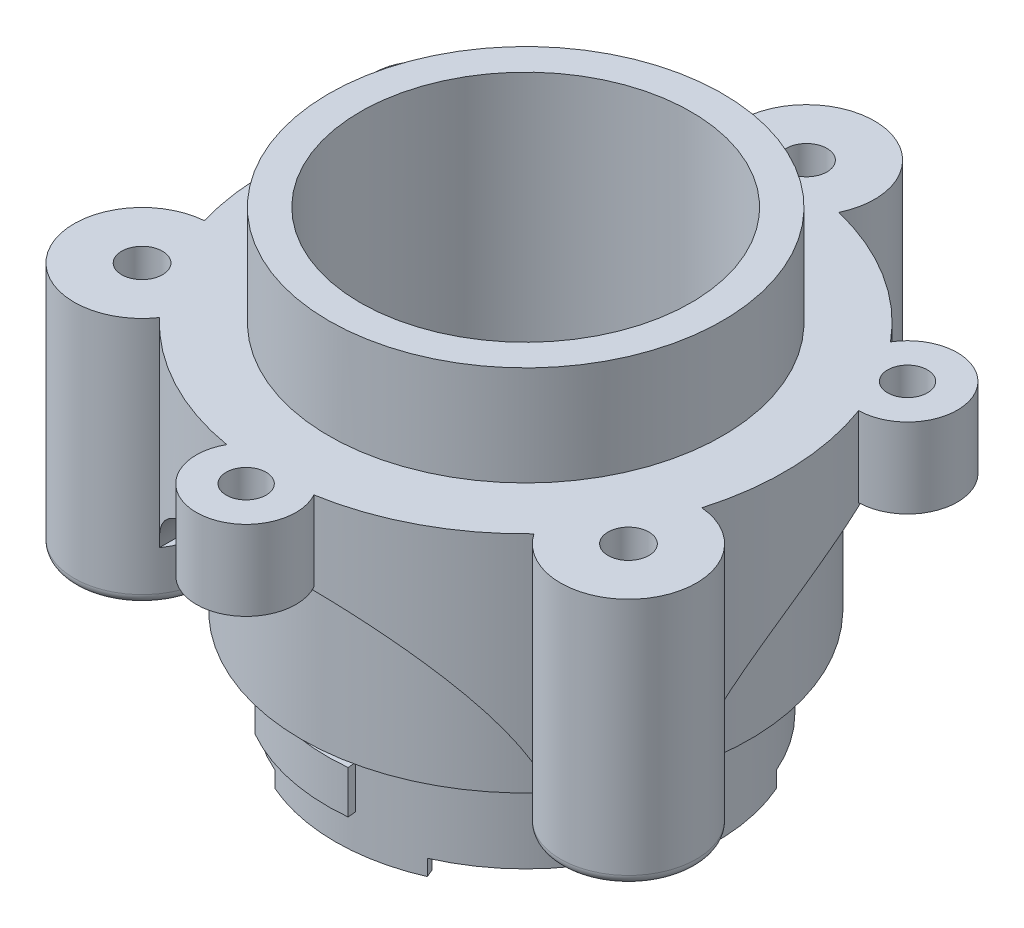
ISO-10303-21;
HEADER;
FILE_DESCRIPTION(('STEP AP214'),'2;1');
FILE_NAME('part.step','',(''),(''),'','','');
FILE_SCHEMA(('AUTOMOTIVE_DESIGN { 1 0 10303 214 1 1 1 1 }'));
ENDSEC;
DATA;
#1=APPLICATION_CONTEXT('core data for automotive mechanical design processes');
#2=APPLICATION_PROTOCOL_DEFINITION('international standard','automotive_design',2000,#1);
#3=PRODUCT_CONTEXT('',#1,'mechanical');
#4=PRODUCT('Part','Part','',(#3));
#5=PRODUCT_RELATED_PRODUCT_CATEGORY('part','',(#4));
#6=PRODUCT_DEFINITION_FORMATION('','',#4);
#7=PRODUCT_DEFINITION_CONTEXT('part definition',#1,'design');
#8=PRODUCT_DEFINITION('design','',#6,#7);
#9=PRODUCT_DEFINITION_SHAPE('','',#8);
#10=(LENGTH_UNIT() NAMED_UNIT(*) SI_UNIT(.MILLI.,.METRE.));
#11=(NAMED_UNIT(*) PLANE_ANGLE_UNIT() SI_UNIT($,.RADIAN.));
#12=(NAMED_UNIT(*) SI_UNIT($,.STERADIAN.) SOLID_ANGLE_UNIT());
#13=UNCERTAINTY_MEASURE_WITH_UNIT(LENGTH_MEASURE(1.E-05),#10,'distance_accuracy_value','');
#14=(GEOMETRIC_REPRESENTATION_CONTEXT(3) GLOBAL_UNCERTAINTY_ASSIGNED_CONTEXT((#13)) GLOBAL_UNIT_ASSIGNED_CONTEXT((#10,
#11,#12)) REPRESENTATION_CONTEXT('',''));
#15=CARTESIAN_POINT('',(0.,0.,0.));
#16=DIRECTION('',(0.,0.,1.));
#17=DIRECTION('',(1.,0.,0.));
#18=AXIS2_PLACEMENT_3D('',#15,#16,#17);
#19=CARTESIAN_POINT('',(9.3396598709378,-1805.60453132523,42.8610883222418));
#20=DIRECTION('',(0.,1.,0.));
#21=DIRECTION('',(0.,0.,1.));
#22=AXIS2_PLACEMENT_3D('',#19,#20,#21);
#23=CYLINDRICAL_SURFACE('',#22,26.0000000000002);
#24=DIRECTION('',(0.,1.,0.));
#25=VECTOR('',#24,1.);
#26=CARTESIAN_POINT('',(34.297038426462,-1798.10453132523,50.150070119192));
#27=LINE('',#26,#25);
#28=CARTESIAN_POINT('',(34.297038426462,-1805.60453132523,50.150070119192));
#29=VERTEX_POINT('',#28);
#30=CARTESIAN_POINT('',(34.297038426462,-1785.60453132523,50.150070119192));
#31=VERTEX_POINT('',#30);
#32=EDGE_CURVE('E974',#29,#31,#27,.T.);
#33=ORIENTED_EDGE('',*,*,#32,.F.);
#34=CARTESIAN_POINT('',(17.7036532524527,-1805.60453132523,18.2431352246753));
#35=CARTESIAN_POINT('',(17.8444145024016,-1805.33382015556,18.2909571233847));
#36=CARTESIAN_POINT('',(17.9908308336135,-1805.06670573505,18.3420512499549));
#37=CARTESIAN_POINT('',(18.2938150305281,-1804.53979234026,18.4510696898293));
#38=CARTESIAN_POINT('',(18.4503809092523,-1804.27999194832,18.5089926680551));
#39=CARTESIAN_POINT('',(18.9333851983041,-1803.51201192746,18.6933614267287));
#40=CARTESIAN_POINT('',(19.2733667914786,-1803.01480554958,18.8304851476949));
#41=CARTESIAN_POINT('',(19.9830676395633,-1802.04829044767,19.1362482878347));
#42=CARTESIAN_POINT('',(20.3529321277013,-1801.57913997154,19.3050476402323));
#43=CARTESIAN_POINT('',(21.1140806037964,-1800.67233830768,19.6761293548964));
#44=CARTESIAN_POINT('',(21.5053687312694,-1800.23469324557,19.8784182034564));
#45=CARTESIAN_POINT('',(22.3026578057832,-1799.39304921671,20.3185116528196));
#46=CARTESIAN_POINT('',(22.7086391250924,-1798.98900758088,20.5562701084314));
#47=CARTESIAN_POINT('',(23.5300720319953,-1798.21608805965,21.0696488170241));
#48=CARTESIAN_POINT('',(23.9455235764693,-1797.84721001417,21.3452688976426));
#49=CARTESIAN_POINT('',(24.779403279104,-1797.14817902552,21.935636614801));
#50=CARTESIAN_POINT('',(25.1978226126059,-1796.81794063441,22.2502946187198));
#51=CARTESIAN_POINT('',(25.8237264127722,-1796.35371860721,22.7527019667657));
#52=CARTESIAN_POINT('',(26.0320585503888,-1796.20417683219,22.9252276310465));
#53=CARTESIAN_POINT('',(26.4475119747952,-1795.91585781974,23.2805847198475));
#54=CARTESIAN_POINT('',(26.6546329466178,-1795.77708327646,23.4634187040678));
#55=CARTESIAN_POINT('',(27.1761516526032,-1795.44023642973,23.9390979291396));
#56=CARTESIAN_POINT('',(27.4891955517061,-1795.24974172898,24.2388684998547));
#57=CARTESIAN_POINT('',(28.1074577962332,-1794.8971787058,24.8621328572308));
#58=CARTESIAN_POINT('',(28.4126776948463,-1794.7351047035,25.1856218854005));
#59=CARTESIAN_POINT('',(29.0120653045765,-1794.44129480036,25.8552604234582));
#60=CARTESIAN_POINT('',(29.3062427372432,-1794.30953166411,26.2013892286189));
#61=CARTESIAN_POINT('',(29.8807332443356,-1794.07785603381,26.9151163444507));
#62=CARTESIAN_POINT('',(30.1610490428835,-1793.97793726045,27.2827104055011));
#63=CARTESIAN_POINT('',(30.6390508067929,-1793.83145322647,27.945983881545));
#64=CARTESIAN_POINT('',(30.8403215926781,-1793.77782851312,28.2375484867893));
#65=CARTESIAN_POINT('',(31.232005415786,-1793.69006490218,28.8307118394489));
#66=CARTESIAN_POINT('',(31.4224196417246,-1793.65592386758,29.1323094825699));
#67=CARTESIAN_POINT('',(31.7911584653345,-1793.6074019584,29.7440140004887));
#68=CARTESIAN_POINT('',(31.9694930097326,-1793.59300463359,30.0541135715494));
#69=CARTESIAN_POINT('',(32.3132883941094,-1793.58397589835,30.6815810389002));
#70=CARTESIAN_POINT('',(32.4787507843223,-1793.58934210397,30.9989480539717));
#71=CARTESIAN_POINT('',(32.8414887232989,-1793.62406517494,31.7311651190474));
#72=CARTESIAN_POINT('',(33.0343265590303,-1793.65984513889,32.1479331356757));
#73=CARTESIAN_POINT('',(33.3963806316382,-1793.76317081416,32.9877188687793));
#74=CARTESIAN_POINT('',(33.5655943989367,-1793.83071984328,33.4107372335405));
#75=CARTESIAN_POINT('',(33.9038883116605,-1794.0090954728,34.3246458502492));
#76=CARTESIAN_POINT('',(34.0689974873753,-1794.1249576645,34.8160306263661));
#77=CARTESIAN_POINT('',(34.367224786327,-1794.39510444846,35.798179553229));
#78=CARTESIAN_POINT('',(34.5003238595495,-1794.54941180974,36.2889431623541));
#79=CARTESIAN_POINT('',(34.7355958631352,-1794.89415582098,37.2664672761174));
#80=CARTESIAN_POINT('',(34.837694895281,-1795.0846770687,37.753215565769));
#81=CARTESIAN_POINT('',(35.0120750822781,-1795.49881397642,38.7177437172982));
#82=CARTESIAN_POINT('',(35.0843597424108,-1795.72242574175,39.1955246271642));
#83=CARTESIAN_POINT('',(35.2006101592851,-1796.1979153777,40.1347125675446));
#84=CARTESIAN_POINT('',(35.2448291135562,-1796.44951573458,40.5962294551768));
#85=CARTESIAN_POINT('',(35.3082561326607,-1796.98027414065,41.5048351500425));
#86=CARTESIAN_POINT('',(35.3274647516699,-1797.25943157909,41.9519242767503));
#87=CARTESIAN_POINT('',(35.3433445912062,-1797.84334352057,42.8295031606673));
#88=CARTESIAN_POINT('',(35.340013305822,-1798.148100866,43.2599910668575));
#89=CARTESIAN_POINT('',(35.3134333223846,-1798.78161572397,44.1023485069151));
#90=CARTESIAN_POINT('',(35.2901808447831,-1799.11037777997,44.5142144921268));
#91=CARTESIAN_POINT('',(35.2171754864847,-1799.89041187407,45.4350787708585));
#92=CARTESIAN_POINT('',(35.1616521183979,-1800.34934414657,45.9371553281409));
#93=CARTESIAN_POINT('',(35.0282942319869,-1801.30367144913,46.902278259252));
#94=CARTESIAN_POINT('',(34.9504592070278,-1801.79906730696,47.3653237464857));
#95=CARTESIAN_POINT('',(34.8224737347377,-1802.56860926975,48.0260255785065));
#96=CARTESIAN_POINT('',(34.7779649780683,-1802.82939338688,48.2405156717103));
#97=CARTESIAN_POINT('',(34.6862023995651,-1803.35992297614,48.6574943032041));
#98=CARTESIAN_POINT('',(34.638948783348,-1803.6296677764,48.8599837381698));
#99=CARTESIAN_POINT('',(34.5427528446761,-1804.1782814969,49.2520849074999));
#100=CARTESIAN_POINT('',(34.4938097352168,-1804.45715466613,49.4416905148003));
#101=CARTESIAN_POINT('',(34.3954620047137,-1805.02401466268,49.8067834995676));
#102=CARTESIAN_POINT('',(34.3460572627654,-1805.31200392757,49.982267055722));
#103=CARTESIAN_POINT('',(34.297038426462,-1805.60453132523,50.150070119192));
#104=B_SPLINE_CURVE_WITH_KNOTS('',3,(#34,#35,#36,#37,#38,#39,#40,#41,#42,#43,#44,#45,#46,#47,
#48,#49,#50,#51,#52,#53,#54,#55,#56,#57,#58,#59,#60,#61,#62,#63,#64,#65,#66,#67,#68,#69,#70,#71,
#72,#73,#74,#75,#76,#77,#78,#79,#80,#81,#82,#83,#84,#85,#86,#87,#88,#89,#90,#91,#92,#93,#94,#95,
#96,#97,#98,#99,#100,#101,#102,#103),.UNSPECIFIED.,.F.,.F.,(4,2,2,2,2,2,2,2,2,2,2,2,2,2,2,2,2,2,
2,2,2,2,2,2,2,2,2,2,2,2,2,2,2,2,4),(0.,0.926325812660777,1.85247082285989,3.70322895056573,
5.56359622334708,7.42432423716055,9.28265226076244,11.1409718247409,12.995100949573,
13.9220321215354,14.8491944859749,16.2680024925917,17.6865266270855,19.1037711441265,
20.5207360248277,21.5949241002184,22.6689943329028,23.7421691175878,24.8152144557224,
26.1951868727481,27.5753034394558,29.1662958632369,30.7582327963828,32.3539353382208,
33.9494502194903,35.5303583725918,37.1112314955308,38.6922803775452,40.2736292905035,
42.3185679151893,44.3635529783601,45.3850177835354,46.4064061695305,47.4282769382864,
48.45042329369),.UNSPECIFIED.);
#105=CARTESIAN_POINT('',(32.6374264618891,-1793.60453132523,31.3192482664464));
#106=VERTEX_POINT('',#105);
#107=EDGE_CURVE('E464',#106,#29,#104,.T.);
#108=ORIENTED_EDGE('',*,*,#107,.F.);
#109=CARTESIAN_POINT('',(9.3396598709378,-1793.60453132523,42.8610883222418));
#110=DIRECTION('',(0.,1.,0.));
#111=DIRECTION('',(0.,0.,1.));
#112=AXIS2_PLACEMENT_3D('',#109,#110,#111);
#113=CIRCLE('',#112,26.0000000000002);
#114=CARTESIAN_POINT('',(33.7227360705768,-1793.60453132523,33.8352589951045));
#115=VERTEX_POINT('',#114);
#116=EDGE_CURVE('E1019',#106,#115,#113,.F.);
#117=ORIENTED_EDGE('',*,*,#116,.T.);
#118=DIRECTION('',(0.,1.,0.));
#119=VECTOR('',#118,1.);
#120=CARTESIAN_POINT('',(33.7227360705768,-1789.60453132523,33.8352589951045));
#121=LINE('',#120,#119);
#122=CARTESIAN_POINT('',(33.7227360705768,-1785.60453132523,33.8352589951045));
#123=VERTEX_POINT('',#122);
#124=EDGE_CURVE('E1014',#123,#115,#121,.F.);
#125=ORIENTED_EDGE('',*,*,#124,.F.);
#126=CARTESIAN_POINT('',(9.3396598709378,-1785.60453132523,42.8610883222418));
#127=DIRECTION('',(0.,1.,0.));
#128=DIRECTION('',(0.,0.,1.));
#129=AXIS2_PLACEMENT_3D('',#126,#127,#128);
#130=CIRCLE('',#129,26.0000000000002);
#131=EDGE_CURVE('E936',#31,#123,#130,.T.);
#132=ORIENTED_EDGE('',*,*,#131,.F.);
#133=EDGE_LOOP('',(#33,#108,#117,#125,#132));
#134=FACE_BOUND('',#133,.T.);
#135=ADVANCED_FACE('F55',(#134),#23,.T.);
#136=DIRECTION('',(0.,1.,0.));
#137=VECTOR('',#136,1.);
#138=CARTESIAN_POINT('',(3.17341399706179,-1798.10453132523,17.6028735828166));
#139=LINE('',#138,#137);
#140=CARTESIAN_POINT('',(3.17341399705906,-1805.60453132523,17.6028735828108));
#141=VERTEX_POINT('',#140);
#142=CARTESIAN_POINT('',(3.17341399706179,-1785.60453132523,17.6028735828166));
#143=VERTEX_POINT('',#142);
#144=EDGE_CURVE('E609',#141,#143,#139,.T.);
#145=ORIENTED_EDGE('',*,*,#144,.F.);
#146=CARTESIAN_POINT('',(-12.3047501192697,-1793.60453132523,28.4555506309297));
#147=CARTESIAN_POINT('',(-12.1773592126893,-1793.61429748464,28.2641390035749));
#148=CARTESIAN_POINT('',(-12.0475349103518,-1793.62812728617,28.074589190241));
#149=CARTESIAN_POINT('',(-11.7832957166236,-1793.66382379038,27.6995137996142));
#150=CARTESIAN_POINT('',(-11.6488812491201,-1793.68568975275,27.5139878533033));
#151=CARTESIAN_POINT('',(-11.2392421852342,-1793.7631891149,26.9639936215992));
#152=CARTESIAN_POINT('',(-10.9575177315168,-1793.83073209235,26.605952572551));
#153=CARTESIAN_POINT('',(-10.335190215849,-1794.00910402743,25.8560105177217));
#154=CARTESIAN_POINT('',(-9.99217551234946,-1794.12497619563,25.4673155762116));
#155=CARTESIAN_POINT('',(-9.29067733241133,-1794.39514809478,24.717930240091));
#156=CARTESIAN_POINT('',(-8.93218497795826,-1794.5494701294,24.3572562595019));
#157=CARTESIAN_POINT('',(-8.20325774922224,-1794.89422338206,23.6647507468));
#158=CARTESIAN_POINT('',(-7.83279807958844,-1795.08473417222,23.3329851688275));
#159=CARTESIAN_POINT('',(-7.08473602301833,-1795.49884573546,22.6997544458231));
#160=CARTESIAN_POINT('',(-6.70713446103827,-1795.72244270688,22.3982858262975));
#161=CARTESIAN_POINT('',(-5.95195392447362,-1796.19789771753,21.8280573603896));
#162=CARTESIAN_POINT('',(-5.5744064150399,-1796.44947817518,21.5590232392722));
#163=CARTESIAN_POINT('',(-4.81930096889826,-1796.98019266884,21.0498249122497));
#164=CARTESIAN_POINT('',(-4.44174303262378,-1797.25932607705,20.8096600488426));
#165=CARTESIAN_POINT('',(-3.68967657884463,-1797.8432301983,20.3571100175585));
#166=CARTESIAN_POINT('',(-3.31516888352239,-1798.14800758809,20.1447321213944));
#167=CARTESIAN_POINT('',(-2.57231934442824,-1798.78156632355,19.7465385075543));
#168=CARTESIAN_POINT('',(-2.20397868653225,-1799.11035222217,19.5607278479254));
#169=CARTESIAN_POINT('',(-1.36989469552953,-1799.89046997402,19.163477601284));
#170=CARTESIAN_POINT('',(-0.907261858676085,-1800.34946538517,18.9604999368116));
#171=CARTESIAN_POINT('',(-0.00464876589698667,-1801.30392837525,18.593391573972));
#172=CARTESIAN_POINT('',(0.435330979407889,-1801.7993967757,18.4292617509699));
#173=CARTESIAN_POINT('',(1.07152390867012,-1802.56898683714,18.209753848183));
#174=CARTESIAN_POINT('',(1.27950080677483,-1802.82974069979,18.1410675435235));
#175=CARTESIAN_POINT('',(1.68643533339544,-1803.36020742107,18.0120706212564));
#176=CARTESIAN_POINT('',(1.88539363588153,-1803.62991960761,17.9517593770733));
#177=CARTESIAN_POINT('',(2.27300441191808,-1804.17846558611,17.8390360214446));
#178=CARTESIAN_POINT('',(2.46165197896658,-1804.45730362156,17.7866276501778));
#179=CARTESIAN_POINT('',(2.82695408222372,-1805.0240909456,17.6892676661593));
#180=CARTESIAN_POINT('',(3.00360537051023,-1805.31204267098,17.6443180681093));
#181=CARTESIAN_POINT('',(3.17341399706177,-1805.60453132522,17.6028735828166));
#182=B_SPLINE_CURVE_WITH_KNOTS('',3,(#146,#147,#148,#149,#150,#151,#152,#153,#154,#155,#156,
#157,#158,#159,#160,#161,#162,#163,#164,#165,#166,#167,#168,#169,#170,#171,#172,#173,#174,#175,
#176,#177,#178,#179,#180,#181),.UNSPECIFIED.,.F.,.F.,(4,2,2,2,2,2,2,2,2,2,2,2,2,2,2,2,2,4),(0.,
0.690293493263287,1.38052341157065,2.76042098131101,4.3515386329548,5.94358140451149,
7.53916616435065,9.13456773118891,10.715357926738,12.2961121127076,13.8772791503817,
15.4587468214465,17.5039554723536,19.5492102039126,20.5705403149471,21.5917939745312,
22.6135294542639,23.6355404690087),.UNSPECIFIED.);
#183=CARTESIAN_POINT('',(-12.3047501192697,-1793.60453132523,28.4555506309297));
#184=VERTEX_POINT('',#183);
#185=EDGE_CURVE('E1902',#184,#141,#182,.T.);
#186=ORIENTED_EDGE('',*,*,#185,.F.);
#187=CARTESIAN_POINT('',(9.3396598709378,-1793.60453132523,42.8610883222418));
#188=DIRECTION('',(0.,1.,0.));
#189=DIRECTION('',(0.,0.,1.));
#190=AXIS2_PLACEMENT_3D('',#187,#188,#189);
#191=CIRCLE('',#190,26.0000000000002);
#192=CARTESIAN_POINT('',(-10.6684757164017,-1793.60453132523,26.2576395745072));
#193=VERTEX_POINT('',#192);
#194=EDGE_CURVE('E1022',#184,#193,#191,.F.);
#195=ORIENTED_EDGE('',*,*,#194,.T.);
#196=DIRECTION('',(0.,1.,0.));
#197=VECTOR('',#196,1.);
#198=CARTESIAN_POINT('',(-10.6684757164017,-1789.60453132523,26.2576395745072));
#199=LINE('',#198,#197);
#200=CARTESIAN_POINT('',(-10.6684757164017,-1785.60453132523,26.2576395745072));
#201=VERTEX_POINT('',#200);
#202=EDGE_CURVE('E1027',#201,#193,#199,.F.);
#203=ORIENTED_EDGE('',*,*,#202,.F.);
#204=EDGE_CURVE('E938',#143,#201,#130,.T.);
#205=ORIENTED_EDGE('',*,*,#204,.F.);
#206=EDGE_LOOP('',(#145,#186,#195,#203,#205));
#207=FACE_BOUND('',#206,.T.);
#208=ADVANCED_FACE('F497',(#207),#23,.T.);
#209=DIRECTION('',(0.,1.,0.));
#210=VECTOR('',#209,1.);
#211=CARTESIAN_POINT('',(-9.45147281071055,-1798.10453132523,60.8303212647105));
#212=LINE('',#211,#210);
#213=CARTESIAN_POINT('',(-9.45147281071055,-1805.60453132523,60.8303212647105));
#214=VERTEX_POINT('',#213);
#215=CARTESIAN_POINT('',(-9.45147281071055,-1785.60453132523,60.8303212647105));
#216=VERTEX_POINT('',#215);
#217=EDGE_CURVE('E560',#214,#216,#212,.T.);
#218=ORIENTED_EDGE('',*,*,#217,.F.);
#219=CARTESIAN_POINT('',(7.6863032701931,-1793.60453132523,68.8084660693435));
#220=CARTESIAN_POINT('',(7.4568404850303,-1793.61429748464,68.7938481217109));
#221=CARTESIAN_POINT('',(7.22777338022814,-1793.62812728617,68.7761918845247));
#222=CARTESIAN_POINT('',(6.77082896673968,-1793.66382379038,68.7348917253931));
#223=CARTESIAN_POINT('',(6.54295155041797,-1793.68568975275,68.7112483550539));
#224=CARTESIAN_POINT('',(5.86182304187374,-1793.76318911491,68.6314876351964));
#225=CARTESIAN_POINT('',(5.41088817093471,-1793.83073209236,68.5665276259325));
#226=CARTESIAN_POINT('',(4.4502555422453,-1794.00910402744,68.402547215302));
#227=CARTESIAN_POINT('',(3.94212849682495,-1794.12497619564,68.2998352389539));
#228=CARTESIAN_POINT('',(2.94239266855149,-1794.39514809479,68.0670126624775));
#229=CARTESIAN_POINT('',(2.45079366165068,-1794.54947012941,67.9368861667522));
#230=CARTESIAN_POINT('',(1.48660268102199,-1794.89422338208,67.6518694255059));
#231=CARTESIAN_POINT('',(1.01405542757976,-1795.08473417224,67.4969247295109));
#232=CARTESIAN_POINT('',(0.0916305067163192,-1795.49884573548,67.1656993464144));
#233=CARTESIAN_POINT('',(-0.358249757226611,-1795.7224427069,66.9894211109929));
#234=CARTESIAN_POINT('',(-1.22967236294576,-1796.19789771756,66.6205298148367));
#235=CARTESIAN_POINT('',(-1.65143650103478,-1796.44947817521,66.4280811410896));
#236=CARTESIAN_POINT('',(-2.46996791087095,-1796.98019266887,66.0287398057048));
#237=CARTESIAN_POINT('',(-2.86673575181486,-1797.25932607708,65.8218474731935));
#238=CARTESIAN_POINT('',(-3.63468880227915,-1797.84323019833,65.3968138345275));
#239=CARTESIAN_POINT('',(-4.00586730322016,-1798.14800758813,65.1786696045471));
#240=CARTESIAN_POINT('',(-4.72213785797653,-1798.78156632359,64.734439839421));
#241=CARTESIAN_POINT('',(-5.0672249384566,-1799.11035222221,64.5083528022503));
#242=CARTESIAN_POINT('',(-5.82829573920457,-1799.89046997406,63.984640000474));
#243=CARTESIAN_POINT('',(-6.23539597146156,-1800.34946538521,63.6854770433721));
#244=CARTESIAN_POINT('',(-7.004627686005,-1801.30392837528,63.0873453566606));
#245=CARTESIAN_POINT('',(-7.36675815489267,-1801.79939677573,62.788376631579));
#246=CARTESIAN_POINT('',(-7.87495403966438,-1802.56898683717,62.3471713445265));
#247=CARTESIAN_POINT('',(-8.03842657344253,-1802.82974069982,62.2014012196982));
#248=CARTESIAN_POINT('',(-8.35360844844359,-1803.36020742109,61.9134840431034));
#249=CARTESIAN_POINT('',(-8.50531866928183,-1803.62991960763,61.7713367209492));
#250=CARTESIAN_POINT('',(-8.79674534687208,-1804.17846558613,61.4920176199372));
#251=CARTESIAN_POINT('',(-8.93645611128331,-1804.45730362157,61.3548482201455));
#252=CARTESIAN_POINT('',(-9.20342338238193,-1805.02409094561,61.08716731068));
#253=CARTESIAN_POINT('',(-9.33067652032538,-1805.31204267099,60.9566576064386));
#254=CARTESIAN_POINT('',(-9.45147281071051,-1805.60453132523,60.8303212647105));
#255=B_SPLINE_CURVE_WITH_KNOTS('',3,(#219,#220,#221,#222,#223,#224,#225,#226,#227,#228,#229,
#230,#231,#232,#233,#234,#235,#236,#237,#238,#239,#240,#241,#242,#243,#244,#245,#246,#247,#248,
#249,#250,#251,#252,#253,#254),.UNSPECIFIED.,.F.,.F.,(4,2,2,2,2,2,2,2,2,2,2,2,2,2,2,2,2,4),(0.,
0.690293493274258,1.38052341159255,2.76042098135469,4.35153863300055,5.94358140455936,
7.53916616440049,9.13456773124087,10.7153579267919,12.2961121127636,13.8772791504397,
15.4587468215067,17.503955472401,19.5492102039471,20.5705403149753,21.5917939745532,
22.6135294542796,23.6355404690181),.UNSPECIFIED.);
#256=CARTESIAN_POINT('',(7.6863032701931,-1793.60453132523,68.8084660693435));
#257=VERTEX_POINT('',#256);
#258=EDGE_CURVE('E561',#257,#214,#255,.T.);
#259=ORIENTED_EDGE('',*,*,#258,.F.);
#260=CARTESIAN_POINT('',(9.3396598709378,-1793.60453132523,42.8610883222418));
#261=DIRECTION('',(0.,1.,0.));
#262=DIRECTION('',(0.,0.,1.));
#263=AXIS2_PLACEMENT_3D('',#260,#261,#262);
#264=CIRCLE('',#263,26.0000000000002);
#265=CARTESIAN_POINT('',(4.96471925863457,-1793.60453132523,68.4903663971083));
#266=VERTEX_POINT('',#265);
#267=EDGE_CURVE('E852',#257,#266,#264,.F.);
#268=ORIENTED_EDGE('',*,*,#267,.T.);
#269=DIRECTION('',(0.,1.,0.));
#270=VECTOR('',#269,1.);
#271=CARTESIAN_POINT('',(4.96471925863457,-1789.60453132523,68.4903663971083));
#272=LINE('',#271,#270);
#273=CARTESIAN_POINT('',(4.96471925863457,-1785.60453132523,68.4903663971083));
#274=VERTEX_POINT('',#273);
#275=EDGE_CURVE('E851',#274,#266,#272,.F.);
#276=ORIENTED_EDGE('',*,*,#275,.F.);
#277=EDGE_CURVE('E564',#216,#274,#130,.T.);
#278=ORIENTED_EDGE('',*,*,#277,.F.);
#279=EDGE_LOOP('',(#218,#259,#268,#276,#278));
#280=FACE_BOUND('',#279,.T.);
#281=ADVANCED_FACE('F504',(#280),#23,.T.);
#282=CARTESIAN_POINT('',(19.9283084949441,-1782.60453132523,30.7119643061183));
#283=DIRECTION('',(0.,-1.,0.));
#284=DIRECTION('',(0.,0.,-1.));
#285=AXIS2_PLACEMENT_3D('',#282,#283,#284);
#286=CYLINDRICAL_SURFACE('',#285,1.5);
#287=DIRECTION('',(0.,-1.,0.));
#288=VECTOR('',#287,1.);
#289=CARTESIAN_POINT('',(21.2905276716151,-1782.60453132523,31.3399443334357));
#290=LINE('',#289,#288);
#291=CARTESIAN_POINT('',(21.2905276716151,-1784.52614433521,31.3399443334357));
#292=VERTEX_POINT('',#291);
#293=CARTESIAN_POINT('',(21.2905276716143,-1819.60453132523,31.3399443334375));
#294=VERTEX_POINT('',#293);
#295=EDGE_CURVE('E643',#292,#294,#290,.T.);
#296=ORIENTED_EDGE('',*,*,#295,.F.);
#297=CARTESIAN_POINT('',(19.928308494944,-1784.10453132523,30.7119643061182));
#298=DIRECTION('',(-0.464592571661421,-0.707106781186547,0.533060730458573));
#299=DIRECTION('',(0.464592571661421,-0.707106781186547,-0.533060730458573));
#300=AXIS2_PLACEMENT_3D('',#297,#298,#299);
#301=ELLIPSE('',#300,2.12132034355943,1.49999999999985);
#302=CARTESIAN_POINT('',(19.1201167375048,-1784.52614433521,29.4483084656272));
#303=VERTEX_POINT('',#302);
#304=EDGE_CURVE('E1112',#292,#303,#301,.F.);
#305=ORIENTED_EDGE('',*,*,#304,.T.);
#306=DIRECTION('',(0.,-1.,0.));
#307=VECTOR('',#306,1.);
#308=CARTESIAN_POINT('',(19.1201167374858,-1782.60453132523,29.4483084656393));
#309=LINE('',#308,#307);
#310=CARTESIAN_POINT('',(19.1201167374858,-1819.60453132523,29.4483084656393));
#311=VERTEX_POINT('',#310);
#312=EDGE_CURVE('E639',#303,#311,#309,.T.);
#313=ORIENTED_EDGE('',*,*,#312,.T.);
#314=CARTESIAN_POINT('',(19.9283084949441,-1819.60453132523,30.7119643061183));
#315=DIRECTION('',(0.,1.,0.));
#316=DIRECTION('',(0.,0.,1.));
#317=AXIS2_PLACEMENT_3D('',#314,#315,#316);
#318=CIRCLE('',#317,1.5);
#319=EDGE_CURVE('E629',#294,#311,#318,.T.);
#320=ORIENTED_EDGE('',*,*,#319,.F.);
#321=EDGE_LOOP('',(#296,#305,#313,#320));
#322=FACE_BOUND('',#321,.T.);
#323=ADVANCED_FACE('F547',(#322),#286,.F.);
#324=CARTESIAN_POINT('',(19.1201167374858,-1782.60453132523,29.4483084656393));
#325=VERTEX_POINT('',#324);
#326=CARTESIAN_POINT('',(19.1201167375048,-1783.68291831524,29.4483084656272));
#327=VERTEX_POINT('',#326);
#328=EDGE_CURVE('E640',#325,#327,#309,.T.);
#329=ORIENTED_EDGE('',*,*,#328,.T.);
#330=CARTESIAN_POINT('',(19.928308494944,-1784.10453132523,30.7119643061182));
#331=DIRECTION('',(0.464592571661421,-0.707106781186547,-0.533060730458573));
#332=DIRECTION('',(-0.464592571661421,-0.707106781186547,0.533060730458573));
#333=AXIS2_PLACEMENT_3D('',#330,#331,#332);
#334=ELLIPSE('',#333,2.12132034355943,1.49999999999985);
#335=CARTESIAN_POINT('',(20.9138581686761,-1782.60453132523,29.5811717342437));
#336=VERTEX_POINT('',#335);
#337=EDGE_CURVE('E1111',#327,#336,#334,.T.);
#338=ORIENTED_EDGE('',*,*,#337,.T.);
#339=CARTESIAN_POINT('',(19.9283084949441,-1782.60453132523,30.7119643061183));
#340=DIRECTION('',(0.,1.,0.));
#341=DIRECTION('',(0.,0.,1.));
#342=AXIS2_PLACEMENT_3D('',#339,#340,#341);
#343=CIRCLE('',#342,1.5);
#344=EDGE_CURVE('E636',#325,#336,#343,.F.);
#345=ORIENTED_EDGE('',*,*,#344,.F.);
#346=EDGE_LOOP('',(#329,#338,#345));
#347=FACE_BOUND('',#346,.T.);
#348=ADVANCED_FACE('F540',(#347),#286,.F.);
#349=CARTESIAN_POINT('',(15.5059057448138,-1805.60453132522,17.6028735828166));
#350=CARTESIAN_POINT('',(15.6672457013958,-1805.32662136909,17.6422525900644));
#351=CARTESIAN_POINT('',(15.8347699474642,-1805.05280632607,17.6847958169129));
#352=CARTESIAN_POINT('',(16.1807290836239,-1804.5134043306,17.7765976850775));
#353=CARTESIAN_POINT('',(16.3591612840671,-1804.24781537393,17.8258546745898));
#354=CARTESIAN_POINT('',(16.725431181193,-1803.72494985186,17.9314531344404));
#355=CARTESIAN_POINT('',(16.9132622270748,-1803.46766761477,17.9877896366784));
#356=CARTESIAN_POINT('',(17.2972417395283,-1802.96119052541,18.1079594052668));
#357=CARTESIAN_POINT('',(17.4933907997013,-1802.71199625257,18.1717932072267));
#358=CARTESIAN_POINT('',(18.0952001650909,-1801.97341279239,18.3759802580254));
#359=CARTESIAN_POINT('',(18.5119407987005,-1801.49624194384,18.528379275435));
#360=CARTESIAN_POINT('',(19.3671719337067,-1800.5749320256,18.868152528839));
#361=CARTESIAN_POINT('',(19.8056672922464,-1800.13080038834,19.0555346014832));
#362=CARTESIAN_POINT('',(20.6973653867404,-1799.27749562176,19.467854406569));
#363=CARTESIAN_POINT('',(21.1505441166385,-1798.86826904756,19.6927331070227));
#364=CARTESIAN_POINT('',(22.0663953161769,-1798.08621399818,20.1829036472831));
#365=CARTESIAN_POINT('',(22.5290676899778,-1797.71338515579,20.4481950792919));
#366=CARTESIAN_POINT('',(23.4569683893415,-1797.00814369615,21.0208094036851));
#367=CARTESIAN_POINT('',(23.9221859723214,-1796.67562114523,21.3280128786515));
#368=CARTESIAN_POINT('',(24.6180423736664,-1796.20943020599,21.8217916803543));
#369=CARTESIAN_POINT('',(24.8496468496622,-1796.05947657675,21.9918645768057));
#370=CARTESIAN_POINT('',(25.3115433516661,-1795.7708948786,22.3432146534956));
#371=CARTESIAN_POINT('',(25.5418350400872,-1795.6322696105,22.5244945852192));
#372=CARTESIAN_POINT('',(26.1096088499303,-1795.3036706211,22.9874981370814));
#373=CARTESIAN_POINT('',(26.4458073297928,-1795.12075605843,23.2758770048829));
#374=CARTESIAN_POINT('',(27.1104472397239,-1794.78308926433,23.876889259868));
#375=CARTESIAN_POINT('',(27.4388904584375,-1794.62833048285,24.1895169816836));
#376=CARTESIAN_POINT('',(28.0850060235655,-1794.34896859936,24.8382845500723));
#377=CARTESIAN_POINT('',(28.4026826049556,-1794.22435351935,25.1744149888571));
#378=CARTESIAN_POINT('',(29.02433340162,-1794.00707518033,25.8690068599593));
#379=CARTESIAN_POINT('',(29.3283072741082,-1793.91441272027,26.2274688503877));
#380=CARTESIAN_POINT('',(29.9210629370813,-1793.76223914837,26.9667043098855));
#381=CARTESIAN_POINT('',(30.2097567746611,-1793.70290429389,27.3475848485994));
#382=CARTESIAN_POINT('',(30.7673339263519,-1793.61931851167,28.1273014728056));
#383=CARTESIAN_POINT('',(31.0362172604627,-1793.59506754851,28.5261375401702));
#384=CARTESIAN_POINT('',(31.5516149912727,-1793.58226539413,29.3384992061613));
#385=CARTESIAN_POINT('',(31.7981321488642,-1793.59370979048,29.7520229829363));
#386=CARTESIAN_POINT('',(32.2668249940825,-1793.65227561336,30.5901631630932));
#387=CARTESIAN_POINT('',(32.4890020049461,-1793.69939509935,31.0147789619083));
#388=CARTESIAN_POINT('',(32.8902696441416,-1793.8232883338,31.8356675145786));
#389=CARTESIAN_POINT('',(33.071405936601,-1793.89727573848,32.2313670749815));
#390=CARTESIAN_POINT('',(33.4115306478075,-1794.07379201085,33.0258586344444));
#391=CARTESIAN_POINT('',(33.5705205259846,-1794.17631899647,33.4246504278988));
#392=CARTESIAN_POINT('',(33.8662824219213,-1794.40871398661,34.2224651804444));
#393=CARTESIAN_POINT('',(34.0030547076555,-1794.53858166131,34.6214881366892));
#394=CARTESIAN_POINT('',(34.2547441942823,-1794.82426012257,35.4171173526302));
#395=CARTESIAN_POINT('',(34.3696602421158,-1794.98007227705,35.8137234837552));
#396=CARTESIAN_POINT('',(34.5840652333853,-1795.32535056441,36.6237014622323));
#397=CARTESIAN_POINT('',(34.6823633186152,-1795.51619323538,37.0368007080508));
#398=CARTESIAN_POINT('',(34.8566123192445,-1795.92329358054,37.8550757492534));
#399=CARTESIAN_POINT('',(34.9325625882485,-1796.13955198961,38.2602513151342));
#400=CARTESIAN_POINT('',(35.0636187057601,-1796.59595331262,39.0607515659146));
#401=CARTESIAN_POINT('',(35.1187094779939,-1796.83611334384,39.4560689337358));
#402=CARTESIAN_POINT('',(35.2096295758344,-1797.33866103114,40.2346233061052));
#403=CARTESIAN_POINT('',(35.2454564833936,-1797.60105147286,40.6178587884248));
#404=CARTESIAN_POINT('',(35.304333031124,-1798.19401526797,41.4357170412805));
#405=CARTESIAN_POINT('',(35.3240904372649,-1798.52852261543,41.8677292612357));
#406=CARTESIAN_POINT('',(35.3426340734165,-1799.22449034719,42.7100062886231));
#407=CARTESIAN_POINT('',(35.3414166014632,-1799.5859554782,43.1202672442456));
#408=CARTESIAN_POINT('',(35.3212944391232,-1800.33418017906,43.9160742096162));
#409=CARTESIAN_POINT('',(35.3024004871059,-1800.72092425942,44.301635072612));
#410=CARTESIAN_POINT('',(35.2504216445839,-1801.51885723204,45.0454208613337));
#411=CARTESIAN_POINT('',(35.217340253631,-1801.93004007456,45.4036525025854));
#412=CARTESIAN_POINT('',(35.1560302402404,-1802.6073351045,45.952704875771));
#413=CARTESIAN_POINT('',(35.1311302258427,-1802.86588444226,46.1533012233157));
#414=CARTESIAN_POINT('',(35.0784409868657,-1803.39141964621,46.5426250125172));
#415=CARTESIAN_POINT('',(35.0506524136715,-1803.65840360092,46.7313551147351));
#416=CARTESIAN_POINT('',(34.9931284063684,-1804.2004328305,47.0958902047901));
#417=CARTESIAN_POINT('',(34.9633951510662,-1804.4754688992,47.2717092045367));
#418=CARTESIAN_POINT('',(34.9029209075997,-1805.03383775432,47.6096927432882));
#419=CARTESIAN_POINT('',(34.8721795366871,-1805.31717368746,47.7718520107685));
#420=CARTESIAN_POINT('',(34.8414293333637,-1805.60453132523,47.9266341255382));
#421=B_SPLINE_CURVE_WITH_KNOTS('',3,(#349,#350,#351,#352,#353,#354,#355,#356,#357,#358,#359,
#360,#361,#362,#363,#364,#365,#366,#367,#368,#369,#370,#371,#372,#373,#374,#375,#376,#377,#378,
#379,#380,#381,#382,#383,#384,#385,#386,#387,#388,#389,#390,#391,#392,#393,#394,#395,#396,#397,
#398,#399,#400,#401,#402,#403,#404,#405,#406,#407,#408,#409,#410,#411,#412,#413,#414,#415,#416,
#417,#418,#419,#420),.UNSPECIFIED.,.F.,.F.,(4,2,2,2,2,2,2,2,2,2,2,2,2,2,2,2,2,2,2,2,2,2,2,2,2,2,
2,2,2,2,2,2,2,2,2,4),(0.,0.97108381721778,1.94192914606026,2.91209694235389,3.88233408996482,
5.83476248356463,7.78762877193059,9.73744914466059,11.6872498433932,13.6316068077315,
14.6036223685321,15.5758775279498,17.0120317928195,18.4478515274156,19.883099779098,
21.3183839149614,22.7611889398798,24.203992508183,25.6466177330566,27.0891644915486,
28.411963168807,29.7346746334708,31.0573701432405,32.3801354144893,33.7754049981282,
35.170714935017,36.56703142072,37.9635231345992,39.6021348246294,41.2410357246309,
42.8789416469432,44.5164437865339,45.5007139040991,46.4847625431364,47.467726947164,
48.4510689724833),.UNSPECIFIED.);
#422=CARTESIAN_POINT('',(15.5059057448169,-1805.60453132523,17.60287358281));
#423=VERTEX_POINT('',#422);
#424=CARTESIAN_POINT('',(30.9840698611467,-1793.60453132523,28.4555506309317));
#425=VERTEX_POINT('',#424);
#426=EDGE_CURVE('E435',#423,#425,#421,.T.);
#427=ORIENTED_EDGE('',*,*,#426,.F.);
#428=DIRECTION('',(0.,1.,0.));
#429=VECTOR('',#428,1.);
#430=CARTESIAN_POINT('',(15.5059057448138,-1798.10453132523,17.6028735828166));
#431=LINE('',#430,#429);
#432=CARTESIAN_POINT('',(15.5059057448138,-1785.60453132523,17.6028735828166));
#433=VERTEX_POINT('',#432);
#434=EDGE_CURVE('E614',#433,#423,#431,.F.);
#435=ORIENTED_EDGE('',*,*,#434,.F.);
#436=CARTESIAN_POINT('',(29.3477954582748,-1785.60453132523,26.2576395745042));
#437=VERTEX_POINT('',#436);
#438=EDGE_CURVE('E1006',#437,#433,#130,.T.);
#439=ORIENTED_EDGE('',*,*,#438,.F.);
#440=DIRECTION('',(0.,1.,0.));
#441=VECTOR('',#440,1.);
#442=CARTESIAN_POINT('',(29.3477954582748,-1789.60453132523,26.2576395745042));
#443=LINE('',#442,#441);
#444=CARTESIAN_POINT('',(29.3477954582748,-1793.60453132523,26.2576395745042));
#445=VERTEX_POINT('',#444);
#446=EDGE_CURVE('E1017',#445,#437,#443,.T.);
#447=ORIENTED_EDGE('',*,*,#446,.F.);
#448=EDGE_CURVE('E1020',#445,#425,#113,.F.);
#449=ORIENTED_EDGE('',*,*,#448,.T.);
#450=EDGE_LOOP('',(#427,#435,#439,#447,#449));
#451=FACE_BOUND('',#450,.T.);
#452=ADVANCED_FACE('F529',(#451),#23,.T.);
#453=CARTESIAN_POINT('',(9.3396598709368,-1785.60453132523,42.8610883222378));
#454=DIRECTION('',(0.,-1.,0.));
#455=DIRECTION('',(0.,0.,-1.));
#456=AXIS2_PLACEMENT_3D('',#453,#454,#455);
#457=CYLINDRICAL_SURFACE('',#456,22.5);
#458=CARTESIAN_POINT('',(9.3396598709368,-1810.60453132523,42.8610883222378));
#459=DIRECTION('',(0.,1.,0.));
#460=DIRECTION('',(1.,0.,0.));
#461=AXIS2_PLACEMENT_3D('',#458,#459,#460);
#462=CIRCLE('',#461,22.5);
#463=CARTESIAN_POINT('',(-9.54682556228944,-1810.60453132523,55.0901793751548));
#464=VERTEX_POINT('',#463);
#465=CARTESIAN_POINT('',(28.2261453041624,-1810.60453132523,55.0901793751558));
#466=VERTEX_POINT('',#465);
#467=EDGE_CURVE('E928',#464,#466,#462,.T.);
#468=ORIENTED_EDGE('',*,*,#467,.T.);
#469=CARTESIAN_POINT('',(28.2261453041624,-1810.60453132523,55.0901793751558));
#470=CARTESIAN_POINT('',(28.1842303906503,-1810.60451145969,55.1549132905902));
#471=CARTESIAN_POINT('',(28.1419720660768,-1810.60398690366,55.2194461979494));
#472=CARTESIAN_POINT('',(28.0567533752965,-1810.60116212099,55.3481363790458));
#473=CARTESIAN_POINT('',(28.0137920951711,-1810.59885936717,55.4122929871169));
#474=CARTESIAN_POINT('',(27.9263170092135,-1810.59162866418,55.5414824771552));
#475=CARTESIAN_POINT('',(27.8817898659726,-1810.58664389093,55.6065034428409));
#476=CARTESIAN_POINT('',(27.7922499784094,-1810.57302825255,55.7357958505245));
#477=CARTESIAN_POINT('',(27.7472375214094,-1810.56439944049,55.8000676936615));
#478=CARTESIAN_POINT('',(27.6677691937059,-1810.54498354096,55.9122927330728));
#479=CARTESIAN_POINT('',(27.633372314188,-1810.53521137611,55.9604605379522));
#480=CARTESIAN_POINT('',(27.5645896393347,-1810.51229563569,56.0559886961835));
#481=CARTESIAN_POINT('',(27.5302038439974,-1810.49915314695,56.1033493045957));
#482=CARTESIAN_POINT('',(27.4619079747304,-1810.46891043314,56.1966589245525));
#483=CARTESIAN_POINT('',(27.4279962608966,-1810.45183656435,56.2426151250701));
#484=CARTESIAN_POINT('',(27.3608287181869,-1810.4129275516,56.3329343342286));
#485=CARTESIAN_POINT('',(27.3275723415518,-1810.39109658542,56.3772987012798));
#486=CARTESIAN_POINT('',(27.2622036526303,-1810.34175014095,56.4638589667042));
#487=CARTESIAN_POINT('',(27.2300935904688,-1810.31422413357,56.506050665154));
#488=CARTESIAN_POINT('',(27.1679560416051,-1810.25254997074,56.5871386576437));
#489=CARTESIAN_POINT('',(27.1379289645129,-1810.21840051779,56.6260343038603));
#490=CARTESIAN_POINT('',(27.085946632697,-1810.1488266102,56.6929646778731));
#491=CARTESIAN_POINT('',(27.0634726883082,-1810.11451168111,56.7217371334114));
#492=CARTESIAN_POINT('',(27.0221018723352,-1810.04042706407,56.774476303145));
#493=CARTESIAN_POINT('',(27.0031994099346,-1810.00066607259,56.7984505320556));
#494=CARTESIAN_POINT('',(26.9741573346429,-1809.92580805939,56.8351685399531));
#495=CARTESIAN_POINT('',(26.9630021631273,-1809.8917531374,56.849227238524));
#496=CARTESIAN_POINT('',(26.9443219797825,-1809.82117018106,56.8727298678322));
#497=CARTESIAN_POINT('',(26.9367893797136,-1809.78464750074,56.8821834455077));
#498=CARTESIAN_POINT('',(26.9279326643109,-1809.72398971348,56.8932902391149));
#499=CARTESIAN_POINT('',(26.9253406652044,-1809.70031849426,56.8965378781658));
#500=CARTESIAN_POINT('',(26.9218621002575,-1809.65261518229,56.9008948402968));
#501=CARTESIAN_POINT('',(26.9209785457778,-1809.62858252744,56.9020003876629));
#502=CARTESIAN_POINT('',(26.9209862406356,-1809.60453132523,56.901991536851));
#503=B_SPLINE_CURVE_WITH_KNOTS('',3,(#469,#470,#471,#472,#473,#474,#475,#476,#477,#478,#479,
#480,#481,#482,#483,#484,#485,#486,#487,#488,#489,#490,#491,#492,#493,#494,#495,#496,#497,#498,
#499,#500,#501,#502),.UNSPECIFIED.,.F.,.F.,(4,2,2,2,2,2,2,2,2,2,2,2,2,2,2,2,4),(0.,
0.231382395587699,0.463094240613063,0.699920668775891,0.936613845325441,1.11650377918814,
1.29633577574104,1.47499556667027,1.65349908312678,1.83233561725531,2.01120721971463,
2.16100382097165,2.31056395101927,2.42559981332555,2.54039364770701,2.61234553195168,
2.68442412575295),.UNSPECIFIED.);
#504=CARTESIAN_POINT('',(26.9209862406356,-1809.60453132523,56.901991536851));
#505=VERTEX_POINT('',#504);
#506=EDGE_CURVE('E12',#466,#505,#503,.T.);
#507=ORIENTED_EDGE('',*,*,#506,.T.);
#508=DIRECTION('',(0.,1.,0.));
#509=VECTOR('',#508,1.);
#510=CARTESIAN_POINT('',(26.9209862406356,-1798.10453132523,56.901991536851));
#511=LINE('',#510,#509);
#512=CARTESIAN_POINT('',(26.9209862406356,-1805.60453132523,56.901991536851));
#513=VERTEX_POINT('',#512);
#514=EDGE_CURVE('E987',#505,#513,#511,.T.);
#515=ORIENTED_EDGE('',*,*,#514,.T.);
#516=CARTESIAN_POINT('',(9.3396598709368,-1805.60453132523,42.8610883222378));
#517=DIRECTION('',(0.,-1.,0.));
#518=DIRECTION('',(0.,0.,-1.));
#519=AXIS2_PLACEMENT_3D('',#516,#517,#518);
#520=CIRCLE('',#519,22.5);
#521=CARTESIAN_POINT('',(28.130792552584,-1805.60453132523,55.2361977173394));
#522=VERTEX_POINT('',#521);
#523=EDGE_CURVE('E1053',#513,#522,#520,.F.);
#524=ORIENTED_EDGE('',*,*,#523,.T.);
#525=CARTESIAN_POINT('',(10.9930164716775,-1793.60453132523,65.3002596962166));
#526=CARTESIAN_POINT('',(11.2301847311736,-1793.61462076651,65.2827924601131));
#527=CARTESIAN_POINT('',(11.466882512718,-1793.62905757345,65.2615641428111));
#528=CARTESIAN_POINT('',(11.9387994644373,-1793.66648623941,65.2117186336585));
#529=CARTESIAN_POINT('',(12.1740187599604,-1793.68947736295,65.1831020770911));
#530=CARTESIAN_POINT('',(12.6422560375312,-1793.74385052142,65.1186414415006));
#531=CARTESIAN_POINT('',(12.8752759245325,-1793.77522443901,65.0828043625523));
#532=CARTESIAN_POINT('',(13.3388449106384,-1793.84617984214,65.0040741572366));
#533=CARTESIAN_POINT('',(13.5693939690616,-1793.88576146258,64.9611809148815));
#534=CARTESIAN_POINT('',(14.2524665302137,-1794.0157102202,64.8230697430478));
#535=CARTESIAN_POINT('',(14.7008225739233,-1794.11779996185,64.7178073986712));
#536=CARTESIAN_POINT('',(15.583045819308,-1794.35142513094,64.4823458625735));
#537=CARTESIAN_POINT('',(16.0169099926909,-1794.48296666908,64.3521414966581));
#538=CARTESIAN_POINT('',(16.8661313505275,-1794.77270962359,64.0696170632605));
#539=CARTESIAN_POINT('',(17.2815533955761,-1794.93080637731,63.917384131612));
#540=CARTESIAN_POINT('',(18.0938885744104,-1795.27172857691,63.5928231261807));
#541=CARTESIAN_POINT('',(18.4908027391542,-1795.45455264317,63.4204961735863));
#542=CARTESIAN_POINT('',(19.2659781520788,-1795.84323230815,63.0576674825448));
#543=CARTESIAN_POINT('',(19.6441892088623,-1796.0491454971,62.8671204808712));
#544=CARTESIAN_POINT('',(20.3802036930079,-1796.48158732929,62.4705563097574));
#545=CARTESIAN_POINT('',(20.7380024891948,-1796.70812062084,62.2645356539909));
#546=CARTESIAN_POINT('',(21.5862344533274,-1797.28415471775,61.7453697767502));
#547=CARTESIAN_POINT('',(22.0654709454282,-1797.64378433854,61.4250918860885));
#548=CARTESIAN_POINT('',(22.980510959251,-1798.39744231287,60.7634956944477));
#549=CARTESIAN_POINT('',(23.4162957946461,-1798.79148533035,60.4221684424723));
#550=CARTESIAN_POINT('',(24.245140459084,-1799.61087525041,59.7243734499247));
#551=CARTESIAN_POINT('',(24.6381568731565,-1800.03625324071,59.3678908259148));
#552=CARTESIAN_POINT('',(25.3815595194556,-1800.91573479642,58.6463829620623));
#553=CARTESIAN_POINT('',(25.731957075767,-1801.36983068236,58.2813600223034));
#554=CARTESIAN_POINT('',(26.2668064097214,-1802.12992646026,57.6872850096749));
#555=CARTESIAN_POINT('',(26.4640996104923,-1802.42737971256,57.4587366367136));
#556=CARTESIAN_POINT('',(26.8423810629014,-1803.03332854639,57.0029550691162));
#557=CARTESIAN_POINT('',(27.023373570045,-1803.34182121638,56.775721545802));
#558=CARTESIAN_POINT('',(27.3682455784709,-1803.96884113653,56.3258574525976));
#559=CARTESIAN_POINT('',(27.5322024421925,-1804.28731362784,56.1032101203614));
#560=CARTESIAN_POINT('',(27.7659012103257,-1804.7741556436,55.7739414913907));
#561=CARTESIAN_POINT('',(27.841777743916,-1804.93799804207,55.6649439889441));
#562=CARTESIAN_POINT('',(27.9893975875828,-1805.26885414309,55.4489562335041));
#563=CARTESIAN_POINT('',(28.0611406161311,-1805.43586806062,55.3419661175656));
#564=CARTESIAN_POINT('',(28.130792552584,-1805.60453132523,55.2361977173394));
#565=B_SPLINE_CURVE_WITH_KNOTS('',3,(#525,#526,#527,#528,#529,#530,#531,#532,#533,#534,#535,
#536,#537,#538,#539,#540,#541,#542,#543,#544,#545,#546,#547,#548,#549,#550,#551,#552,#553,#554,
#555,#556,#557,#558,#559,#560,#561,#562,#563,#564),.UNSPECIFIED.,.F.,.F.,(4,2,2,2,2,2,2,2,2,2,2,
2,2,2,2,2,2,2,2,4),(0.,0.71399053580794,1.42791969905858,2.14116003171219,2.85441208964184,
4.26752837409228,5.68093812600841,7.08890255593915,8.49678846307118,9.90826757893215,
11.3200656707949,13.3552635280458,15.391332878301,17.4294501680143,19.4670247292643,
20.7381292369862,22.0089009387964,23.2736233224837,23.9062814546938,24.5389826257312),.UNSPECIFIED.);
#566=CARTESIAN_POINT('',(10.9930164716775,-1793.60453132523,65.3002596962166));
#567=VERTEX_POINT('',#566);
#568=EDGE_CURVE('E1064',#567,#522,#565,.T.);
#569=ORIENTED_EDGE('',*,*,#568,.F.);
#570=CARTESIAN_POINT('',(9.3396598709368,-1793.60453132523,42.8610883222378));
#571=DIRECTION('',(0.,-1.,0.));
#572=DIRECTION('',(0.,0.,-1.));
#573=AXIS2_PLACEMENT_3D('',#570,#571,#572);
#574=CIRCLE('',#573,22.5);
#575=CARTESIAN_POINT('',(7.6863032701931,-1793.60453132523,65.3002596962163));
#576=VERTEX_POINT('',#575);
#577=EDGE_CURVE('E1071',#576,#567,#574,.F.);
#578=ORIENTED_EDGE('',*,*,#577,.F.);
#579=CARTESIAN_POINT('',(7.6863032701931,-1793.60453132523,65.3002596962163));
#580=CARTESIAN_POINT('',(7.44913501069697,-1793.61462076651,65.2827924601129));
#581=CARTESIAN_POINT('',(7.21243722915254,-1793.62905757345,65.2615641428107));
#582=CARTESIAN_POINT('',(6.74052027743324,-1793.66648623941,65.2117186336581));
#583=CARTESIAN_POINT('',(6.5053009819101,-1793.68947736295,65.1831020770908));
#584=CARTESIAN_POINT('',(6.03706370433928,-1793.74385052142,65.1186414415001));
#585=CARTESIAN_POINT('',(5.80404381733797,-1793.77522443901,65.0828043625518));
#586=CARTESIAN_POINT('',(5.34047483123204,-1793.84617984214,65.004074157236));
#587=CARTESIAN_POINT('',(5.10992577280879,-1793.88576146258,64.9611809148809));
#588=CARTESIAN_POINT('',(4.42685321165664,-1794.0157102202,64.8230697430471));
#589=CARTESIAN_POINT('',(3.97849716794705,-1794.11779996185,64.7178073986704));
#590=CARTESIAN_POINT('',(3.09627392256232,-1794.35142513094,64.4823458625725));
#591=CARTESIAN_POINT('',(2.66240974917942,-1794.48296666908,64.3521414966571));
#592=CARTESIAN_POINT('',(1.81318839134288,-1794.77270962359,64.0696170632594));
#593=CARTESIAN_POINT('',(1.39776634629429,-1794.93080637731,63.9173841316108));
#594=CARTESIAN_POINT('',(0.585431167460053,-1795.27172857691,63.5928231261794));
#595=CARTESIAN_POINT('',(0.188517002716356,-1795.45455264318,63.4204961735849));
#596=CARTESIAN_POINT('',(-0.586658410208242,-1795.84323230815,63.0576674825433));
#597=CARTESIAN_POINT('',(-0.964869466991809,-1796.0491454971,62.8671204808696));
#598=CARTESIAN_POINT('',(-1.70088395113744,-1796.4815873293,62.4705563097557));
#599=CARTESIAN_POINT('',(-2.05868274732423,-1796.70812062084,62.2645356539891));
#600=CARTESIAN_POINT('',(-2.90691471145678,-1797.28415471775,61.7453697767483));
#601=CARTESIAN_POINT('',(-3.3861512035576,-1797.64378433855,61.4250918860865));
#602=CARTESIAN_POINT('',(-4.30119121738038,-1798.39744231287,60.7634956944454));
#603=CARTESIAN_POINT('',(-4.73697605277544,-1798.79148533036,60.4221684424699));
#604=CARTESIAN_POINT('',(-5.5658207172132,-1799.61087525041,59.7243734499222));
#605=CARTESIAN_POINT('',(-5.95883713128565,-1800.03625324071,59.3678908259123));
#606=CARTESIAN_POINT('',(-6.70223977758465,-1800.91573479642,58.6463829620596));
#607=CARTESIAN_POINT('',(-7.05263733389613,-1801.36983068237,58.2813600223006));
#608=CARTESIAN_POINT('',(-7.58748666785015,-1802.12992646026,57.6872850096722));
#609=CARTESIAN_POINT('',(-7.78477986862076,-1802.42737971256,57.4587366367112));
#610=CARTESIAN_POINT('',(-8.16306132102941,-1803.03332854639,57.0029550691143));
#611=CARTESIAN_POINT('',(-8.34405382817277,-1803.34182121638,56.7757215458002));
#612=CARTESIAN_POINT('',(-8.68892583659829,-1803.96884113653,56.3258574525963));
#613=CARTESIAN_POINT('',(-8.85288270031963,-1804.28731362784,56.1032101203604));
#614=CARTESIAN_POINT('',(-9.08658146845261,-1804.7741556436,55.77394149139));
#615=CARTESIAN_POINT('',(-9.16245800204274,-1804.93799804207,55.6649439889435));
#616=CARTESIAN_POINT('',(-9.31007784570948,-1805.26885414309,55.4489562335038));
#617=CARTESIAN_POINT('',(-9.38182087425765,-1805.43586806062,55.3419661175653));
#618=CARTESIAN_POINT('',(-9.45147281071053,-1805.60453132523,55.2361977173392));
#619=B_SPLINE_CURVE_WITH_KNOTS('',3,(#579,#580,#581,#582,#583,#584,#585,#586,#587,#588,#589,
#590,#591,#592,#593,#594,#595,#596,#597,#598,#599,#600,#601,#602,#603,#604,#605,#606,#607,#608,
#609,#610,#611,#612,#613,#614,#615,#616,#617,#618),.UNSPECIFIED.,.F.,.F.,(4,2,2,2,2,2,2,2,2,2,2,
2,2,2,2,2,2,2,2,4),(0.,0.713990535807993,1.42791969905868,2.14116003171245,2.85441208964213,
4.26752837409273,5.68093812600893,7.08890255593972,8.49678846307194,9.90826757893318,
11.320065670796,13.3552635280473,15.3913328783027,17.4294501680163,19.4670247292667,
20.7381292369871,22.0089009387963,23.2736233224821,23.9062814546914,24.5389826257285),.UNSPECIFIED.);
#620=CARTESIAN_POINT('',(-9.45147281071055,-1805.60453132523,55.2361977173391));
#621=VERTEX_POINT('',#620);
#622=EDGE_CURVE('E1051',#576,#621,#619,.T.);
#623=ORIENTED_EDGE('',*,*,#622,.T.);
#624=CARTESIAN_POINT('',(-8.24166649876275,-1805.60453132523,56.90199153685));
#625=VERTEX_POINT('',#624);
#626=EDGE_CURVE('E1046',#621,#625,#520,.F.);
#627=ORIENTED_EDGE('',*,*,#626,.T.);
#628=DIRECTION('',(0.,1.,0.));
#629=VECTOR('',#628,1.);
#630=CARTESIAN_POINT('',(-8.24166649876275,-1798.10453132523,56.90199153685));
#631=LINE('',#630,#629);
#632=CARTESIAN_POINT('',(-8.24166649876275,-1809.60453132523,56.90199153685));
#633=VERTEX_POINT('',#632);
#634=EDGE_CURVE('E568',#625,#633,#631,.F.);
#635=ORIENTED_EDGE('',*,*,#634,.T.);
#636=CARTESIAN_POINT('',(-8.24166649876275,-1809.60453132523,56.90199153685));
#637=CARTESIAN_POINT('',(-8.24166366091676,-1809.6248561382,56.901994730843));
#638=CARTESIAN_POINT('',(-8.24229239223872,-1809.64516746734,56.9012078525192));
#639=CARTESIAN_POINT('',(-8.24478031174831,-1809.68557784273,56.8980919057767));
#640=CARTESIAN_POINT('',(-8.24663840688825,-1809.70567706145,56.8957642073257));
#641=CARTESIAN_POINT('',(-8.25395815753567,-1809.76501698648,56.8865889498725));
#642=CARTESIAN_POINT('',(-8.2611668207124,-1809.80373133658,56.8775474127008));
#643=CARTESIAN_POINT('',(-8.27962290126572,-1809.8783560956,56.854339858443));
#644=CARTESIAN_POINT('',(-8.29085726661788,-1809.9142751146,56.8401904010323));
#645=CARTESIAN_POINT('',(-8.31662508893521,-1809.98292379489,56.8076303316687));
#646=CARTESIAN_POINT('',(-8.33116687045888,-1810.01564510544,56.7892089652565));
#647=CARTESIAN_POINT('',(-8.3696945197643,-1810.09109809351,56.740213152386));
#648=CARTESIAN_POINT('',(-8.39503222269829,-1810.13196580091,56.7078435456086));
#649=CARTESIAN_POINT('',(-8.449107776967,-1810.20667594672,56.6383047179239));
#650=CARTESIAN_POINT('',(-8.47784977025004,-1810.24050968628,56.6011296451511));
#651=CARTESIAN_POINT('',(-8.53149341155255,-1810.29575421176,56.5312536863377));
#652=CARTESIAN_POINT('',(-8.55601828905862,-1810.31829692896,56.4991383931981));
#653=CARTESIAN_POINT('',(-8.60598680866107,-1810.35979919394,56.4333200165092));
#654=CARTESIAN_POINT('',(-8.63143107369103,-1810.37875625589,56.3996158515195));
#655=CARTESIAN_POINT('',(-8.68308097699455,-1810.4136238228,56.3307831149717));
#656=CARTESIAN_POINT('',(-8.70929091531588,-1810.42951022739,56.2956457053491));
#657=CARTESIAN_POINT('',(-8.7620319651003,-1810.45845036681,56.2244979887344));
#658=CARTESIAN_POINT('',(-8.78856293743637,-1810.47150528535,56.1884880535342));
#659=CARTESIAN_POINT('',(-8.87825170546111,-1810.51138836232,56.0659761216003));
#660=CARTESIAN_POINT('',(-8.94177938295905,-1810.53257522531,55.9779042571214));
#661=CARTESIAN_POINT('',(-9.0684614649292,-1810.56529386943,55.7995241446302));
#662=CARTESIAN_POINT('',(-9.13161418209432,-1810.57679654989,55.7092099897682));
#663=CARTESIAN_POINT('',(-9.25430609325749,-1810.59287689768,55.5309603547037));
#664=CARTESIAN_POINT('',(-9.3138882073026,-1810.59771552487,55.4430761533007));
#665=CARTESIAN_POINT('',(-9.40216481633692,-1810.60207925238,55.3108592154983));
#666=CARTESIAN_POINT('',(-9.43131595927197,-1810.60305291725,55.2668633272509));
#667=CARTESIAN_POINT('',(-9.4893051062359,-1810.60427733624,55.1786717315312));
#668=CARTESIAN_POINT('',(-9.51814319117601,-1810.6045282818,55.1344760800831));
#669=CARTESIAN_POINT('',(-9.54682556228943,-1810.60453132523,55.0901793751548));
#670=B_SPLINE_CURVE_WITH_KNOTS('',3,(#636,#637,#638,#639,#640,#641,#642,#643,#644,#645,#646,
#647,#648,#649,#650,#651,#652,#653,#654,#655,#656,#657,#658,#659,#660,#661,#662,#663,#664,#665,
#666,#667,#668,#669),.UNSPECIFIED.,.F.,.F.,(4,2,2,2,2,2,2,2,2,2,2,2,2,2,2,2,4),(0.,
0.0609240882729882,0.12179408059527,0.242261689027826,0.362342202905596,0.482728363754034,
0.655656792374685,0.828797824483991,0.9674203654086,1.10613865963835,1.24590503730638,
1.38561287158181,1.71677033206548,2.04891939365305,2.36765165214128,2.52600660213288,
2.68431960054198),.UNSPECIFIED.);
#671=EDGE_CURVE('E897',#633,#464,#670,.T.);
#672=ORIENTED_EDGE('',*,*,#671,.T.);
#673=EDGE_LOOP('',(#468,#507,#515,#524,#569,#578,#623,#627,#635,#672));
#674=FACE_BOUND('',#673,.T.);
#675=ADVANCED_FACE('F536',(#674),#457,.T.);
#676=CARTESIAN_POINT('',(8.19219907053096,-1810.60453132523,20.3903666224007));
#677=VERTEX_POINT('',#676);
#678=CARTESIAN_POINT('',(-10.694286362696,-1810.60453132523,53.1027189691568));
#679=VERTEX_POINT('',#678);
#680=EDGE_CURVE('E934',#677,#679,#462,.T.);
#681=ORIENTED_EDGE('',*,*,#680,.T.);
#682=CARTESIAN_POINT('',(-10.694286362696,-1810.60453132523,53.1027189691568));
#683=CARTESIAN_POINT('',(-10.7293901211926,-1810.60451145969,53.0340526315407));
#684=CARTESIAN_POINT('',(-10.764148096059,-1810.60398690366,52.9651893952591));
#685=CARTESIAN_POINT('',(-10.8329877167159,-1810.60116212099,52.8270427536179));
#686=CARTESIAN_POINT('',(-10.8670683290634,-1810.59885936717,52.7577588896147));
#687=CARTESIAN_POINT('',(-10.9352121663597,-1810.59162866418,52.617408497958));
#688=CARTESIAN_POINT('',(-10.9692584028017,-1810.58664389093,52.5463363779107));
#689=CARTESIAN_POINT('',(-11.0364589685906,-1810.57302825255,52.4041463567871));
#690=CARTESIAN_POINT('',(-11.0696137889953,-1810.56439944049,52.3330285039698));
#691=CARTESIAN_POINT('',(-11.1270693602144,-1810.54498354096,52.2080943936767));
#692=CARTESIAN_POINT('',(-11.1515854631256,-1810.53521137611,52.1542219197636));
#693=CARTESIAN_POINT('',(-11.199923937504,-1810.51229563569,52.0468902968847));
#694=CARTESIAN_POINT('',(-11.2237465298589,-1810.49915314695,51.9934310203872));
#695=CARTESIAN_POINT('',(-11.2704070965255,-1810.46891043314,51.8876302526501));
#696=CARTESIAN_POINT('',(-11.2932504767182,-1810.45183656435,51.8352837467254));
#697=CARTESIAN_POINT('',(-11.3378854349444,-1810.4129275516,51.7319553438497));
#698=CARTESIAN_POINT('',(-11.3596779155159,-1810.39109658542,51.6809722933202));
#699=CARTESIAN_POINT('',(-11.4019569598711,-1810.34175014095,51.5810812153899));
#700=CARTESIAN_POINT('',(-11.4224410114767,-1810.31422413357,51.5321772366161));
#701=CARTESIAN_POINT('',(-11.4615964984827,-1810.25254997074,51.4378205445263));
#702=CARTESIAN_POINT('',(-11.4802675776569,-1810.21840051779,51.3923685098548));
#703=CARTESIAN_POINT('',(-11.5122398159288,-1810.1488266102,51.3138853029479));
#704=CARTESIAN_POINT('',(-11.5259205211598,-1810.11451168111,51.2800360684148));
#705=CARTESIAN_POINT('',(-11.5509085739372,-1810.04042706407,51.21783830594));
#706=CARTESIAN_POINT('',(-11.5622196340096,-1810.00066607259,51.1894811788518));
#707=CARTESIAN_POINT('',(-11.5794973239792,-1809.92580805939,51.1459709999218));
#708=CARTESIAN_POINT('',(-11.586094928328,-1809.8917531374,51.1292809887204));
#709=CARTESIAN_POINT('',(-11.5971087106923,-1809.82117018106,51.1013521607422));
#710=CARTESIAN_POINT('',(-11.6015294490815,-1809.78464750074,51.0901019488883));
#711=CARTESIAN_POINT('',(-11.6067198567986,-1809.72398971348,51.0768784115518));
#712=CARTESIAN_POINT('',(-11.6082363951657,-1809.70031849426,51.0730098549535));
#713=CARTESIAN_POINT('',(-11.6102703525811,-1809.65261518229,51.0678188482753));
#714=CARTESIAN_POINT('',(-11.6107860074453,-1809.62858252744,51.0665008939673));
#715=CARTESIAN_POINT('',(-11.6107821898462,-1809.60453132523,51.0665119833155));
#716=B_SPLINE_CURVE_WITH_KNOTS('',3,(#682,#683,#684,#685,#686,#687,#688,#689,#690,#691,#692,
#693,#694,#695,#696,#697,#698,#699,#700,#701,#702,#703,#704,#705,#706,#707,#708,#709,#710,#711,
#712,#713,#714,#715),.UNSPECIFIED.,.F.,.F.,(4,2,2,2,2,2,2,2,2,2,2,2,2,2,2,2,4),(0.,
0.231382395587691,0.463094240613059,0.69992066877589,0.936613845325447,1.1165037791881,
1.29633577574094,1.47499556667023,1.65349908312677,1.83233561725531,2.01120721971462,
2.16100382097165,2.31056395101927,2.42559981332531,2.54039364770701,2.61234553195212,
2.68442412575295),.UNSPECIFIED.);
#717=CARTESIAN_POINT('',(-11.6107821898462,-1809.60453132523,51.0665119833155));
#718=VERTEX_POINT('',#717);
#719=EDGE_CURVE('E903',#679,#718,#716,.T.);
#720=ORIENTED_EDGE('',*,*,#719,.T.);
#721=DIRECTION('',(0.,1.,0.));
#722=VECTOR('',#721,1.);
#723=CARTESIAN_POINT('',(-11.6107821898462,-1798.10453132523,51.0665119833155));
#724=LINE('',#723,#722);
#725=CARTESIAN_POINT('',(-11.6107821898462,-1805.60453132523,51.0665119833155));
#726=VERTEX_POINT('',#725);
#727=EDGE_CURVE('E569',#718,#726,#724,.T.);
#728=ORIENTED_EDGE('',*,*,#727,.T.);
#729=CARTESIAN_POINT('',(9.3396598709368,-1805.60453132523,42.8610883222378));
#730=DIRECTION('',(0.,-1.,0.));
#731=DIRECTION('',(0.,0.,-1.));
#732=AXIS2_PLACEMENT_3D('',#729,#730,#731);
#733=CIRCLE('',#732,22.5);
#734=CARTESIAN_POINT('',(-10.7730655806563,-1805.60453132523,52.9471318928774));
#735=VERTEX_POINT('',#734);
#736=EDGE_CURVE('E1885',#726,#735,#733,.F.);
#737=ORIENTED_EDGE('',*,*,#736,.T.);
#738=CARTESIAN_POINT('',(-10.9199108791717,-1793.60453132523,33.0733514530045));
#739=CARTESIAN_POINT('',(-11.0233679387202,-1793.61462076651,33.2874788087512));
#740=CARTESIAN_POINT('',(-11.1233325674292,-1793.62905757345,33.5030792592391));
#741=CARTESIAN_POINT('',(-11.3161235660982,-1793.66648623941,33.9366940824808));
#742=CARTESIAN_POINT('',(-11.4089505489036,-1793.68947736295,34.1547082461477));
#743=CARTESIAN_POINT('',(-11.5872446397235,-1793.74385052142,34.5924439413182));
#744=CARTESIAN_POINT('',(-11.6727187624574,-1793.77522443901,34.8121636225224));
#745=CARTESIAN_POINT('',(-11.8363208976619,-1793.84617984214,35.2529912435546));
#746=CARTESIAN_POINT('',(-11.9144487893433,-1793.88576146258,35.4740992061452));
#747=CARTESIAN_POINT('',(-12.1363772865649,-1794.0157102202,36.1347129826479));
#748=CARTESIAN_POINT('',(-12.2693954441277,-1794.11779996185,36.575631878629));
#749=CARTESIAN_POINT('',(-12.5065913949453,-1794.35142513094,37.4573903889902));
#750=CARTESIAN_POINT('',(-12.6107631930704,-1794.48296666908,37.8982299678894));
#751=CARTESIAN_POINT('',(-12.7907005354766,-1794.77270962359,38.774939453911));
#752=CARTESIAN_POINT('',(-12.8665739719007,-1794.93080637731,39.2108219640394));
#753=CARTESIAN_POINT('',(-12.9916634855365,-1795.27172857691,40.0766053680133));
#754=CARTESIAN_POINT('',(-13.0408810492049,-1795.45455264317,40.5065065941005));
#755=CARTESIAN_POINT('',(-13.1142498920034,-1795.84323230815,41.359242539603));
#756=CARTESIAN_POINT('',(-13.1383368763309,-1796.0491454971,41.7820564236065));
#757=CARTESIAN_POINT('',(-13.1629094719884,-1796.48158732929,42.6177457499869));
#758=CARTESIAN_POINT('',(-13.1633897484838,-1796.70812062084,43.0306189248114));
#759=CARTESIAN_POINT('',(-13.1378948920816,-1797.28415471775,44.0247922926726));
#760=CARTESIAN_POINT('',(-13.1001443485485,-1797.64378433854,44.5999622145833));
#761=CARTESIAN_POINT('',(-12.9847052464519,-1798.39744231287,45.7232082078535));
#762=CARTESIAN_POINT('',(-12.9069995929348,-1798.79148533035,46.2712725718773));
#763=CARTESIAN_POINT('',(-12.717113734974,-1799.61087525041,47.3379706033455));
#764=CARTESIAN_POINT('',(-12.60489893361,-1800.03625324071,47.8565741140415));
#765=CARTESIAN_POINT('',(-12.3517561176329,-1800.91573479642,48.8611336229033));
#766=CARTESIAN_POINT('',(-12.2108357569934,-1801.36983068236,49.3470982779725));
#767=CARTESIAN_POINT('',(-11.9637763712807,-1802.12992646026,50.1073288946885));
#768=CARTESIAN_POINT('',(-11.8644942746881,-1802.42737971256,50.3924640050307));
#769=CARTESIAN_POINT('',(-11.6589165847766,-1803.03332854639,50.9479561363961));
#770=CARTESIAN_POINT('',(-11.5526228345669,-1803.34182121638,51.2183170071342));
#771=CARTESIAN_POINT('',(-11.3354651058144,-1803.96884113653,51.7419169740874));
#772=CARTESIAN_POINT('',(-11.2246252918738,-1804.28731362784,51.9952314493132));
#773=CARTESIAN_POINT('',(-11.0563196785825,-1804.7741556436,52.3622548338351));
#774=CARTESIAN_POINT('',(-10.9998633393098,-1804.93799804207,52.4824645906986));
#775=CARTESIAN_POINT('',(-10.8866223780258,-1805.26885414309,52.7183010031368));
#776=CARTESIAN_POINT('',(-10.8298377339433,-1805.43586806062,52.8339273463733));
#777=CARTESIAN_POINT('',(-10.7730655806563,-1805.60453132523,52.9471318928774));
#778=B_SPLINE_CURVE_WITH_KNOTS('',3,(#738,#739,#740,#741,#742,#743,#744,#745,#746,#747,#748,
#749,#750,#751,#752,#753,#754,#755,#756,#757,#758,#759,#760,#761,#762,#763,#764,#765,#766,#767,
#768,#769,#770,#771,#772,#773,#774,#775,#776,#777),.UNSPECIFIED.,.F.,.F.,(4,2,2,2,2,2,2,2,2,2,2,
2,2,2,2,2,2,2,2,4),(0.,0.713990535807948,1.42791969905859,2.14116003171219,2.85441208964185,
4.26752837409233,5.68093812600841,7.08890255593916,8.49678846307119,9.90826757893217,
11.3200656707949,13.355263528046,15.3913328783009,17.4294501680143,19.4670247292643,
20.7381292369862,22.0089009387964,23.2736233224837,23.9062814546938,24.5389826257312),.UNSPECIFIED.);
#779=CARTESIAN_POINT('',(-10.9199108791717,-1793.60453132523,33.0733514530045));
#780=VERTEX_POINT('',#779);
#781=EDGE_CURVE('E1896',#780,#735,#778,.T.);
#782=ORIENTED_EDGE('',*,*,#781,.F.);
#783=CARTESIAN_POINT('',(9.3396598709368,-1793.60453132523,42.8610883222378));
#784=DIRECTION('',(0.,-1.,0.));
#785=DIRECTION('',(0.,0.,-1.));
#786=AXIS2_PLACEMENT_3D('',#783,#784,#785);
#787=CIRCLE('',#786,22.5);
#788=CARTESIAN_POINT('',(-9.26655427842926,-1793.60453132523,30.2096538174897));
#789=VERTEX_POINT('',#788);
#790=EDGE_CURVE('E1903',#789,#780,#787,.F.);
#791=ORIENTED_EDGE('',*,*,#790,.F.);
#792=CARTESIAN_POINT('',(-9.26655427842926,-1793.60453132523,30.2096538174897));
#793=CARTESIAN_POINT('',(-9.13284307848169,-1793.61462076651,30.0129936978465));
#794=CARTESIAN_POINT('',(-8.99610992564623,-1793.62905757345,29.8186215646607));
#795=CARTESIAN_POINT('',(-8.71698397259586,-1793.66648623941,29.4348522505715));
#796=CARTESIAN_POINT('',(-8.5745916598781,-1793.68947736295,29.2454546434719));
#797=CARTESIAN_POINT('',(-8.28464847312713,-1793.74385052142,28.872179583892));
#798=CARTESIAN_POINT('',(-8.13710270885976,-1793.77522443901,28.6882969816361));
#799=CARTESIAN_POINT('',(-7.83713585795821,-1793.84617984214,28.3261995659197));
#800=CARTESIAN_POINT('',(-7.68471469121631,-1793.88576146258,28.1479848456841));
#801=CARTESIAN_POINT('',(-7.22357062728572,-1794.0157102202,27.6254822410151));
#802=CARTESIAN_POINT('',(-6.90823274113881,-1794.11779996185,27.2898256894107));
#803=CARTESIAN_POINT('',(-6.26320544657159,-1794.35142513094,26.6435287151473));
#804=CARTESIAN_POINT('',(-5.93351307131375,-1794.48296666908,26.3328935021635));
#805=CARTESIAN_POINT('',(-5.26422905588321,-1794.77270962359,25.7387084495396));
#806=CARTESIAN_POINT('',(-4.9246804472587,-1794.93080637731,25.4550588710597));
#807=CARTESIAN_POINT('',(-4.23743478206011,-1795.27172857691,24.9138364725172));
#808=CARTESIAN_POINT('',(-3.8897381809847,-1795.45455264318,24.6562621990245));
#809=CARTESIAN_POINT('',(-3.18793161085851,-1795.84323230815,24.1663549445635));
#810=CARTESIAN_POINT('',(-2.83380753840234,-1796.0491454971,23.9340880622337));
#811=CARTESIAN_POINT('',(-2.12236564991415,-1796.4815873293,23.4949629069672));
#812=CARTESIAN_POINT('',(-1.7650471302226,-1796.70812062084,23.2881103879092));
#813=CARTESIAN_POINT('',(-0.891320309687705,-1797.28415471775,22.8131028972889));
#814=CARTESIAN_POINT('',(-0.374333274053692,-1797.64378433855,22.5582108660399));
#815=CARTESIAN_POINT('',(0.656145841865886,-1798.39744231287,22.0965610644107));
#816=CARTESIAN_POINT('',(1.16963633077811,-1798.79148533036,21.8898239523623));
#817=CARTESIAN_POINT('',(2.18836685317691,-1799.61087525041,21.5209209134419));
#818=CARTESIAN_POINT('',(2.69359806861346,-1800.03625324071,21.3588000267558));
#819=CARTESIAN_POINT('',(3.69014353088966,-1800.91573479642,21.0757483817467));
#820=CARTESIAN_POINT('',(4.18146144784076,-1801.36983068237,20.9548066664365));
#821=CARTESIAN_POINT('',(4.96337016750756,-1802.12992646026,20.7886510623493));
#822=CARTESIAN_POINT('',(5.25994546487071,-1802.42737971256,20.7320643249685));
#823=CARTESIAN_POINT('',(5.8438046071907,-1803.03332854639,20.6323537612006));
#824=CARTESIAN_POINT('',(6.13109086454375,-1803.34182121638,20.5892264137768));
#825=CARTESIAN_POINT('',(6.69312060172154,-1803.96884113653,20.5154905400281));
#826=CARTESIAN_POINT('',(6.96791727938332,-1804.28731362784,20.4848233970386));
#827=CARTESIAN_POINT('',(7.3699216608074,-1804.7741556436,20.4470686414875));
#828=CARTESIAN_POINT('',(7.50225453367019,-1804.93799804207,20.4358563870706));
#829=CARTESIAN_POINT('',(7.76311533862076,-1805.26885414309,20.4160077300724));
#830=CARTESIAN_POINT('',(7.89164301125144,-1805.43586806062,20.4073715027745));
#831=CARTESIAN_POINT('',(8.01806710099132,-1805.60453132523,20.3999353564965));
#832=B_SPLINE_CURVE_WITH_KNOTS('',3,(#792,#793,#794,#795,#796,#797,#798,#799,#800,#801,#802,
#803,#804,#805,#806,#807,#808,#809,#810,#811,#812,#813,#814,#815,#816,#817,#818,#819,#820,#821,
#822,#823,#824,#825,#826,#827,#828,#829,#830,#831),.UNSPECIFIED.,.F.,.F.,(4,2,2,2,2,2,2,2,2,2,2,
2,2,2,2,2,2,2,2,4),(0.,0.713990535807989,1.42791969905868,2.14116003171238,2.85441208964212,
4.26752837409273,5.68093812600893,7.08890255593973,8.49678846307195,9.90826757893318,
11.320065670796,13.3552635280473,15.3913328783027,17.4294501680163,19.4670247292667,
20.7381292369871,22.0089009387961,23.2736233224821,23.9062814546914,24.5389826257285),.UNSPECIFIED.);
#833=CARTESIAN_POINT('',(8.01806710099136,-1805.60453132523,20.3999353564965));
#834=VERTEX_POINT('',#833);
#835=EDGE_CURVE('E1890',#789,#834,#832,.T.);
#836=ORIENTED_EDGE('',*,*,#835,.T.);
#837=CARTESIAN_POINT('',(5.97054417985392,-1805.60453132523,20.6147614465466));
#838=VERTEX_POINT('',#837);
#839=EDGE_CURVE('E1886',#834,#838,#733,.F.);
#840=ORIENTED_EDGE('',*,*,#839,.T.);
#841=DIRECTION('',(0.,1.,0.));
#842=VECTOR('',#841,1.);
#843=CARTESIAN_POINT('',(5.97054417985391,-1798.10453132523,20.6147614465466));
#844=LINE('',#843,#842);
#845=CARTESIAN_POINT('',(5.97054417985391,-1809.60453132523,20.6147614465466));
#846=VERTEX_POINT('',#845);
#847=EDGE_CURVE('E611',#838,#846,#844,.F.);
#848=ORIENTED_EDGE('',*,*,#847,.T.);
#849=CARTESIAN_POINT('',(5.97054417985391,-1809.60453132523,20.6147614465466));
#850=CARTESIAN_POINT('',(5.97053999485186,-1809.6248561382,20.6147623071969));
#851=CARTESIAN_POINT('',(5.97153581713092,-1809.64516746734,20.6146112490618));
#852=CARTESIAN_POINT('',(5.97547826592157,-1809.68557784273,20.6140146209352));
#853=CARTESIAN_POINT('',(5.97842315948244,-1809.70567706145,20.6135693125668));
#854=CARTESIAN_POINT('',(5.99002904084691,-1809.76501698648,20.6118178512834));
#855=CARTESIAN_POINT('',(6.00146357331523,-1809.80373133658,20.6100957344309));
#856=CARTESIAN_POINT('',(6.03078994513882,-1809.8783560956,20.6057160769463));
#857=CARTESIAN_POINT('',(6.04866091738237,-1809.9142751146,20.6030615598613));
#858=CARTESIAN_POINT('',(6.08974267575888,-1809.98292379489,20.5970260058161));
#859=CARTESIAN_POINT('',(6.11296693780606,-1810.01564510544,20.5936431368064));
#860=CARTESIAN_POINT('',(6.17466238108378,-1810.09109809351,20.5847751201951));
#861=CARTESIAN_POINT('',(6.21536413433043,-1810.13196580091,20.5790168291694));
#862=CARTESIAN_POINT('',(6.30262430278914,-1810.20667594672,20.5669554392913));
#863=CARTESIAN_POINT('',(6.34918985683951,-1810.24050968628,20.5606516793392));
#864=CARTESIAN_POINT('',(6.43652603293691,-1810.29575421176,20.5491329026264));
#865=CARTESIAN_POINT('',(6.47660113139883,-1810.31829692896,20.5439513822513));
#866=CARTESIAN_POINT('',(6.55858577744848,-1810.35979919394,20.5335865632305));
#867=CARTESIAN_POINT('',(6.60049657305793,-1810.37875625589,20.5284032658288));
#868=CARTESIAN_POINT('',(6.68593242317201,-1810.4136238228,20.5180895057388));
#869=CARTESIAN_POINT('',(6.72946728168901,-1810.42951022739,20.5129597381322));
#870=CARTESIAN_POINT('',(6.81745353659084,-1810.45845036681,20.502858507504));
#871=CARTESIAN_POINT('',(6.86190454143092,-1810.47150528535,20.497886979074));
#872=CARTESIAN_POINT('',(7.01284737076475,-1810.51138836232,20.4814701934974));
#873=CARTESIAN_POINT('',(7.12088368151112,-1810.53257522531,20.4704895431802));
#874=CARTESIAN_POINT('',(7.33870643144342,-1810.56529386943,20.4499696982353));
#875=CARTESIAN_POINT('',(7.44849714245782,-1810.57679654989,20.4404349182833));
#876=CARTESIAN_POINT('',(7.66421181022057,-1810.59287689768,20.4233054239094));
#877=CARTESIAN_POINT('',(7.77011281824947,-1810.59771552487,20.4156479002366));
#878=CARTESIAN_POINT('',(7.92875434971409,-1810.60207925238,20.4053065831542));
#879=CARTESIAN_POINT('',(7.98143147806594,-1810.60305291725,20.4020588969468));
#880=CARTESIAN_POINT('',(8.08680221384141,-1810.60427733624,20.3959346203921));
#881=CARTESIAN_POINT('',(8.13949581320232,-1810.6045282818,20.3930579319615));
#882=CARTESIAN_POINT('',(8.19219907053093,-1810.60453132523,20.3903666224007));
#883=B_SPLINE_CURVE_WITH_KNOTS('',3,(#849,#850,#851,#852,#853,#854,#855,#856,#857,#858,#859,
#860,#861,#862,#863,#864,#865,#866,#867,#868,#869,#870,#871,#872,#873,#874,#875,#876,#877,#878,
#879,#880,#881,#882),.UNSPECIFIED.,.F.,.F.,(4,2,2,2,2,2,2,2,2,2,2,2,2,2,2,2,4),(0.,
0.0609240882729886,0.121794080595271,0.242261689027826,0.362342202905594,0.482728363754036,
0.655656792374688,0.828797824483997,0.967420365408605,1.10613865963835,1.24590503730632,
1.38561287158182,1.71677033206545,2.04891939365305,2.36765165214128,2.52600660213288,
2.68431960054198),.UNSPECIFIED.);
#884=EDGE_CURVE('E867',#846,#677,#883,.T.);
#885=ORIENTED_EDGE('',*,*,#884,.T.);
#886=EDGE_LOOP('',(#681,#720,#728,#737,#782,#791,#836,#840,#848,#885));
#887=FACE_BOUND('',#886,.T.);
#888=ADVANCED_FACE('F527',(#887),#457,.T.);
#889=CARTESIAN_POINT('',(28.130792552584,-1805.60453132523,60.8303212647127));
#890=CARTESIAN_POINT('',(28.0160182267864,-1805.32661863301,60.9503574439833));
#891=CARTESIAN_POINT('',(27.8954113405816,-1805.05280093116,61.0741673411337));
#892=CARTESIAN_POINT('',(27.642926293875,-1804.51339374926,61.3278784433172));
#893=CARTESIAN_POINT('',(27.511050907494,-1804.24780226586,61.4577781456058));
#894=CARTESIAN_POINT('',(27.2364615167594,-1803.7249312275,61.7221810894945));
#895=CARTESIAN_POINT('',(27.0937551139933,-1803.4676460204,61.8566810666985));
#896=CARTESIAN_POINT('',(26.7976909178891,-1802.96116319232,62.1291357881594));
#897=CARTESIAN_POINT('',(26.6443323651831,-1802.71196614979,62.2670907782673));
#898=CARTESIAN_POINT('',(26.1665963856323,-1801.97338556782,62.6861787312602));
#899=CARTESIAN_POINT('',(25.8262477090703,-1801.496220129,62.9708843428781));
#900=CARTESIAN_POINT('',(25.1043855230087,-1800.57492052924,63.5416438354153));
#901=CARTESIAN_POINT('',(24.7228629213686,-1800.13079370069,63.8276980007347));
#902=CARTESIAN_POINT('',(23.9200082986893,-1799.27756482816,64.3937207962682));
#903=CARTESIAN_POINT('',(23.4987453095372,-1798.86840431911,64.6736989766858));
#904=CARTESIAN_POINT('',(22.6164502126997,-1798.08644865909,65.2216903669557));
#905=CARTESIAN_POINT('',(22.1554181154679,-1797.71365349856,65.4897035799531));
#906=CARTESIAN_POINT('',(21.1956495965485,-1797.00841538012,66.0069731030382));
#907=CARTESIAN_POINT('',(20.6970090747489,-1796.6758750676,66.2562740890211));
#908=CARTESIAN_POINT('',(19.6626565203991,-1796.05411722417,66.7307161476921));
#909=CARTESIAN_POINT('',(19.1269589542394,-1795.76488292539,66.9558665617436));
#910=CARTESIAN_POINT('',(18.1682930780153,-1795.30490189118,67.3201121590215));
#911=CARTESIAN_POINT('',(17.7532362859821,-1795.12310122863,67.4661685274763));
#912=CARTESIAN_POINT('',(16.906072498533,-1794.78722897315,67.7397423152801));
#913=CARTESIAN_POINT('',(16.47396614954,-1794.63315633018,67.8672604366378));
#914=CARTESIAN_POINT('',(15.5956532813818,-1794.35499741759,68.1013078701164));
#915=CARTESIAN_POINT('',(15.1494764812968,-1794.23085218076,68.2078783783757));
#916=CARTESIAN_POINT('',(14.2449592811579,-1794.01402429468,68.3983457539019));
#917=CARTESIAN_POINT('',(13.7866244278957,-1793.92132755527,68.4822527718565));
#918=CARTESIAN_POINT('',(12.9401959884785,-1793.78197692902,68.6134990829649));
#919=CARTESIAN_POINT('',(12.5535349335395,-1793.73015339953,68.6646416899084));
#920=CARTESIAN_POINT('',(11.7759704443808,-1793.64975673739,68.7496562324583));
#921=CARTESIAN_POINT('',(11.3850674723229,-1793.62118109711,68.7835300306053));
#922=CARTESIAN_POINT('',(10.9930164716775,-1793.60453132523,68.8084660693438));
#923=B_SPLINE_CURVE_WITH_KNOTS('',3,(#889,#890,#891,#892,#893,#894,#895,#896,#897,#898,#899,
#900,#901,#902,#903,#904,#905,#906,#907,#908,#909,#910,#911,#912,#913,#914,#915,#916,#917,#918,
#919,#920,#921,#922),.UNSPECIFIED.,.F.,.F.,(4,2,2,2,2,2,2,2,2,2,2,2,2,2,2,2,4),(0.,
0.971093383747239,1.94194838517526,2.91212819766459,3.88237724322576,5.8347870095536,
7.7876287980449,9.73713872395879,11.6866481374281,13.631344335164,15.5752855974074,
17.0022097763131,18.4290799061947,19.8531152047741,21.2765116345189,22.4558242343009,
23.6350096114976),.UNSPECIFIED.);
#924=CARTESIAN_POINT('',(28.130792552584,-1805.60453132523,60.8303212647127));
#925=VERTEX_POINT('',#924);
#926=CARTESIAN_POINT('',(10.9930164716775,-1793.60453132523,68.8084660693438));
#927=VERTEX_POINT('',#926);
#928=EDGE_CURVE('E959',#925,#927,#923,.T.);
#929=ORIENTED_EDGE('',*,*,#928,.F.);
#930=DIRECTION('',(0.,1.,0.));
#931=VECTOR('',#930,1.);
#932=CARTESIAN_POINT('',(28.130792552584,-1798.10453132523,60.8303212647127));
#933=LINE('',#932,#931);
#934=CARTESIAN_POINT('',(28.130792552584,-1785.60453132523,60.8303212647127));
#935=VERTEX_POINT('',#934);
#936=EDGE_CURVE('E962',#935,#925,#933,.F.);
#937=ORIENTED_EDGE('',*,*,#936,.F.);
#938=CARTESIAN_POINT('',(13.714600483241,-1785.60453132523,68.4903663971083));
#939=VERTEX_POINT('',#938);
#940=EDGE_CURVE('E932',#939,#935,#130,.T.);
#941=ORIENTED_EDGE('',*,*,#940,.F.);
#942=DIRECTION('',(0.,1.,0.));
#943=VECTOR('',#942,1.);
#944=CARTESIAN_POINT('',(13.714600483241,-1789.60453132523,68.4903663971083));
#945=LINE('',#944,#943);
#946=CARTESIAN_POINT('',(13.714600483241,-1793.60453132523,68.4903663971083));
#947=VERTEX_POINT('',#946);
#948=EDGE_CURVE('E855',#947,#939,#945,.T.);
#949=ORIENTED_EDGE('',*,*,#948,.F.);
#950=EDGE_CURVE('E848',#947,#927,#264,.F.);
#951=ORIENTED_EDGE('',*,*,#950,.T.);
#952=EDGE_LOOP('',(#929,#937,#941,#949,#951));
#953=FACE_BOUND('',#952,.T.);
#954=ADVANCED_FACE('F514',(#953),#23,.T.);
#955=CARTESIAN_POINT('',(9.3396598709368,-1785.60453132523,42.8610883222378));
#956=DIRECTION('',(0.,1.,0.));
#957=DIRECTION('',(0.,0.,1.));
#958=AXIS2_PLACEMENT_3D('',#955,#956,#957);
#959=PLANE('',#958);
#960=CARTESIAN_POINT('',(9.3396598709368,-1785.60453132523,42.8610883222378));
#961=DIRECTION('',(0.,1.,0.));
#962=DIRECTION('',(0.,0.,1.));
#963=AXIS2_PLACEMENT_3D('',#960,#961,#962);
#964=CIRCLE('',#963,19.75);
#965=CARTESIAN_POINT('',(22.3160639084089,-1785.60453132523,27.972319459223));
#966=VERTEX_POINT('',#965);
#967=EDGE_CURVE('E652',#966,#966,#964,.T.);
#968=ORIENTED_EDGE('',*,*,#967,.F.);
#969=EDGE_LOOP('',(#968));
#970=FACE_BOUND('',#969,.T.);
#971=CARTESIAN_POINT('',(33.7442557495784,-1785.60453132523,56.9510883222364));
#972=DIRECTION('',(0.,1.,0.));
#973=DIRECTION('',(-0.866025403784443,0.,-0.499999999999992));
#974=AXIS2_PLACEMENT_3D('',#971,#972,#973);
#975=CIRCLE('',#974,2.05000000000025);
#976=CARTESIAN_POINT('',(31.9689036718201,-1785.60453132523,55.9260883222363));
#977=VERTEX_POINT('',#976);
#978=EDGE_CURVE('E1119',#977,#977,#975,.T.);
#979=ORIENTED_EDGE('',*,*,#978,.F.);
#980=EDGE_LOOP('',(#979));
#981=FACE_BOUND('',#980,.T.);
#982=CARTESIAN_POINT('',(-15.0649360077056,-1785.60453132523,56.9510883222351));
#983=DIRECTION('',(0.,1.,0.));
#984=DIRECTION('',(0.866025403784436,0.,-0.500000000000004));
#985=AXIS2_PLACEMENT_3D('',#982,#983,#984);
#986=CIRCLE('',#985,2.05000000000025);
#987=CARTESIAN_POINT('',(-13.2895839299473,-1785.60453132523,55.9260883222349));
#988=VERTEX_POINT('',#987);
#989=EDGE_CURVE('E980',#988,#988,#986,.T.);
#990=ORIENTED_EDGE('',*,*,#989,.F.);
#991=EDGE_LOOP('',(#990));
#992=FACE_BOUND('',#991,.T.);
#993=ORIENTED_EDGE('',*,*,#940,.T.);
#994=CARTESIAN_POINT('',(33.7442557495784,-1785.60453132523,56.9510883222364));
#995=DIRECTION('',(0.,1.,0.));
#996=DIRECTION('',(-0.866025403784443,0.,-0.499999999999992));
#997=AXIS2_PLACEMENT_3D('',#994,#995,#996);
#998=CIRCLE('',#997,6.823446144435);
#999=EDGE_CURVE('E967',#935,#31,#998,.T.);
#1000=ORIENTED_EDGE('',*,*,#999,.T.);
#1001=ORIENTED_EDGE('',*,*,#131,.T.);
#1002=CARTESIAN_POINT('',(33.6316724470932,-1785.60453132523,28.8360883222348));
#1003=DIRECTION('',(0.,1.,0.));
#1004=DIRECTION('',(0.866025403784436,0.,-0.500000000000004));
#1005=AXIS2_PLACEMENT_3D('',#1002,#1003,#1004);
#1006=CIRCLE('',#1005,5.00000000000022);
#1007=EDGE_CURVE('E594',#123,#437,#1006,.T.);
#1008=ORIENTED_EDGE('',*,*,#1007,.T.);
#1009=ORIENTED_EDGE('',*,*,#438,.T.);
#1010=CARTESIAN_POINT('',(9.3396598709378,-1785.60453132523,14.6810883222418));
#1011=DIRECTION('',(0.,1.,0.));
#1012=DIRECTION('',(0.,0.,1.));
#1013=AXIS2_PLACEMENT_3D('',#1010,#1011,#1012);
#1014=CIRCLE('',#1013,6.823446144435);
#1015=EDGE_CURVE('E606',#433,#143,#1014,.T.);
#1016=ORIENTED_EDGE('',*,*,#1015,.T.);
#1017=ORIENTED_EDGE('',*,*,#204,.T.);
#1018=CARTESIAN_POINT('',(-14.9523527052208,-1785.60453132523,28.8360883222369));
#1019=DIRECTION('',(0.,1.,0.));
#1020=DIRECTION('',(-0.866025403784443,0.,-0.499999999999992));
#1021=AXIS2_PLACEMENT_3D('',#1018,#1019,#1020);
#1022=CIRCLE('',#1021,5.00000000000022);
#1023=CARTESIAN_POINT('',(-15.0434163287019,-1785.60453132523,33.8352589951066));
#1024=VERTEX_POINT('',#1023);
#1025=EDGE_CURVE('E590',#201,#1024,#1022,.T.);
#1026=ORIENTED_EDGE('',*,*,#1025,.T.);
#1027=CARTESIAN_POINT('',(-15.6177186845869,-1785.60453132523,50.1500701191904));
#1028=VERTEX_POINT('',#1027);
#1029=EDGE_CURVE('E1001',#1024,#1028,#130,.T.);
#1030=ORIENTED_EDGE('',*,*,#1029,.T.);
#1031=CARTESIAN_POINT('',(-15.0649360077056,-1785.60453132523,56.9510883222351));
#1032=DIRECTION('',(0.,1.,0.));
#1033=DIRECTION('',(0.866025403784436,0.,-0.500000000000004));
#1034=AXIS2_PLACEMENT_3D('',#1031,#1032,#1033);
#1035=CIRCLE('',#1034,6.823446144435);
#1036=EDGE_CURVE('E991',#1028,#216,#1035,.T.);
#1037=ORIENTED_EDGE('',*,*,#1036,.T.);
#1038=ORIENTED_EDGE('',*,*,#277,.T.);
#1039=CARTESIAN_POINT('',(9.33965987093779,-1785.60453132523,70.9110883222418));
#1040=DIRECTION('',(0.,1.,0.));
#1041=DIRECTION('',(0.,0.,1.));
#1042=AXIS2_PLACEMENT_3D('',#1039,#1040,#1041);
#1043=CIRCLE('',#1042,5.00000000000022);
#1044=EDGE_CURVE('E625',#274,#939,#1043,.T.);
#1045=ORIENTED_EDGE('',*,*,#1044,.T.);
#1046=EDGE_LOOP('',(#993,#1000,#1001,#1008,#1009,#1016,#1017,#1026,#1030,#1037,#1038,#1045));
#1047=FACE_BOUND('',#1046,.T.);
#1048=CARTESIAN_POINT('',(-14.9523527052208,-1785.60453132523,28.8360883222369));
#1049=DIRECTION('',(0.,1.,0.));
#1050=DIRECTION('',(-0.866025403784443,0.,-0.499999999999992));
#1051=AXIS2_PLACEMENT_3D('',#1048,#1049,#1050);
#1052=CIRCLE('',#1051,2.00000000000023);
#1053=CARTESIAN_POINT('',(-16.6844035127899,-1785.60453132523,27.8360883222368));
#1054=VERTEX_POINT('',#1053);
#1055=EDGE_CURVE('E572',#1054,#1054,#1052,.T.);
#1056=ORIENTED_EDGE('',*,*,#1055,.F.);
#1057=EDGE_LOOP('',(#1056));
#1058=FACE_BOUND('',#1057,.T.);
#1059=CARTESIAN_POINT('',(33.6316724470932,-1785.60453132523,28.8360883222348));
#1060=DIRECTION('',(0.,1.,0.));
#1061=DIRECTION('',(0.866025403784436,0.,-0.500000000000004));
#1062=AXIS2_PLACEMENT_3D('',#1059,#1060,#1061);
#1063=CIRCLE('',#1062,2.00000000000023);
#1064=CARTESIAN_POINT('',(35.3637232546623,-1785.60453132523,27.8360883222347));
#1065=VERTEX_POINT('',#1064);
#1066=EDGE_CURVE('E584',#1065,#1065,#1063,.T.);
#1067=ORIENTED_EDGE('',*,*,#1066,.F.);
#1068=EDGE_LOOP('',(#1067));
#1069=FACE_BOUND('',#1068,.T.);
#1070=CARTESIAN_POINT('',(9.3396598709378,-1785.60453132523,14.6810883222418));
#1071=DIRECTION('',(0.,1.,0.));
#1072=DIRECTION('',(0.,0.,1.));
#1073=AXIS2_PLACEMENT_3D('',#1070,#1071,#1072);
#1074=CIRCLE('',#1073,2.05000000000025);
#1075=CARTESIAN_POINT('',(9.3396598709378,-1785.60453132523,16.7310883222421));
#1076=VERTEX_POINT('',#1075);
#1077=EDGE_CURVE('E599',#1076,#1076,#1074,.T.);
#1078=ORIENTED_EDGE('',*,*,#1077,.F.);
#1079=EDGE_LOOP('',(#1078));
#1080=FACE_BOUND('',#1079,.T.);
#1081=CARTESIAN_POINT('',(9.33965987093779,-1785.60453132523,70.9110883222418));
#1082=DIRECTION('',(0.,1.,0.));
#1083=DIRECTION('',(0.,0.,1.));
#1084=AXIS2_PLACEMENT_3D('',#1081,#1082,#1083);
#1085=CIRCLE('',#1084,2.00000000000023);
#1086=CARTESIAN_POINT('',(9.33965987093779,-1785.60453132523,72.9110883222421));
#1087=VERTEX_POINT('',#1086);
#1088=EDGE_CURVE('E619',#1087,#1087,#1085,.T.);
#1089=ORIENTED_EDGE('',*,*,#1088,.F.);
#1090=EDGE_LOOP('',(#1089));
#1091=FACE_BOUND('',#1090,.T.);
#1092=ADVANCED_FACE('F526',(#970,#981,#992,#1047,#1058,#1069,#1080,#1091),#959,.T.);
#1093=CARTESIAN_POINT('',(9.3396598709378,-1819.60453132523,42.8610883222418));
#1094=DIRECTION('',(0.,1.,0.));
#1095=DIRECTION('',(0.,0.,1.));
#1096=AXIS2_PLACEMENT_3D('',#1093,#1094,#1095);
#1097=CYLINDRICAL_SURFACE('',#1096,19.1000000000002);
#1098=CARTESIAN_POINT('',(-8.88272646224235,-1815.60453132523,37.1379216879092));
#1099=CARTESIAN_POINT('',(-8.88272593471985,-1815.66056756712,37.1379192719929));
#1100=CARTESIAN_POINT('',(-8.88130832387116,-1815.71664346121,37.1334003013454));
#1101=CARTESIAN_POINT('',(-8.87565362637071,-1815.82724891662,37.1154430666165));
#1102=CARTESIAN_POINT('',(-8.87141322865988,-1815.88177658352,37.1019943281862));
#1103=CARTESIAN_POINT('',(-8.86017622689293,-1815.98766789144,37.0665815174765));
#1104=CARTESIAN_POINT('',(-8.85318097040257,-1816.03903306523,37.0446216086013));
#1105=CARTESIAN_POINT('',(-8.83654693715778,-1816.137153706,36.9928482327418));
#1106=CARTESIAN_POINT('',(-8.82690880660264,-1816.183910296,36.9630366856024));
#1107=CARTESIAN_POINT('',(-8.80514666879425,-1816.27154033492,36.8964240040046));
#1108=CARTESIAN_POINT('',(-8.79302101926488,-1816.31240986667,36.8596182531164));
#1109=CARTESIAN_POINT('',(-8.76651566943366,-1816.38708524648,36.7801213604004));
#1110=CARTESIAN_POINT('',(-8.75213587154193,-1816.42089078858,36.7374299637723));
#1111=CARTESIAN_POINT('',(-8.72138255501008,-1816.48057453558,36.647312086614));
#1112=CARTESIAN_POINT('',(-8.70500438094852,-1816.5064337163,36.5998745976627));
#1113=CARTESIAN_POINT('',(-8.67065141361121,-1816.54941699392,36.5017339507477));
#1114=CARTESIAN_POINT('',(-8.65267658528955,-1816.56654089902,36.451030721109));
#1115=CARTESIAN_POINT('',(-8.61547269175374,-1816.59167526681,36.3475445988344));
#1116=CARTESIAN_POINT('',(-8.5962376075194,-1816.59963802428,36.2947522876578));
#1117=CARTESIAN_POINT('',(-8.5571058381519,-1816.60610409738,36.1888349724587));
#1118=CARTESIAN_POINT('',(-8.53720912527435,-1816.60460701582,36.1357099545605));
#1119=CARTESIAN_POINT('',(-8.49716983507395,-1816.59217961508,36.0302236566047));
#1120=CARTESIAN_POINT('',(-8.4770265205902,-1816.58118108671,35.9778706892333));
#1121=CARTESIAN_POINT('',(-8.43724746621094,-1816.54998278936,35.8757773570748));
#1122=CARTESIAN_POINT('',(-8.41761174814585,-1816.52978262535,35.8260371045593));
#1123=CARTESIAN_POINT('',(-8.37938426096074,-1816.48061814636,35.7302996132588));
#1124=CARTESIAN_POINT('',(-8.36079817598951,-1816.45161069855,35.6843222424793));
#1125=CARTESIAN_POINT('',(-8.32541732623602,-1816.38566332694,35.5976703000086));
#1126=CARTESIAN_POINT('',(-8.3086225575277,-1816.34872342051,35.5569957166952));
#1127=CARTESIAN_POINT('',(-8.27748723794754,-1816.26804958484,35.4822153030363));
#1128=CARTESIAN_POINT('',(-8.26313939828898,-1816.2243366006,35.4480899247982));
#1129=CARTESIAN_POINT('',(-8.23739215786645,-1816.13125259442,35.3872447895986));
#1130=CARTESIAN_POINT('',(-8.22599255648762,-1816.08188195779,35.3605245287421));
#1131=CARTESIAN_POINT('',(-8.20672441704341,-1815.97951377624,35.315560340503));
#1132=CARTESIAN_POINT('',(-8.19881499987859,-1815.92656708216,35.2972181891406));
#1133=CARTESIAN_POINT('',(-8.18665938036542,-1815.81804539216,35.2690944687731));
#1134=CARTESIAN_POINT('',(-8.18241285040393,-1815.76247063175,35.2593121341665));
#1135=CARTESIAN_POINT('',(-8.1777964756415,-1815.65107829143,35.2486802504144));
#1136=CARTESIAN_POINT('',(-8.17737487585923,-1815.59527420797,35.2477114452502));
#1137=CARTESIAN_POINT('',(-8.18029065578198,-1815.48428971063,35.2544237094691));
#1138=CARTESIAN_POINT('',(-8.18362789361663,-1815.42910927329,35.262104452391));
#1139=CARTESIAN_POINT('',(-8.19389729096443,-1815.3211897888,35.2858300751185));
#1140=CARTESIAN_POINT('',(-8.20081323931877,-1815.26844089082,35.3018372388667));
#1141=CARTESIAN_POINT('',(-8.21794932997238,-1815.16658408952,35.3417248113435));
#1142=CARTESIAN_POINT('',(-8.22816958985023,-1815.11747631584,35.3656055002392));
#1143=CARTESIAN_POINT('',(-8.25161069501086,-1815.02385273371,35.4207857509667));
#1144=CARTESIAN_POINT('',(-8.26485524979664,-1814.97937748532,35.452144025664));
#1145=CARTESIAN_POINT('',(-8.29379912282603,-1814.89666905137,35.5212977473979));
#1146=CARTESIAN_POINT('',(-8.30949862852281,-1814.85843634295,35.559093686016));
#1147=CARTESIAN_POINT('',(-8.34303100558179,-1814.78872773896,35.6406720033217));
#1148=CARTESIAN_POINT('',(-8.36089092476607,-1814.75735512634,35.6845315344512));
#1149=CARTESIAN_POINT('',(-8.39794821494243,-1814.70290499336,35.7766179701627));
#1150=CARTESIAN_POINT('',(-8.41714566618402,-1814.67982797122,35.824845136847));
#1151=CARTESIAN_POINT('',(-8.45645074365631,-1814.64241107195,35.9248530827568));
#1152=CARTESIAN_POINT('',(-8.47656551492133,-1814.62816022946,35.9766643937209));
#1153=CARTESIAN_POINT('',(-8.51689792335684,-1814.60917139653,36.0819643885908));
#1154=CARTESIAN_POINT('',(-8.53711556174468,-1814.60443351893,36.1354530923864));
#1155=CARTESIAN_POINT('',(-8.57707078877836,-1814.60463224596,36.2426266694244));
#1156=CARTESIAN_POINT('',(-8.59680811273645,-1814.60957406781,36.2963116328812));
#1157=CARTESIAN_POINT('',(-8.63524538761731,-1814.62903925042,36.4022989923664));
#1158=CARTESIAN_POINT('',(-8.65394536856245,-1814.64356233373,36.4546014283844));
#1159=CARTESIAN_POINT('',(-8.6897150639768,-1814.68169158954,36.5559703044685));
#1160=CARTESIAN_POINT('',(-8.70679408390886,-1814.70524144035,36.6050546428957));
#1161=CARTESIAN_POINT('',(-8.73904647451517,-1814.7607847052,36.6988776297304));
#1162=CARTESIAN_POINT('',(-8.75421998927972,-1814.79277748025,36.743616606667));
#1163=CARTESIAN_POINT('',(-8.78223338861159,-1814.86405215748,36.8271083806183));
#1164=CARTESIAN_POINT('',(-8.79508901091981,-1814.90328093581,36.8659012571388));
#1165=CARTESIAN_POINT('',(-8.81834946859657,-1814.98807917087,36.9367241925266));
#1166=CARTESIAN_POINT('',(-8.8287537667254,-1815.03365001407,36.96875276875));
#1167=CARTESIAN_POINT('',(-8.84688641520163,-1815.12963016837,37.0249589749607));
#1168=CARTESIAN_POINT('',(-8.85462500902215,-1815.18001998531,37.0491666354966));
#1169=CARTESIAN_POINT('',(-8.86735005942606,-1815.28431776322,37.0891533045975));
#1170=CARTESIAN_POINT('',(-8.87233977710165,-1815.33822147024,37.1049422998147));
#1171=CARTESIAN_POINT('',(-8.87818586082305,-1815.42780547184,37.1234799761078));
#1172=CARTESIAN_POINT('',(-8.87988729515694,-1815.46290494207,37.1288884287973));
#1173=CARTESIAN_POINT('',(-8.88215776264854,-1815.53350807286,37.1361100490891));
#1174=CARTESIAN_POINT('',(-8.8827267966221,-1815.56901173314,37.1379232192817));
#1175=CARTESIAN_POINT('',(-8.88272646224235,-1815.60453132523,37.1379216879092));
#1176=B_SPLINE_CURVE_WITH_KNOTS('',3,(#1098,#1099,#1100,#1101,#1102,#1103,#1104,#1105,#1106,
#1107,#1108,#1109,#1110,#1111,#1112,#1113,#1114,#1115,#1116,#1117,#1118,#1119,#1120,#1121,#1122,
#1123,#1124,#1125,#1126,#1127,#1128,#1129,#1130,#1131,#1132,#1133,#1134,#1135,#1136,#1137,#1138,
#1139,#1140,#1141,#1142,#1143,#1144,#1145,#1146,#1147,#1148,#1149,#1150,#1151,#1152,#1153,#1154,
#1155,#1156,#1157,#1158,#1159,#1160,#1161,#1162,#1163,#1164,#1165,#1166,#1167,#1168,#1169,#1170,
#1171,#1172,#1173,#1174,#1175),.UNSPECIFIED.,.T.,.F.,(4,2,2,2,2,2,2,2,2,2,2,2,2,2,2,2,2,2,2,2,2,
2,2,2,2,2,2,2,2,2,2,2,2,2,2,2,2,2,4),(0.,0.167979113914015,0.336155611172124,0.504249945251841,
0.672303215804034,0.840467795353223,1.00863965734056,1.17721105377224,1.34578615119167,
1.51523515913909,1.68469128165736,1.85537410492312,2.02606425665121,2.19760421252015,
2.36914379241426,2.54016311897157,2.71117080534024,2.88011863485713,3.04905135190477,
3.21569478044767,3.38233191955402,3.54822073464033,3.71411545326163,3.88135832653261,
4.04861397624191,4.21823669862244,4.38786960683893,4.55918695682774,4.73050633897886,
4.90191808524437,5.07332486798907,5.24367913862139,5.41402051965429,5.58315779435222,
5.75233210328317,5.92084887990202,6.08916530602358,6.19564200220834,6.30211862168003),.UNSPECIFIED.);
#1177=CARTESIAN_POINT('',(-8.88272646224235,-1815.60453132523,37.1379216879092));
#1178=VERTEX_POINT('',#1177);
#1179=EDGE_CURVE('E455',#1178,#1178,#1176,.T.);
#1180=ORIENTED_EDGE('',*,*,#1179,.T.);
#1181=EDGE_LOOP('',(#1180));
#1182=FACE_BOUND('',#1181,.T.);
#1183=CARTESIAN_POINT('',(9.3396598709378,-1819.60453132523,42.8610883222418));
#1184=DIRECTION('',(0.,1.,0.));
#1185=DIRECTION('',(0.,0.,1.));
#1186=AXIS2_PLACEMENT_3D('',#1183,#1184,#1185);
#1187=CIRCLE('',#1186,19.1000000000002);
#1188=CARTESIAN_POINT('',(16.9840647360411,-1819.60453132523,60.3646043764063));
#1189=VERTEX_POINT('',#1188);
#1190=CARTESIAN_POINT('',(26.8431759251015,-1819.60453132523,50.5054931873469));
#1191=VERTEX_POINT('',#1190);
#1192=EDGE_CURVE('E847',#1189,#1191,#1187,.T.);
#1193=ORIENTED_EDGE('',*,*,#1192,.T.);
#1194=DIRECTION('',(0.,1.,0.));
#1195=VECTOR('',#1194,1.);
#1196=CARTESIAN_POINT('',(26.8431759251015,-1821.20453132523,50.5054931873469));
#1197=LINE('',#1196,#1195);
#1198=CARTESIAN_POINT('',(26.8431759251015,-1821.20453132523,50.5054931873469));
#1199=VERTEX_POINT('',#1198);
#1200=EDGE_CURVE('E742',#1199,#1191,#1197,.T.);
#1201=ORIENTED_EDGE('',*,*,#1200,.F.);
#1202=CARTESIAN_POINT('',(9.33965987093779,-1821.20453132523,42.8610883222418));
#1203=DIRECTION('',(0.,-1.,0.));
#1204=DIRECTION('',(-1.,0.,0.));
#1205=AXIS2_PLACEMENT_3D('',#1202,#1203,#1204);
#1206=CIRCLE('',#1205,19.1000000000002);
#1207=CARTESIAN_POINT('',(26.8431759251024,-1821.20453132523,35.2166834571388));
#1208=VERTEX_POINT('',#1207);
#1209=EDGE_CURVE('E729',#1208,#1199,#1206,.T.);
#1210=ORIENTED_EDGE('',*,*,#1209,.F.);
#1211=DIRECTION('',(0.,1.,0.));
#1212=VECTOR('',#1211,1.);
#1213=CARTESIAN_POINT('',(26.8431759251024,-1821.20453132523,35.2166834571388));
#1214=LINE('',#1213,#1212);
#1215=CARTESIAN_POINT('',(26.8431759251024,-1819.60453132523,35.2166834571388));
#1216=VERTEX_POINT('',#1215);
#1217=EDGE_CURVE('E744',#1208,#1216,#1214,.T.);
#1218=ORIENTED_EDGE('',*,*,#1217,.T.);
#1219=CARTESIAN_POINT('',(16.9840647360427,-1819.60453132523,25.357572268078));
#1220=VERTEX_POINT('',#1219);
#1221=EDGE_CURVE('E845',#1216,#1220,#1187,.T.);
#1222=ORIENTED_EDGE('',*,*,#1221,.T.);
#1223=DIRECTION('',(0.,1.,0.));
#1224=VECTOR('',#1223,1.);
#1225=CARTESIAN_POINT('',(16.9840647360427,-1821.20453132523,25.357572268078));
#1226=LINE('',#1225,#1224);
#1227=CARTESIAN_POINT('',(16.9840647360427,-1821.20453132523,25.357572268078));
#1228=VERTEX_POINT('',#1227);
#1229=EDGE_CURVE('E768',#1228,#1220,#1226,.T.);
#1230=ORIENTED_EDGE('',*,*,#1229,.F.);
#1231=CARTESIAN_POINT('',(9.3396598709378,-1821.20453132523,42.8610883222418));
#1232=DIRECTION('',(0.,-1.,0.));
#1233=DIRECTION('',(0.,0.,1.));
#1234=AXIS2_PLACEMENT_3D('',#1231,#1232,#1233);
#1235=CIRCLE('',#1234,19.1000000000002);
#1236=CARTESIAN_POINT('',(1.69525500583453,-1821.20453132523,25.3575722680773));
#1237=VERTEX_POINT('',#1236);
#1238=EDGE_CURVE('E755',#1237,#1228,#1235,.T.);
#1239=ORIENTED_EDGE('',*,*,#1238,.F.);
#1240=DIRECTION('',(0.,1.,0.));
#1241=VECTOR('',#1240,1.);
#1242=CARTESIAN_POINT('',(1.69525500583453,-1821.20453132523,25.3575722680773));
#1243=LINE('',#1242,#1241);
#1244=CARTESIAN_POINT('',(1.69525500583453,-1819.60453132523,25.3575722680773));
#1245=VERTEX_POINT('',#1244);
#1246=EDGE_CURVE('E771',#1237,#1245,#1243,.T.);
#1247=ORIENTED_EDGE('',*,*,#1246,.T.);
#1248=CARTESIAN_POINT('',(-8.16385618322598,-1819.60453132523,35.2166834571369));
#1249=VERTEX_POINT('',#1248);
#1250=EDGE_CURVE('E842',#1245,#1249,#1187,.T.);
#1251=ORIENTED_EDGE('',*,*,#1250,.T.);
#1252=DIRECTION('',(0.,1.,0.));
#1253=VECTOR('',#1252,1.);
#1254=CARTESIAN_POINT('',(-8.16385618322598,-1821.20453132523,35.2166834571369));
#1255=LINE('',#1254,#1253);
#1256=CARTESIAN_POINT('',(-8.16385618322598,-1821.20453132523,35.2166834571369));
#1257=VERTEX_POINT('',#1256);
#1258=EDGE_CURVE('E795',#1257,#1249,#1255,.T.);
#1259=ORIENTED_EDGE('',*,*,#1258,.F.);
#1260=CARTESIAN_POINT('',(9.33965987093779,-1821.20453132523,42.8610883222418));
#1261=DIRECTION('',(0.,-1.,0.));
#1262=DIRECTION('',(1.,0.,0.));
#1263=AXIS2_PLACEMENT_3D('',#1260,#1261,#1262);
#1264=CIRCLE('',#1263,19.1000000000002);
#1265=CARTESIAN_POINT('',(-8.16385618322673,-1821.20453132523,50.505493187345));
#1266=VERTEX_POINT('',#1265);
#1267=EDGE_CURVE('E782',#1266,#1257,#1264,.T.);
#1268=ORIENTED_EDGE('',*,*,#1267,.F.);
#1269=DIRECTION('',(0.,1.,0.));
#1270=VECTOR('',#1269,1.);
#1271=CARTESIAN_POINT('',(-8.16385618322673,-1821.20453132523,50.505493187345));
#1272=LINE('',#1271,#1270);
#1273=CARTESIAN_POINT('',(-8.16385618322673,-1819.60453132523,50.505493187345));
#1274=VERTEX_POINT('',#1273);
#1275=EDGE_CURVE('E798',#1266,#1274,#1272,.T.);
#1276=ORIENTED_EDGE('',*,*,#1275,.T.);
#1277=CARTESIAN_POINT('',(1.69525500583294,-1819.60453132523,60.3646043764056));
#1278=VERTEX_POINT('',#1277);
#1279=EDGE_CURVE('E840',#1274,#1278,#1187,.T.);
#1280=ORIENTED_EDGE('',*,*,#1279,.T.);
#1281=DIRECTION('',(0.,1.,0.));
#1282=VECTOR('',#1281,1.);
#1283=CARTESIAN_POINT('',(1.69525500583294,-1821.20453132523,60.3646043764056));
#1284=LINE('',#1283,#1282);
#1285=CARTESIAN_POINT('',(1.69525500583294,-1821.20453132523,60.3646043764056));
#1286=VERTEX_POINT('',#1285);
#1287=EDGE_CURVE('E829',#1286,#1278,#1284,.T.);
#1288=ORIENTED_EDGE('',*,*,#1287,.F.);
#1289=CARTESIAN_POINT('',(9.3396598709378,-1821.20453132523,42.8610883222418));
#1290=DIRECTION('',(0.,-1.,0.));
#1291=DIRECTION('',(0.,0.,-1.));
#1292=AXIS2_PLACEMENT_3D('',#1289,#1290,#1291);
#1293=CIRCLE('',#1292,19.1000000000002);
#1294=CARTESIAN_POINT('',(16.9840647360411,-1821.20453132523,60.3646043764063));
#1295=VERTEX_POINT('',#1294);
#1296=EDGE_CURVE('E809',#1295,#1286,#1293,.T.);
#1297=ORIENTED_EDGE('',*,*,#1296,.F.);
#1298=DIRECTION('',(0.,1.,0.));
#1299=VECTOR('',#1298,1.);
#1300=CARTESIAN_POINT('',(16.9840647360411,-1821.20453132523,60.3646043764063));
#1301=LINE('',#1300,#1299);
#1302=EDGE_CURVE('E825',#1295,#1189,#1301,.T.);
#1303=ORIENTED_EDGE('',*,*,#1302,.T.);
#1304=EDGE_LOOP('',(#1193,#1201,#1210,#1218,#1222,#1230,#1239,#1247,#1251,#1259,#1268,#1276,
#1280,#1288,#1297,#1303));
#1305=FACE_BOUND('',#1304,.T.);
#1306=CARTESIAN_POINT('',(9.3396598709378,-1810.60453132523,42.8610883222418));
#1307=DIRECTION('',(0.,1.,0.));
#1308=DIRECTION('',(0.,0.,1.));
#1309=AXIS2_PLACEMENT_3D('',#1306,#1307,#1308);
#1310=CIRCLE('',#1309,19.1000000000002);
#1311=CARTESIAN_POINT('',(9.3396598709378,-1810.60453132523,61.9610883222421));
#1312=VERTEX_POINT('',#1311);
#1313=EDGE_CURVE('E843',#1312,#1312,#1310,.T.);
#1314=ORIENTED_EDGE('',*,*,#1313,.F.);
#1315=EDGE_LOOP('',(#1314));
#1316=FACE_BOUND('',#1315,.T.);
#1317=DIRECTION('',(0.,-1.,0.));
#1318=VECTOR('',#1317,1.);
#1319=CARTESIAN_POINT('',(18.7958828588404,-1813.40453132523,26.2662142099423));
#1320=LINE('',#1319,#1318);
#1321=CARTESIAN_POINT('',(18.7958828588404,-1813.40453132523,26.2662142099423));
#1322=VERTEX_POINT('',#1321);
#1323=CARTESIAN_POINT('',(18.7958828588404,-1817.70453132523,26.2662142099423));
#1324=VERTEX_POINT('',#1323);
#1325=EDGE_CURVE('E713',#1322,#1324,#1320,.T.);
#1326=ORIENTED_EDGE('',*,*,#1325,.F.);
#1327=CARTESIAN_POINT('',(9.3396598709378,-1813.40453132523,42.8610883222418));
#1328=DIRECTION('',(0.,1.,0.));
#1329=DIRECTION('',(0.,0.,-1.));
#1330=AXIS2_PLACEMENT_3D('',#1327,#1328,#1329);
#1331=CIRCLE('',#1330,19.1000000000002);
#1332=CARTESIAN_POINT('',(7.43398357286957,-1813.40453132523,23.8563942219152));
#1333=VERTEX_POINT('',#1332);
#1334=EDGE_CURVE('E691',#1322,#1333,#1331,.T.);
#1335=ORIENTED_EDGE('',*,*,#1334,.T.);
#1336=DIRECTION('',(0.,-1.,0.));
#1337=VECTOR('',#1336,1.);
#1338=CARTESIAN_POINT('',(7.43398357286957,-1813.40453132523,23.8563942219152));
#1339=LINE('',#1338,#1337);
#1340=CARTESIAN_POINT('',(7.43398357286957,-1817.70453132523,23.8563942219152));
#1341=VERTEX_POINT('',#1340);
#1342=EDGE_CURVE('E702',#1333,#1341,#1339,.T.);
#1343=ORIENTED_EDGE('',*,*,#1342,.T.);
#1344=CARTESIAN_POINT('',(9.3396598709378,-1817.70453132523,42.8610883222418));
#1345=DIRECTION('',(0.,1.,0.));
#1346=DIRECTION('',(0.,0.,-1.));
#1347=AXIS2_PLACEMENT_3D('',#1344,#1345,#1346);
#1348=CIRCLE('',#1347,19.1000000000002);
#1349=EDGE_CURVE('E684',#1324,#1341,#1348,.T.);
#1350=ORIENTED_EDGE('',*,*,#1349,.F.);
#1351=EDGE_LOOP('',(#1326,#1335,#1343,#1350));
#1352=FACE_BOUND('',#1351,.T.);
#1353=DIRECTION('',(0.,-1.,0.));
#1354=VECTOR('',#1353,1.);
#1355=CARTESIAN_POINT('',(-0.116563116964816,-1813.40453132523,59.4559624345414));
#1356=LINE('',#1355,#1354);
#1357=CARTESIAN_POINT('',(-0.116563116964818,-1813.40453132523,59.4559624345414));
#1358=VERTEX_POINT('',#1357);
#1359=CARTESIAN_POINT('',(-0.116563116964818,-1817.70453132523,59.4559624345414));
#1360=VERTEX_POINT('',#1359);
#1361=EDGE_CURVE('E681',#1358,#1360,#1356,.T.);
#1362=ORIENTED_EDGE('',*,*,#1361,.F.);
#1363=CARTESIAN_POINT('',(9.3396598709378,-1813.40453132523,42.8610883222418));
#1364=DIRECTION('',(0.,1.,0.));
#1365=DIRECTION('',(0.,0.,1.));
#1366=AXIS2_PLACEMENT_3D('',#1363,#1364,#1365);
#1367=CIRCLE('',#1366,19.1000000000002);
#1368=CARTESIAN_POINT('',(11.245336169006,-1813.40453132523,61.8657824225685));
#1369=VERTEX_POINT('',#1368);
#1370=EDGE_CURVE('E659',#1358,#1369,#1367,.T.);
#1371=ORIENTED_EDGE('',*,*,#1370,.T.);
#1372=DIRECTION('',(0.,-1.,0.));
#1373=VECTOR('',#1372,1.);
#1374=CARTESIAN_POINT('',(11.245336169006,-1813.40453132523,61.8657824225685));
#1375=LINE('',#1374,#1373);
#1376=CARTESIAN_POINT('',(11.245336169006,-1817.70453132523,61.8657824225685));
#1377=VERTEX_POINT('',#1376);
#1378=EDGE_CURVE('E670',#1369,#1377,#1375,.T.);
#1379=ORIENTED_EDGE('',*,*,#1378,.T.);
#1380=CARTESIAN_POINT('',(9.3396598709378,-1817.70453132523,42.8610883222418));
#1381=DIRECTION('',(0.,1.,0.));
#1382=DIRECTION('',(0.,0.,1.));
#1383=AXIS2_PLACEMENT_3D('',#1380,#1381,#1382);
#1384=CIRCLE('',#1383,19.1000000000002);
#1385=EDGE_CURVE('E656',#1360,#1377,#1384,.T.);
#1386=ORIENTED_EDGE('',*,*,#1385,.F.);
#1387=EDGE_LOOP('',(#1362,#1371,#1379,#1386));
#1388=FACE_BOUND('',#1387,.T.);
#1389=ADVANCED_FACE('F534',(#1182,#1305,#1316,#1352,#1388),#1097,.T.);
#1390=CARTESIAN_POINT('',(9.3396598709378,-1819.60453132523,42.8610883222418));
#1391=DIRECTION('',(0.,1.,0.));
#1392=DIRECTION('',(0.,0.,1.));
#1393=AXIS2_PLACEMENT_3D('',#1390,#1391,#1392);
#1394=PLANE('',#1393);
#1395=CARTESIAN_POINT('',(9.3396598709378,-1819.60453132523,42.8610883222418));
#1396=DIRECTION('',(0.,1.,0.));
#1397=DIRECTION('',(1.,0.,0.));
#1398=AXIS2_PLACEMENT_3D('',#1395,#1396,#1397);
#1399=CIRCLE('',#1398,16.6000000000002);
#1400=EDGE_CURVE('E940',#311,#294,#1399,.T.);
#1401=ORIENTED_EDGE('',*,*,#1400,.T.);
#1402=ORIENTED_EDGE('',*,*,#319,.T.);
#1403=EDGE_LOOP('',(#1401,#1402));
#1404=FACE_BOUND('',#1403,.T.);
#1405=DIRECTION('',(0.916414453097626,0.,-0.400230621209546));
#1406=VECTOR('',#1405,1.);
#1407=CARTESIAN_POINT('',(-30.0813179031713,-1819.60453132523,60.0776243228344));
#1408=LINE('',#1407,#1406);
#1409=CARTESIAN_POINT('',(26.0184029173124,-1819.60453132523,35.5768910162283));
#1410=VERTEX_POINT('',#1409);
#1411=EDGE_CURVE('E736',#1410,#1216,#1408,.T.);
#1412=ORIENTED_EDGE('',*,*,#1411,.F.);
#1413=CARTESIAN_POINT('',(9.33965987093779,-1819.60453132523,42.8610883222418));
#1414=DIRECTION('',(0.,-1.,0.));
#1415=DIRECTION('',(-1.,0.,0.));
#1416=AXIS2_PLACEMENT_3D('',#1413,#1414,#1415);
#1417=CIRCLE('',#1416,18.1999999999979);
#1418=CARTESIAN_POINT('',(26.0184029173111,-1819.60453132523,50.1452856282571));
#1419=VERTEX_POINT('',#1418);
#1420=EDGE_CURVE('E716',#1410,#1419,#1417,.T.);
#1421=ORIENTED_EDGE('',*,*,#1420,.T.);
#1422=DIRECTION('',(-0.916414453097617,0.,-0.400230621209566));
#1423=VECTOR('',#1422,1.);
#1424=CARTESIAN_POINT('',(-23.230170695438,-1819.60453132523,28.6366907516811));
#1425=LINE('',#1424,#1423);
#1426=EDGE_CURVE('E727',#1191,#1419,#1425,.T.);
#1427=ORIENTED_EDGE('',*,*,#1426,.F.);
#1428=ORIENTED_EDGE('',*,*,#1192,.F.);
#1429=DIRECTION('',(0.400230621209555,0.,0.916414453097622));
#1430=VECTOR('',#1429,1.);
#1431=CARTESIAN_POINT('',(-7.87687612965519,-1819.60453132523,3.44011054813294));
#1432=LINE('',#1431,#1430);
#1433=CARTESIAN_POINT('',(16.6238571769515,-1819.60453132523,59.5398313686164));
#1434=VERTEX_POINT('',#1433);
#1435=EDGE_CURVE('E815',#1434,#1189,#1432,.T.);
#1436=ORIENTED_EDGE('',*,*,#1435,.F.);
#1437=CARTESIAN_POINT('',(9.3396598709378,-1819.60453132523,42.8610883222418));
#1438=DIRECTION('',(0.,-1.,0.));
#1439=DIRECTION('',(0.,0.,-1.));
#1440=AXIS2_PLACEMENT_3D('',#1437,#1438,#1439);
#1441=CIRCLE('',#1440,18.1999999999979);
#1442=CARTESIAN_POINT('',(2.05546256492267,-1819.60453132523,59.5398313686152));
#1443=VERTEX_POINT('',#1442);
#1444=EDGE_CURVE('E802',#1434,#1443,#1441,.T.);
#1445=ORIENTED_EDGE('',*,*,#1444,.T.);
#1446=DIRECTION('',(0.400230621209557,0.,-0.916414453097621));
#1447=VECTOR('',#1446,1.);
#1448=CARTESIAN_POINT('',(23.5640574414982,-1819.60453132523,10.2912577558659));
#1449=LINE('',#1448,#1447);
#1450=EDGE_CURVE('E807',#1278,#1443,#1449,.T.);
#1451=ORIENTED_EDGE('',*,*,#1450,.F.);
#1452=ORIENTED_EDGE('',*,*,#1279,.F.);
#1453=DIRECTION('',(-0.916414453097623,0.,0.400230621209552));
#1454=VECTOR('',#1453,1.);
#1455=CARTESIAN_POINT('',(48.7606376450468,-1819.60453132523,25.644552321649));
#1456=LINE('',#1455,#1454);
#1457=CARTESIAN_POINT('',(-7.33908317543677,-1819.60453132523,50.1452856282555));
#1458=VERTEX_POINT('',#1457);
#1459=EDGE_CURVE('E789',#1458,#1274,#1456,.T.);
#1460=ORIENTED_EDGE('',*,*,#1459,.F.);
#1461=CARTESIAN_POINT('',(9.33965987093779,-1819.60453132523,42.8610883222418));
#1462=DIRECTION('',(0.,-1.,0.));
#1463=DIRECTION('',(1.,0.,0.));
#1464=AXIS2_PLACEMENT_3D('',#1461,#1462,#1463);
#1465=CIRCLE('',#1464,18.1999999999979);
#1466=CARTESIAN_POINT('',(-7.33908317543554,-1819.60453132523,35.5768910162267));
#1467=VERTEX_POINT('',#1466);
#1468=EDGE_CURVE('E775',#1458,#1467,#1465,.T.);
#1469=ORIENTED_EDGE('',*,*,#1468,.T.);
#1470=DIRECTION('',(0.91641445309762,0.,0.40023062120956));
#1471=VECTOR('',#1470,1.);
#1472=CARTESIAN_POINT('',(41.9094904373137,-1819.60453132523,57.0854858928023));
#1473=LINE('',#1472,#1471);
#1474=EDGE_CURVE('E780',#1249,#1467,#1473,.T.);
#1475=ORIENTED_EDGE('',*,*,#1474,.F.);
#1476=ORIENTED_EDGE('',*,*,#1250,.F.);
#1477=DIRECTION('',(-0.400230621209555,0.,-0.916414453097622));
#1478=VECTOR('',#1477,1.);
#1479=CARTESIAN_POINT('',(26.5561958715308,-1819.60453132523,82.2820660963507));
#1480=LINE('',#1479,#1478);
#1481=CARTESIAN_POINT('',(2.05546256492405,-1819.60453132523,26.1823452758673));
#1482=VERTEX_POINT('',#1481);
#1483=EDGE_CURVE('E762',#1482,#1245,#1480,.T.);
#1484=ORIENTED_EDGE('',*,*,#1483,.F.);
#1485=CARTESIAN_POINT('',(9.3396598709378,-1819.60453132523,42.8610883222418));
#1486=DIRECTION('',(0.,-1.,0.));
#1487=DIRECTION('',(0.,0.,1.));
#1488=AXIS2_PLACEMENT_3D('',#1485,#1486,#1487);
#1489=CIRCLE('',#1488,18.1999999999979);
#1490=CARTESIAN_POINT('',(16.6238571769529,-1819.60453132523,26.1823452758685));
#1491=VERTEX_POINT('',#1490);
#1492=EDGE_CURVE('E748',#1482,#1491,#1489,.T.);
#1493=ORIENTED_EDGE('',*,*,#1492,.T.);
#1494=DIRECTION('',(-0.400230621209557,0.,0.916414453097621));
#1495=VECTOR('',#1494,1.);
#1496=CARTESIAN_POINT('',(-4.88473769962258,-1819.60453132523,75.4309188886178));
#1497=LINE('',#1496,#1495);
#1498=EDGE_CURVE('E753',#1220,#1491,#1497,.T.);
#1499=ORIENTED_EDGE('',*,*,#1498,.F.);
#1500=ORIENTED_EDGE('',*,*,#1221,.F.);
#1501=EDGE_LOOP('',(#1412,#1421,#1427,#1428,#1436,#1445,#1451,#1452,#1460,#1469,#1475,#1476,
#1484,#1493,#1499,#1500));
#1502=FACE_BOUND('',#1501,.T.);
#1503=ADVANCED_FACE('F1205',(#1404,#1502),#1394,.F.);
#1504=DIRECTION('',(0.,1.,0.));
#1505=VECTOR('',#1504,1.);
#1506=CARTESIAN_POINT('',(12.7087755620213,-1798.10453132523,20.6147614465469));
#1507=LINE('',#1506,#1505);
#1508=CARTESIAN_POINT('',(12.7087755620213,-1809.60453132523,20.6147614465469));
#1509=VERTEX_POINT('',#1508);
#1510=CARTESIAN_POINT('',(12.7087755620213,-1805.60453132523,20.6147614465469));
#1511=VERTEX_POINT('',#1510);
#1512=EDGE_CURVE('E617',#1509,#1511,#1507,.T.);
#1513=ORIENTED_EDGE('',*,*,#1512,.T.);
#1514=CARTESIAN_POINT('',(9.3396598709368,-1805.60453132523,42.8610883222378));
#1515=DIRECTION('',(0.,-1.,0.));
#1516=DIRECTION('',(0.,0.,-1.));
#1517=AXIS2_PLACEMENT_3D('',#1514,#1515,#1516);
#1518=CIRCLE('',#1517,22.5);
#1519=CARTESIAN_POINT('',(10.6612526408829,-1805.60453132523,20.3999353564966));
#1520=VERTEX_POINT('',#1519);
#1521=EDGE_CURVE('E447',#1511,#1520,#1518,.F.);
#1522=ORIENTED_EDGE('',*,*,#1521,.T.);
#1523=CARTESIAN_POINT('',(27.9458740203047,-1793.60453132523,30.2096538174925));
#1524=CARTESIAN_POINT('',(27.8121628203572,-1793.61462076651,30.0129936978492));
#1525=CARTESIAN_POINT('',(27.6754296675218,-1793.62905757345,29.8186215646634));
#1526=CARTESIAN_POINT('',(27.3963037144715,-1793.66648623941,29.4348522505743));
#1527=CARTESIAN_POINT('',(27.2539114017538,-1793.68947736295,29.2454546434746));
#1528=CARTESIAN_POINT('',(26.9639682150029,-1793.74385052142,28.8721795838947));
#1529=CARTESIAN_POINT('',(26.8164224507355,-1793.77522443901,28.6882969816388));
#1530=CARTESIAN_POINT('',(26.5164555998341,-1793.84617984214,28.3261995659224));
#1531=CARTESIAN_POINT('',(26.3640344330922,-1793.88576146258,28.1479848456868));
#1532=CARTESIAN_POINT('',(25.9028903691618,-1794.0157102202,27.6254822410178));
#1533=CARTESIAN_POINT('',(25.5875524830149,-1794.11779996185,27.2898256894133));
#1534=CARTESIAN_POINT('',(24.9425251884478,-1794.35142513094,26.6435287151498));
#1535=CARTESIAN_POINT('',(24.61283281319,-1794.48296666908,26.332893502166));
#1536=CARTESIAN_POINT('',(23.9435487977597,-1794.77270962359,25.738708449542));
#1537=CARTESIAN_POINT('',(23.6040001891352,-1794.93080637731,25.4550588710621));
#1538=CARTESIAN_POINT('',(22.9167545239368,-1795.27172857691,24.9138364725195));
#1539=CARTESIAN_POINT('',(22.5690579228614,-1795.45455264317,24.6562621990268));
#1540=CARTESIAN_POINT('',(21.8672513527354,-1795.84323230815,24.1663549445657));
#1541=CARTESIAN_POINT('',(21.5131272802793,-1796.0491454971,23.9340880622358));
#1542=CARTESIAN_POINT('',(20.8016853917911,-1796.48158732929,23.4949629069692));
#1543=CARTESIAN_POINT('',(20.4443668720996,-1796.70812062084,23.2881103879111));
#1544=CARTESIAN_POINT('',(19.5706400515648,-1797.28415471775,22.8131028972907));
#1545=CARTESIAN_POINT('',(19.0536530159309,-1797.64378433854,22.5582108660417));
#1546=CARTESIAN_POINT('',(18.0231739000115,-1798.39744231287,22.0965610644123));
#1547=CARTESIAN_POINT('',(17.5096834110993,-1798.79148533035,21.8898239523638));
#1548=CARTESIAN_POINT('',(16.4909528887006,-1799.61087525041,21.5209209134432));
#1549=CARTESIAN_POINT('',(15.9857216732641,-1800.03625324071,21.358800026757));
#1550=CARTESIAN_POINT('',(14.989176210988,-1800.91573479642,21.0757483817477));
#1551=CARTESIAN_POINT('',(14.497858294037,-1801.36983068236,20.9548066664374));
#1552=CARTESIAN_POINT('',(13.7159495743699,-1802.12992646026,20.78865106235));
#1553=CARTESIAN_POINT('',(13.4193742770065,-1802.42737971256,20.7320643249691));
#1554=CARTESIAN_POINT('',(12.8355151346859,-1803.03332854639,20.632353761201));
#1555=CARTESIAN_POINT('',(12.5482288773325,-1803.34182121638,20.5892264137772));
#1556=CARTESIAN_POINT('',(11.986199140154,-1803.96884113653,20.5154905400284));
#1557=CARTESIAN_POINT('',(11.7114024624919,-1804.28731362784,20.4848233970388));
#1558=CARTESIAN_POINT('',(11.3093980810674,-1804.7741556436,20.4470686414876));
#1559=CARTESIAN_POINT('',(11.1770652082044,-1804.93799804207,20.4358563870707));
#1560=CARTESIAN_POINT('',(10.9162044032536,-1805.26885414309,20.4160077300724));
#1561=CARTESIAN_POINT('',(10.7876767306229,-1805.43586806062,20.4073715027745));
#1562=CARTESIAN_POINT('',(10.6612526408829,-1805.60453132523,20.3999353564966));
#1563=B_SPLINE_CURVE_WITH_KNOTS('',3,(#1523,#1524,#1525,#1526,#1527,#1528,#1529,#1530,#1531,
#1532,#1533,#1534,#1535,#1536,#1537,#1538,#1539,#1540,#1541,#1542,#1543,#1544,#1545,#1546,#1547,
#1548,#1549,#1550,#1551,#1552,#1553,#1554,#1555,#1556,#1557,#1558,#1559,#1560,#1561,#1562),
.UNSPECIFIED.,.F.,.F.,(4,2,2,2,2,2,2,2,2,2,2,2,2,2,2,2,2,2,2,4),(0.,0.713990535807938,
1.42791969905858,2.14116003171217,2.85441208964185,4.26752837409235,5.68093812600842,
7.08890255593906,8.49678846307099,9.90826757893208,11.3200656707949,13.3552635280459,
15.391332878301,17.4294501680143,19.4670247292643,20.738129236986,22.0089009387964,
23.2736233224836,23.9062814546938,24.5389826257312),.UNSPECIFIED.);
#1564=CARTESIAN_POINT('',(27.9458740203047,-1793.60453132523,30.2096538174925));
#1565=VERTEX_POINT('',#1564);
#1566=EDGE_CURVE('E433',#1565,#1520,#1563,.T.);
#1567=ORIENTED_EDGE('',*,*,#1566,.F.);
#1568=CARTESIAN_POINT('',(9.3396598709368,-1793.60453132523,42.8610883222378));
#1569=DIRECTION('',(0.,-1.,0.));
#1570=DIRECTION('',(0.,0.,-1.));
#1571=AXIS2_PLACEMENT_3D('',#1568,#1569,#1570);
#1572=CIRCLE('',#1571,22.5);
#1573=CARTESIAN_POINT('',(29.5992306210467,-1793.60453132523,33.0733514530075));
#1574=VERTEX_POINT('',#1573);
#1575=EDGE_CURVE('E445',#1574,#1565,#1572,.F.);
#1576=ORIENTED_EDGE('',*,*,#1575,.F.);
#1577=CARTESIAN_POINT('',(29.5992306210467,-1793.60453132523,33.0733514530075));
#1578=CARTESIAN_POINT('',(29.7026876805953,-1793.61462076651,33.2874788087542));
#1579=CARTESIAN_POINT('',(29.8026523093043,-1793.62905757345,33.5030792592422));
#1580=CARTESIAN_POINT('',(29.9954433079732,-1793.66648623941,33.9366940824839));
#1581=CARTESIAN_POINT('',(30.0882702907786,-1793.68947736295,34.1547082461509));
#1582=CARTESIAN_POINT('',(30.2665643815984,-1793.74385052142,34.5924439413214));
#1583=CARTESIAN_POINT('',(30.3520385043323,-1793.77522443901,34.8121636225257));
#1584=CARTESIAN_POINT('',(30.5156406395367,-1793.84617984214,35.2529912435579));
#1585=CARTESIAN_POINT('',(30.5937685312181,-1793.88576146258,35.4740992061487));
#1586=CARTESIAN_POINT('',(30.8156970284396,-1794.0157102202,36.1347129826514));
#1587=CARTESIAN_POINT('',(30.9487151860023,-1794.11779996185,36.5756318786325));
#1588=CARTESIAN_POINT('',(31.1859111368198,-1794.35142513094,37.4573903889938));
#1589=CARTESIAN_POINT('',(31.2900829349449,-1794.48296666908,37.898229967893));
#1590=CARTESIAN_POINT('',(31.4700202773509,-1794.77270962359,38.7749394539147));
#1591=CARTESIAN_POINT('',(31.5458937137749,-1794.93080637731,39.2108219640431));
#1592=CARTESIAN_POINT('',(31.6709832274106,-1795.27172857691,40.076605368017));
#1593=CARTESIAN_POINT('',(31.7202007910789,-1795.45455264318,40.5065065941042));
#1594=CARTESIAN_POINT('',(31.7935696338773,-1795.84323230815,41.3592425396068));
#1595=CARTESIAN_POINT('',(31.8176566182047,-1796.0491454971,41.7820564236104));
#1596=CARTESIAN_POINT('',(31.8422292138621,-1796.4815873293,42.6177457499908));
#1597=CARTESIAN_POINT('',(31.8427094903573,-1796.70812062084,43.0306189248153));
#1598=CARTESIAN_POINT('',(31.817214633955,-1797.28415471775,44.0247922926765));
#1599=CARTESIAN_POINT('',(31.7794640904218,-1797.64378433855,44.5999622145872));
#1600=CARTESIAN_POINT('',(31.664024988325,-1798.39744231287,45.7232082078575));
#1601=CARTESIAN_POINT('',(31.5863193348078,-1798.79148533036,46.2712725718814));
#1602=CARTESIAN_POINT('',(31.3964334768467,-1799.61087525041,47.3379706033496));
#1603=CARTESIAN_POINT('',(31.2842186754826,-1800.03625324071,47.8565741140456));
#1604=CARTESIAN_POINT('',(31.0310758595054,-1800.91573479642,48.8611336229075));
#1605=CARTESIAN_POINT('',(30.8901554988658,-1801.36983068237,49.3470982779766));
#1606=CARTESIAN_POINT('',(30.6430961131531,-1802.12992646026,50.1073288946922));
#1607=CARTESIAN_POINT('',(30.5438140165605,-1802.42737971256,50.392464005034));
#1608=CARTESIAN_POINT('',(30.3382363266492,-1803.03332854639,50.9479561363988));
#1609=CARTESIAN_POINT('',(30.2319425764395,-1803.34182121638,51.2183170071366));
#1610=CARTESIAN_POINT('',(30.0147848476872,-1803.96884113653,51.7419169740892));
#1611=CARTESIAN_POINT('',(29.9039450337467,-1804.28731362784,51.9952314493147));
#1612=CARTESIAN_POINT('',(29.7356394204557,-1804.7741556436,52.3622548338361));
#1613=CARTESIAN_POINT('',(29.679183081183,-1804.93799804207,52.4824645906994));
#1614=CARTESIAN_POINT('',(29.5659421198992,-1805.26885414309,52.7183010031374));
#1615=CARTESIAN_POINT('',(29.5091574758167,-1805.43586806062,52.8339273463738));
#1616=CARTESIAN_POINT('',(29.4523853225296,-1805.60453132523,52.9471318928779));
#1617=B_SPLINE_CURVE_WITH_KNOTS('',3,(#1577,#1578,#1579,#1580,#1581,#1582,#1583,#1584,#1585,
#1586,#1587,#1588,#1589,#1590,#1591,#1592,#1593,#1594,#1595,#1596,#1597,#1598,#1599,#1600,#1601,
#1602,#1603,#1604,#1605,#1606,#1607,#1608,#1609,#1610,#1611,#1612,#1613,#1614,#1615,#1616),
.UNSPECIFIED.,.F.,.F.,(4,2,2,2,2,2,2,2,2,2,2,2,2,2,2,2,2,2,2,4),(0.,0.713990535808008,
1.4279196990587,2.14116003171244,2.85441208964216,4.26752837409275,5.68093812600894,
7.08890255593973,8.49678846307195,9.90826757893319,11.320065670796,13.3552635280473,
15.3913328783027,17.4294501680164,19.4670247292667,20.7381292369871,22.0089009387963,
23.2736233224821,23.9062814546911,24.5389826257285),.UNSPECIFIED.);
#1618=CARTESIAN_POINT('',(29.4523853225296,-1805.60453132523,52.947131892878));
#1619=VERTEX_POINT('',#1618);
#1620=EDGE_CURVE('E454',#1574,#1619,#1617,.T.);
#1621=ORIENTED_EDGE('',*,*,#1620,.T.);
#1622=CARTESIAN_POINT('',(30.2901019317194,-1805.60453132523,51.0665119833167));
#1623=VERTEX_POINT('',#1622);
#1624=EDGE_CURVE('E450',#1619,#1623,#1518,.F.);
#1625=ORIENTED_EDGE('',*,*,#1624,.T.);
#1626=DIRECTION('',(0.,1.,0.));
#1627=VECTOR('',#1626,1.);
#1628=CARTESIAN_POINT('',(30.2901019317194,-1798.10453132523,51.0665119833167));
#1629=LINE('',#1628,#1627);
#1630=CARTESIAN_POINT('',(30.2901019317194,-1809.60453132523,51.0665119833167));
#1631=VERTEX_POINT('',#1630);
#1632=EDGE_CURVE('E922',#1623,#1631,#1629,.F.);
#1633=ORIENTED_EDGE('',*,*,#1632,.T.);
#1634=CARTESIAN_POINT('',(30.2901019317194,-1809.60453132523,51.0665119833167));
#1635=CARTESIAN_POINT('',(30.2901032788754,-1809.6248561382,51.0665079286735));
#1636=CARTESIAN_POINT('',(30.2897361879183,-1809.64516746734,51.0674458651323));
#1637=CARTESIAN_POINT('',(30.2882816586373,-1809.68557784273,51.0711584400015));
#1638=CARTESIAN_POINT('',(30.2871948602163,-1809.70567706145,51.0739314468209));
#1639=CARTESIAN_POINT('',(30.2829087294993,-1809.76501698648,51.0848581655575));
#1640=CARTESIAN_POINT('',(30.2786828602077,-1809.80373133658,51.0956218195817));
#1641=CARTESIAN_POINT('',(30.2678125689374,-1809.8783560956,51.123209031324));
#1642=CARTESIAN_POINT('',(30.261175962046,-1809.9142751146,51.1400130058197));
#1643=CARTESIAN_POINT('',(30.2458620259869,-1809.98292379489,51.1786086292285));
#1644=CARTESIAN_POINT('',(30.2371795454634,-1810.01564510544,51.2004128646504));
#1645=CARTESIAN_POINT('',(30.2140117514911,-1810.09109809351,51.2582766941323));
#1646=CARTESIAN_POINT('',(30.1986477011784,-1810.13196580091,51.2964045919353));
#1647=CARTESIAN_POINT('',(30.1654630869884,-1810.20667594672,51.3780048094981));
#1648=CARTESIAN_POINT('',(30.1476395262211,-1810.24050968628,51.421483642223));
#1649=CARTESIAN_POINT('',(30.1139469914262,-1810.29575421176,51.5028783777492));
#1650=CARTESIAN_POINT('',(30.0983967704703,-1810.31829692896,51.540175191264));
#1651=CARTESIAN_POINT('',(30.0663806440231,-1810.35979919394,51.6163583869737));
#1652=CARTESIAN_POINT('',(30.0499141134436,-1810.37875625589,51.6552458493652));
#1653=CARTESIAN_POINT('',(30.016128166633,-1810.4136238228,51.734392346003));
#1654=CARTESIAN_POINT('',(29.9988032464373,-1810.42951022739,51.7746595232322));
#1655=CARTESIAN_POINT('',(29.9635580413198,-1810.45845036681,51.8559084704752));
#1656=CARTESIAN_POINT('',(29.9456380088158,-1810.47150528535,51.8968899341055));
#1657=CARTESIAN_POINT('',(29.8843839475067,-1810.51138836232,52.035818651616));
#1658=CARTESIAN_POINT('',(29.8398753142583,-1810.53257522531,52.1348711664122));
#1659=CARTESIAN_POINT('',(29.7487346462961,-1810.56529386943,52.3337711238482));
#1660=CARTESIAN_POINT('',(29.7020966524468,-1810.57679654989,52.4336200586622));
#1661=CARTESIAN_POINT('',(29.6090738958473,-1810.59287689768,52.6289991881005));
#1662=CARTESIAN_POINT('',(29.5627550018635,-1810.59771552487,52.7245409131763));
#1663=CARTESIAN_POINT('',(29.4923900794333,-1810.60207925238,52.8670991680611));
#1664=CARTESIAN_POINT('',(29.4688640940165,-1810.60305291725,52.9143427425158));
#1665=CARTESIAN_POINT('',(29.421482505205,-1810.60427733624,53.0086586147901));
#1666=CARTESIAN_POINT('',(29.3976269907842,-1810.6045282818,53.0557309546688));
#1667=CARTESIAN_POINT('',(29.373606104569,-1810.60453132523,53.1027189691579));
#1668=B_SPLINE_CURVE_WITH_KNOTS('',3,(#1634,#1635,#1636,#1637,#1638,#1639,#1640,#1641,#1642,
#1643,#1644,#1645,#1646,#1647,#1648,#1649,#1650,#1651,#1652,#1653,#1654,#1655,#1656,#1657,#1658,
#1659,#1660,#1661,#1662,#1663,#1664,#1665,#1666,#1667),.UNSPECIFIED.,.F.,.F.,(4,2,2,2,2,2,2,2,2,
2,2,2,2,2,2,2,4),(0.,0.060924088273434,0.121794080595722,0.242261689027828,0.362342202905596,
0.482728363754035,0.655656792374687,0.828797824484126,0.967420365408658,1.10613865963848,
1.24590503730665,1.38561287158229,1.71677033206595,2.04891939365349,2.36765165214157,
2.52600660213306,2.68431960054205),.UNSPECIFIED.);
#1669=CARTESIAN_POINT('',(29.373606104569,-1810.60453132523,53.1027189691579));
#1670=VERTEX_POINT('',#1669);
#1671=EDGE_CURVE('E68',#1631,#1670,#1668,.T.);
#1672=ORIENTED_EDGE('',*,*,#1671,.T.);
#1673=CARTESIAN_POINT('',(10.4871206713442,-1810.60453132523,20.3903666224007));
#1674=VERTEX_POINT('',#1673);
#1675=EDGE_CURVE('E919',#1670,#1674,#462,.T.);
#1676=ORIENTED_EDGE('',*,*,#1675,.T.);
#1677=CARTESIAN_POINT('',(10.4871206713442,-1810.60453132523,20.3903666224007));
#1678=CARTESIAN_POINT('',(10.5641393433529,-1810.60451145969,20.3942990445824));
#1679=CARTESIAN_POINT('',(10.6411556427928,-1810.60398690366,20.3986293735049));
#1680=CARTESIAN_POINT('',(10.79521395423,-1810.60116212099,20.4080858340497));
#1681=CARTESIAN_POINT('',(10.8722558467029,-1810.59885936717,20.4132130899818));
#1682=CARTESIAN_POINT('',(11.0278747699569,-1810.59162866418,20.4243739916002));
#1683=CARTESIAN_POINT('',(11.1064481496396,-1810.58664389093,20.4304251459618));
#1684=CARTESIAN_POINT('',(11.2631886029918,-1810.57302825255,20.4433227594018));
#1685=CARTESIAN_POINT('',(11.3413558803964,-1810.56439944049,20.450168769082));
#1686=CARTESIAN_POINT('',(11.4782797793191,-1810.54498354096,20.4628778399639));
#1687=CARTESIAN_POINT('',(11.5371927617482,-1810.53521137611,20.4685825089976));
#1688=CARTESIAN_POINT('',(11.6543139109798,-1810.51229563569,20.4803859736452));
#1689=CARTESIAN_POINT('',(11.7125222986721,-1810.49915314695,20.4864846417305));
#1690=CARTESIAN_POINT('',(11.8274787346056,-1810.46891043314,20.4989757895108));
#1691=CARTESIAN_POINT('',(11.8842338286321,-1810.45183656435,20.505366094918));
#1692=CARTESIAN_POINT('',(11.996036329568,-1810.4129275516,20.5183752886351));
#1693=CARTESIAN_POINT('',(12.0510851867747,-1810.39109658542,20.5249939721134));
#1694=CARTESIAN_POINT('',(12.1587329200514,-1810.34175014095,20.5383247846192));
#1695=CARTESIAN_POINT('',(12.2113270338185,-1810.31422413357,20.5450370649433));
#1696=CARTESIAN_POINT('',(12.3126200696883,-1810.25254997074,20.5583057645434));
#1697=CARTESIAN_POINT('',(12.3613182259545,-1810.21840051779,20.5648621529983));
#1698=CARTESIAN_POINT('',(12.4452727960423,-1810.1488266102,20.5764149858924));
#1699=CARTESIAN_POINT('',(12.4814274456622,-1810.11451168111,20.5814917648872));
#1700=CARTESIAN_POINT('',(12.5477863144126,-1810.04042706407,20.5909503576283));
#1701=CARTESIAN_POINT('',(12.5779998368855,-1810.00066607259,20.595333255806));
#1702=CARTESIAN_POINT('',(12.624319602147,-1809.92580805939,20.6021254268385));
#1703=CARTESIAN_POINT('',(12.6420723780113,-1809.8917531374,20.6047567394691));
#1704=CARTESIAN_POINT('',(12.6717663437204,-1809.82117018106,20.609182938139));
#1705=CARTESIAN_POINT('',(12.6837196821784,-1809.78464750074,20.6109795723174));
#1706=CARTESIAN_POINT('',(12.6977668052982,-1809.72398971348,20.6130963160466));
#1707=CARTESIAN_POINT('',(12.7018753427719,-1809.70031849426,20.6137172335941));
#1708=CARTESIAN_POINT('',(12.7073878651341,-1809.65261518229,20.6145512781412));
#1709=CARTESIAN_POINT('',(12.708787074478,-1809.62858252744,20.6147636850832));
#1710=CARTESIAN_POINT('',(12.7087755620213,-1809.60453132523,20.6147614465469));
#1711=B_SPLINE_CURVE_WITH_KNOTS('',3,(#1677,#1678,#1679,#1680,#1681,#1682,#1683,#1684,#1685,
#1686,#1687,#1688,#1689,#1690,#1691,#1692,#1693,#1694,#1695,#1696,#1697,#1698,#1699,#1700,#1701,
#1702,#1703,#1704,#1705,#1706,#1707,#1708,#1709,#1710),.UNSPECIFIED.,.F.,.F.,(4,2,2,2,2,2,2,2,2,
2,2,2,2,2,2,2,4),(0.,0.231382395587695,0.463094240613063,0.699920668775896,0.936613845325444,
1.11650377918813,1.29633577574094,1.47499556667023,1.65349908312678,1.8323356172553,
2.01120721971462,2.16100382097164,2.31056395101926,2.42559981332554,2.540393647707,
2.61234553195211,2.68442412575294),.UNSPECIFIED.);
#1712=EDGE_CURVE('E874',#1674,#1509,#1711,.T.);
#1713=ORIENTED_EDGE('',*,*,#1712,.T.);
#1714=EDGE_LOOP('',(#1513,#1522,#1567,#1576,#1621,#1625,#1633,#1672,#1676,#1713));
#1715=FACE_BOUND('',#1714,.T.);
#1716=ADVANCED_FACE('F444',(#1715),#457,.T.);
#1717=CARTESIAN_POINT('',(9.3396598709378,-1819.60453132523,42.8610883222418));
#1718=DIRECTION('',(0.,1.,0.));
#1719=DIRECTION('',(0.,0.,1.));
#1720=AXIS2_PLACEMENT_3D('',#1717,#1718,#1719);
#1721=CYLINDRICAL_SURFACE('',#1720,16.6000000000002);
#1722=CARTESIAN_POINT('',(-6.44161166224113,-1815.60453132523,37.7121594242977));
#1723=CARTESIAN_POINT('',(-6.44161114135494,-1815.66052401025,37.712157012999));
#1724=CARTESIAN_POINT('',(-6.4401448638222,-1815.71655601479,37.7076569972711));
#1725=CARTESIAN_POINT('',(-6.43429397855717,-1815.82707427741,37.6897765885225));
#1726=CARTESIAN_POINT('',(-6.42990597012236,-1815.88155865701,37.6763858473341));
#1727=CARTESIAN_POINT('',(-6.41827097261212,-1815.98736545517,37.6411306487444));
#1728=CARTESIAN_POINT('',(-6.4110253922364,-1816.03868941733,37.6192703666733));
#1729=CARTESIAN_POINT('',(-6.3937827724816,-1816.13673212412,37.5677418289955));
#1730=CARTESIAN_POINT('',(-6.38378640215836,-1816.18345198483,37.5380754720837));
#1731=CARTESIAN_POINT('',(-6.36119266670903,-1816.27102449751,37.4717977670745));
#1732=CARTESIAN_POINT('',(-6.34859311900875,-1816.31187217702,37.435180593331));
#1733=CARTESIAN_POINT('',(-6.32102359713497,-1816.38651542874,37.3561139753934));
#1734=CARTESIAN_POINT('',(-6.3060535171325,-1816.42031068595,37.3136642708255));
#1735=CARTESIAN_POINT('',(-6.27399070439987,-1816.48001736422,37.2240515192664));
#1736=CARTESIAN_POINT('',(-6.25689143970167,-1816.50590363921,37.1768740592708));
#1737=CARTESIAN_POINT('',(-6.22098467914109,-1816.54895990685,37.0793030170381));
#1738=CARTESIAN_POINT('',(-6.20217713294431,-1816.56612964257,37.0289093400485));
#1739=CARTESIAN_POINT('',(-6.16317167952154,-1816.59140821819,36.9260010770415));
#1740=CARTESIAN_POINT('',(-6.14296512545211,-1816.59945414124,36.8734743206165));
#1741=CARTESIAN_POINT('',(-6.10180684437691,-1816.60609822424,36.7681165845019));
#1742=CARTESIAN_POINT('',(-6.08085507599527,-1816.60469585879,36.7152855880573));
#1743=CARTESIAN_POINT('',(-6.03859069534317,-1816.5924628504,36.6102768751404));
#1744=CARTESIAN_POINT('',(-6.01727654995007,-1816.58154181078,36.5581103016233));
#1745=CARTESIAN_POINT('',(-5.97513347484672,-1816.5504748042,36.4563917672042));
#1746=CARTESIAN_POINT('',(-5.9543045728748,-1816.53032831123,36.4068399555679));
#1747=CARTESIAN_POINT('',(-5.91367073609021,-1816.4812002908,36.3113847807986));
#1748=CARTESIAN_POINT('',(-5.89387356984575,-1816.45216065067,36.2655079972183));
#1749=CARTESIAN_POINT('',(-5.85614822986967,-1816.38608121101,36.1790493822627));
#1750=CARTESIAN_POINT('',(-5.83822005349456,-1816.34904142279,36.1384675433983));
#1751=CARTESIAN_POINT('',(-5.80497203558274,-1816.26812799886,36.063898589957));
#1752=CARTESIAN_POINT('',(-5.78964223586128,-1816.22428174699,36.0298862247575));
#1753=CARTESIAN_POINT('',(-5.76212054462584,-1816.13086281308,35.969256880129));
#1754=CARTESIAN_POINT('',(-5.74992836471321,-1816.08129065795,35.9426392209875));
#1755=CARTESIAN_POINT('',(-5.72936836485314,-1815.97866666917,35.8979722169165));
#1756=CARTESIAN_POINT('',(-5.7209424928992,-1815.92568317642,35.8797926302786));
#1757=CARTESIAN_POINT('',(-5.70800195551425,-1815.81706892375,35.8519434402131));
#1758=CARTESIAN_POINT('',(-5.70348681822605,-1815.76143848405,35.8422728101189));
#1759=CARTESIAN_POINT('',(-5.69861556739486,-1815.65018766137,35.8318419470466));
#1760=CARTESIAN_POINT('',(-5.69818582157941,-1815.59458523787,35.8309239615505));
#1761=CARTESIAN_POINT('',(-5.70131192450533,-1815.484011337,35.837614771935));
#1762=CARTESIAN_POINT('',(-5.70486757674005,-1815.42903982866,35.8452231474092));
#1763=CARTESIAN_POINT('',(-5.71577495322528,-1815.32162025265,35.8686605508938));
#1764=CARTESIAN_POINT('',(-5.72310393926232,-1815.26915910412,35.8844403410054));
#1765=CARTESIAN_POINT('',(-5.74123614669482,-1815.16785585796,35.9237227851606));
#1766=CARTESIAN_POINT('',(-5.752039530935,-1815.11901393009,35.9472258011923));
#1767=CARTESIAN_POINT('',(-5.77682114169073,-1815.02574951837,36.0015766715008));
#1768=CARTESIAN_POINT('',(-5.79083244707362,-1814.98138055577,36.0325012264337));
#1769=CARTESIAN_POINT('',(-5.82142332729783,-1814.89883493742,36.1006926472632));
#1770=CARTESIAN_POINT('',(-5.8380031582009,-1814.86065889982,36.1379601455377));
#1771=CARTESIAN_POINT('',(-5.87346553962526,-1814.79082600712,36.218589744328));
#1772=CARTESIAN_POINT('',(-5.89238553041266,-1814.75930524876,36.2620532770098));
#1773=CARTESIAN_POINT('',(-5.93161304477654,-1814.70453541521,36.3533475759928));
#1774=CARTESIAN_POINT('',(-5.95192067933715,-1814.68128700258,36.4011786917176));
#1775=CARTESIAN_POINT('',(-5.9935358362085,-1814.64343489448,36.5005814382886));
#1776=CARTESIAN_POINT('',(-6.01485303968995,-1814.62894978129,36.5521942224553));
#1777=CARTESIAN_POINT('',(-6.05756259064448,-1814.60953224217,36.6571581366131));
#1778=CARTESIAN_POINT('',(-6.07895493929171,-1814.60459996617,36.710509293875));
#1779=CARTESIAN_POINT('',(-6.12120064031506,-1814.60446406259,36.8174882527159));
#1780=CARTESIAN_POINT('',(-6.14205355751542,-1814.60926805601,36.8711162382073));
#1781=CARTESIAN_POINT('',(-6.18262507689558,-1814.62853317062,36.9770516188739));
#1782=CARTESIAN_POINT('',(-6.2023437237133,-1814.64299391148,37.0293590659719));
#1783=CARTESIAN_POINT('',(-6.23998514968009,-1814.68104853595,37.1306816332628));
#1784=CARTESIAN_POINT('',(-6.25792124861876,-1814.70456706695,37.1797201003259));
#1785=CARTESIAN_POINT('',(-6.29175920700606,-1814.76010738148,37.273492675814));
#1786=CARTESIAN_POINT('',(-6.30766124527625,-1814.79212841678,37.3182271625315));
#1787=CARTESIAN_POINT('',(-6.33695656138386,-1814.86343818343,37.4016344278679));
#1788=CARTESIAN_POINT('',(-6.35037193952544,-1814.90265604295,37.4403600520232));
#1789=CARTESIAN_POINT('',(-6.37462760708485,-1814.98746046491,37.5110817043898));
#1790=CARTESIAN_POINT('',(-6.38546735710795,-1815.03304835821,37.543076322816));
#1791=CARTESIAN_POINT('',(-6.40433422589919,-1815.12901857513,37.5991946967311));
#1792=CARTESIAN_POINT('',(-6.41237601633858,-1815.17937407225,37.6233594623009));
#1793=CARTESIAN_POINT('',(-6.42559937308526,-1815.28361469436,37.6632957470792));
#1794=CARTESIAN_POINT('',(-6.4307843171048,-1815.3374955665,37.6790771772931));
#1795=CARTESIAN_POINT('',(-6.43687309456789,-1815.42717919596,37.6976533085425));
#1796=CARTESIAN_POINT('',(-6.43864879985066,-1815.46240087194,37.7030857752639));
#1797=CARTESIAN_POINT('',(-6.4410182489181,-1815.53325349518,37.710339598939));
#1798=CARTESIAN_POINT('',(-6.44161199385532,-1815.56888444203,37.712160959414));
#1799=CARTESIAN_POINT('',(-6.44161166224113,-1815.60453132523,37.7121594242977));
#1800=B_SPLINE_CURVE_WITH_KNOTS('',3,(#1722,#1723,#1724,#1725,#1726,#1727,#1728,#1729,#1730,
#1731,#1732,#1733,#1734,#1735,#1736,#1737,#1738,#1739,#1740,#1741,#1742,#1743,#1744,#1745,#1746,
#1747,#1748,#1749,#1750,#1751,#1752,#1753,#1754,#1755,#1756,#1757,#1758,#1759,#1760,#1761,#1762,
#1763,#1764,#1765,#1766,#1767,#1768,#1769,#1770,#1771,#1772,#1773,#1774,#1775,#1776,#1777,#1778,
#1779,#1780,#1781,#1782,#1783,#1784,#1785,#1786,#1787,#1788,#1789,#1790,#1791,#1792,#1793,#1794,
#1795,#1796,#1797,#1798,#1799),.UNSPECIFIED.,.T.,.F.,(4,2,2,2,2,2,2,2,2,2,2,2,2,2,2,2,2,2,2,2,2,
2,2,2,2,2,2,2,2,2,2,2,2,2,2,2,2,2,4),(0.,0.167847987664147,0.335891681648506,0.503852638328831,
0.671772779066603,0.839834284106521,1.00790329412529,1.17650123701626,1.34510414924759,
1.51486279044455,1.68463087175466,1.85602898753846,2.02743687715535,2.19998964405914,
2.37254216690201,2.54441765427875,2.71627733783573,2.88538809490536,3.0544784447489,
3.22051532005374,3.38654400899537,3.55158371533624,3.71663115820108,3.8834639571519,
4.05031339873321,4.22030051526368,4.39030124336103,4.56255371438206,4.73480888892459,
4.90719894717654,5.07958221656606,5.25056135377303,5.42152544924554,5.5908884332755,
5.7602868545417,5.92878311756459,6.09707973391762,6.20393768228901,6.31079552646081),.UNSPECIFIED.);
#1801=CARTESIAN_POINT('',(-6.44161166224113,-1815.60453132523,37.7121594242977));
#1802=VERTEX_POINT('',#1801);
#1803=EDGE_CURVE('E459',#1802,#1802,#1800,.T.);
#1804=ORIENTED_EDGE('',*,*,#1803,.F.);
#1805=EDGE_LOOP('',(#1804));
#1806=FACE_BOUND('',#1805,.T.);
#1807=ORIENTED_EDGE('',*,*,#1400,.F.);
#1808=ORIENTED_EDGE('',*,*,#312,.F.);
#1809=EDGE_CURVE('E644',#327,#303,#309,.T.);
#1810=ORIENTED_EDGE('',*,*,#1809,.F.);
#1811=ORIENTED_EDGE('',*,*,#328,.F.);
#1812=CARTESIAN_POINT('',(9.3396598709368,-1782.60453132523,42.8610883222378));
#1813=DIRECTION('',(0.,1.,0.));
#1814=DIRECTION('',(0.,0.,1.));
#1815=AXIS2_PLACEMENT_3D('',#1812,#1813,#1814);
#1816=CIRCLE('',#1815,16.6);
#1817=CARTESIAN_POINT('',(21.2905276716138,-1782.60453132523,31.339944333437));
#1818=VERTEX_POINT('',#1817);
#1819=EDGE_CURVE('E633',#1818,#325,#1816,.T.);
#1820=ORIENTED_EDGE('',*,*,#1819,.F.);
#1821=CARTESIAN_POINT('',(21.2905276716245,-1783.68291831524,31.3399443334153));
#1822=VERTEX_POINT('',#1821);
#1823=EDGE_CURVE('E645',#1818,#1822,#290,.T.);
#1824=ORIENTED_EDGE('',*,*,#1823,.T.);
#1825=EDGE_CURVE('E649',#1822,#292,#290,.T.);
#1826=ORIENTED_EDGE('',*,*,#1825,.T.);
#1827=ORIENTED_EDGE('',*,*,#295,.T.);
#1828=EDGE_LOOP('',(#1807,#1808,#1810,#1811,#1820,#1824,#1826,#1827));
#1829=FACE_BOUND('',#1828,.T.);
#1830=CARTESIAN_POINT('',(9.3396598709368,-1775.60453132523,42.8610883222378));
#1831=DIRECTION('',(0.,1.,0.));
#1832=DIRECTION('',(0.,0.,1.));
#1833=AXIS2_PLACEMENT_3D('',#1830,#1831,#1832);
#1834=CIRCLE('',#1833,16.6);
#1835=CARTESIAN_POINT('',(9.3396598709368,-1775.60453132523,59.4610883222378));
#1836=VERTEX_POINT('',#1835);
#1837=EDGE_CURVE('E648',#1836,#1836,#1834,.T.);
#1838=ORIENTED_EDGE('',*,*,#1837,.T.);
#1839=EDGE_LOOP('',(#1838));
#1840=FACE_BOUND('',#1839,.T.);
#1841=ADVANCED_FACE('F521',(#1806,#1829,#1840),#1721,.F.);
#1842=CARTESIAN_POINT('',(9.3396598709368,-1810.60453132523,42.8610883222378));
#1843=DIRECTION('',(0.,1.,0.));
#1844=DIRECTION('',(0.,0.,1.));
#1845=AXIS2_PLACEMENT_3D('',#1842,#1843,#1844);
#1846=PLANE('',#1845);
#1847=CARTESIAN_POINT('',(33.7442557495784,-1810.60453132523,56.9510883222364));
#1848=DIRECTION('',(0.,1.,0.));
#1849=DIRECTION('',(0.,0.,1.));
#1850=AXIS2_PLACEMENT_3D('',#1847,#1848,#1849);
#1851=CIRCLE('',#1850,2.05000000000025);
#1852=CARTESIAN_POINT('',(33.7442557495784,-1810.60453132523,59.0010883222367));
#1853=VERTEX_POINT('',#1852);
#1854=EDGE_CURVE('E2032',#1853,#1853,#1851,.F.);
#1855=ORIENTED_EDGE('',*,*,#1854,.F.);
#1856=EDGE_LOOP('',(#1855));
#1857=FACE_BOUND('',#1856,.T.);
#1858=CARTESIAN_POINT('',(-15.0649360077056,-1810.60453132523,56.9510883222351));
#1859=DIRECTION('',(0.,1.,0.));
#1860=DIRECTION('',(0.,0.,1.));
#1861=AXIS2_PLACEMENT_3D('',#1858,#1859,#1860);
#1862=CIRCLE('',#1861,2.05000000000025);
#1863=CARTESIAN_POINT('',(-15.0649360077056,-1810.60453132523,59.0010883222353));
#1864=VERTEX_POINT('',#1863);
#1865=EDGE_CURVE('E975',#1864,#1864,#1862,.F.);
#1866=ORIENTED_EDGE('',*,*,#1865,.F.);
#1867=EDGE_LOOP('',(#1866));
#1868=FACE_BOUND('',#1867,.T.);
#1869=CARTESIAN_POINT('',(9.3396598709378,-1810.60453132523,14.6810883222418));
#1870=DIRECTION('',(0.,1.,0.));
#1871=DIRECTION('',(0.,0.,1.));
#1872=AXIS2_PLACEMENT_3D('',#1869,#1870,#1871);
#1873=CIRCLE('',#1872,2.05000000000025);
#1874=CARTESIAN_POINT('',(9.3396598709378,-1810.60453132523,16.7310883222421));
#1875=VERTEX_POINT('',#1874);
#1876=EDGE_CURVE('E603',#1875,#1875,#1873,.F.);
#1877=ORIENTED_EDGE('',*,*,#1876,.F.);
#1878=EDGE_LOOP('',(#1877));
#1879=FACE_BOUND('',#1878,.T.);
#1880=ORIENTED_EDGE('',*,*,#1313,.T.);
#1881=EDGE_LOOP('',(#1880));
#1882=FACE_BOUND('',#1881,.T.);
#1883=ORIENTED_EDGE('',*,*,#1675,.F.);
#1884=CARTESIAN_POINT('',(33.7442557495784,-1810.60453132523,56.9510883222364));
#1885=DIRECTION('',(0.,1.,0.));
#1886=DIRECTION('',(0.,0.,1.));
#1887=AXIS2_PLACEMENT_3D('',#1884,#1885,#1886);
#1888=CIRCLE('',#1887,5.823446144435);
#1889=EDGE_CURVE('E911',#1670,#466,#1888,.F.);
#1890=ORIENTED_EDGE('',*,*,#1889,.T.);
#1891=ORIENTED_EDGE('',*,*,#467,.F.);
#1892=CARTESIAN_POINT('',(-15.0649360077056,-1810.60453132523,56.9510883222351));
#1893=DIRECTION('',(0.,1.,0.));
#1894=DIRECTION('',(0.,0.,1.));
#1895=AXIS2_PLACEMENT_3D('',#1892,#1893,#1894);
#1896=CIRCLE('',#1895,5.823446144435);
#1897=EDGE_CURVE('E1036',#464,#679,#1896,.F.);
#1898=ORIENTED_EDGE('',*,*,#1897,.T.);
#1899=ORIENTED_EDGE('',*,*,#680,.F.);
#1900=CARTESIAN_POINT('',(9.3396598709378,-1810.60453132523,14.6810883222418));
#1901=DIRECTION('',(0.,1.,0.));
#1902=DIRECTION('',(0.,0.,1.));
#1903=AXIS2_PLACEMENT_3D('',#1900,#1901,#1902);
#1904=CIRCLE('',#1903,5.823446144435);
#1905=EDGE_CURVE('E864',#677,#1674,#1904,.F.);
#1906=ORIENTED_EDGE('',*,*,#1905,.T.);
#1907=EDGE_LOOP('',(#1883,#1890,#1891,#1898,#1899,#1906));
#1908=FACE_BOUND('',#1907,.T.);
#1909=ADVANCED_FACE('F512',(#1857,#1868,#1879,#1882,#1908),#1846,.F.);
#1910=CARTESIAN_POINT('',(-15.6177186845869,-1805.60453132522,50.1500701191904));
#1911=CARTESIAN_POINT('',(-15.6642854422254,-1805.3266213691,49.9906561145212));
#1912=CARTESIAN_POINT('',(-15.7112040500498,-1805.05280632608,49.8243042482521));
#1913=CARTESIAN_POINT('',(-15.804680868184,-1804.51340433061,49.4787939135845));
#1914=CARTESIAN_POINT('',(-15.8512391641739,-1804.24781537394,49.2996386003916));
#1915=CARTESIAN_POINT('',(-15.9429231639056,-1803.72494985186,48.9296403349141));
#1916=CARTESIAN_POINT('',(-15.9880498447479,-1803.46766761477,48.7388056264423));
#1917=CARTESIAN_POINT('',(-16.07596952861,-1802.96119052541,48.346184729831));
#1918=CARTESIAN_POINT('',(-16.1187623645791,-1802.71199625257,48.1443977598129));
#1919=CARTESIAN_POINT('',(-16.2428358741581,-1801.9734127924,47.5211220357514));
#1920=CARTESIAN_POINT('',(-16.3192247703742,-1801.49624194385,47.0840145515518));
#1921=CARTESIAN_POINT('',(-16.4525880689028,-1800.5749320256,46.1734760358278));
#1922=CARTESIAN_POINT('',(-16.5095581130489,-1800.13080038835,45.7000368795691));
#1923=CARTESIAN_POINT('',(-16.598327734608,-1799.27749562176,44.7216437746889));
#1924=CARTESIAN_POINT('',(-16.630166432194,-1798.86826904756,44.2167401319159));
#1925=CARTESIAN_POINT('',(-16.663591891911,-1798.08621399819,43.1785044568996));
#1926=CARTESIAN_POINT('',(-16.6651789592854,-1797.7133851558,42.6451727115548));
#1927=CARTESIAN_POINT('',(-16.6332307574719,-1797.00814369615,41.5552799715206));
#1928=CARTESIAN_POINT('',(-16.5997935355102,-1796.67562114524,40.9987879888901));
#1929=CARTESIAN_POINT('',(-16.5200967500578,-1796.20943020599,40.1492692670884));
#1930=CARTESIAN_POINT('',(-16.4886115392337,-1796.05947657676,39.8636574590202));
#1931=CARTESIAN_POINT('',(-16.4152816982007,-1795.7708948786,39.2879683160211));
#1932=CARTESIAN_POINT('',(-16.3734345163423,-1795.6322696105,38.9978898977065));
#1933=CARTESIAN_POINT('',(-16.2563485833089,-1795.3036706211,38.274681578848));
#1934=CARTESIAN_POINT('',(-16.1747043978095,-1795.12075605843,37.8393357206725));
#1935=CARTESIAN_POINT('',(-15.9865324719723,-1794.78308926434,36.9632345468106));
#1936=CARTESIAN_POINT('',(-15.8800105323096,-1794.62833048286,36.5224805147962));
#1937=CARTESIAN_POINT('',(-15.6412191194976,-1794.34896859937,35.6385442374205));
#1938=CARTESIAN_POINT('',(-15.5089599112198,-1794.22435351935,35.1953630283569));
#1939=CARTESIAN_POINT('',(-15.2182511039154,-1794.00707518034,34.3097017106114));
#1940=CARTESIAN_POINT('',(-15.0598008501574,-1793.91441272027,33.8672216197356));
#1941=CARTESIAN_POINT('',(-14.7159819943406,-1793.76223914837,32.9842624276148));
#1942=CARTESIAN_POINT('',(-14.5304766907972,-1793.70290429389,32.5438059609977));
#1943=CARTESIAN_POINT('',(-14.134010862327,-1793.61931851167,31.6710716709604));
#1944=CARTESIAN_POINT('',(-13.9230503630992,-1793.59506754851,31.2387938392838));
#1945=CARTESIAN_POINT('',(-13.4772233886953,-1793.58226539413,30.3862654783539));
#1946=CARTESIAN_POINT('',(-13.2423598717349,-1793.59370979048,29.9660134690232));
#1947=CARTESIAN_POINT('',(-12.7508556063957,-1793.65227561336,29.1410434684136));
#1948=CARTESIAN_POINT('',(-12.4942160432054,-1793.69939509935,28.7363246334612));
#1949=CARTESIAN_POINT('',(-11.9839395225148,-1793.8232883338,27.978372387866));
#1950=CARTESIAN_POINT('',(-11.7318217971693,-1793.89727573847,27.6236539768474));
#1951=CARTESIAN_POINT('',(-11.2138342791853,-1794.07379201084,26.9318515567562));
#1952=CARTESIAN_POINT('',(-10.9479653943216,-1794.17631899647,26.594766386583));
#1953=CARTESIAN_POINT('',(-10.4049184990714,-1794.40871398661,25.9397216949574));
#1954=CARTESIAN_POINT('',(-10.1277406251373,-1794.53858166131,25.6217619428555));
#1955=CARTESIAN_POINT('',(-9.56455025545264,-1794.82426012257,25.0059778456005));
#1956=CARTESIAN_POINT('',(-9.2785372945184,-1794.98007227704,24.7081545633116));
#1957=CARTESIAN_POINT('',(-8.68427828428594,-1795.3253505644,24.1174854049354));
#1958=CARTESIAN_POINT('',(-8.37567288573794,-1795.51619323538,23.8258071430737));
#1959=CARTESIAN_POINT('',(-7.75415041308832,-1795.92329358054,23.2657655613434));
#1960=CARTESIAN_POINT('',(-7.44123321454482,-1796.1395519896,22.9974029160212));
#1961=CARTESIAN_POINT('',(-6.8135077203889,-1796.59595331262,22.4836548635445));
#1962=CARTESIAN_POINT('',(-6.49869822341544,-1796.83611334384,22.2382861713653));
#1963=CARTESIAN_POINT('',(-5.86991040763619,-1797.33866103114,21.770269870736));
#1964=CARTESIAN_POINT('',(-5.55593219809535,-1797.60105147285,21.5476251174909));
#1965=CARTESIAN_POINT('',(-4.87708444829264,-1798.19401526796,21.0877074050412));
#1966=CARTESIAN_POINT('',(-4.51282959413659,-1798.52852261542,20.8545908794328));
#1967=CARTESIAN_POINT('',(-3.79266810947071,-1799.22449034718,20.4173931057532));
#1968=CARTESIAN_POINT('',(-3.4367629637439,-1799.58595547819,20.2133169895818));
#1969=CARTESIAN_POINT('',(-2.73751283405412,-1800.33418017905,19.8328398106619));
#1970=CARTESIAN_POINT('',(-2.39416035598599,-1800.72092425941,19.6564220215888));
#1971=CARTESIAN_POINT('',(-1.72403354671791,-1801.51885723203,19.3295441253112));
#1972=CARTESIAN_POINT('',(-1.39725514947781,-1801.93004007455,19.1790776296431));
#1973=CARTESIAN_POINT('',(-0.891106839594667,-1802.60733510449,18.9576474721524));
#1974=CARTESIAN_POINT('',(-0.70493529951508,-1802.86588444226,18.8789133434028));
#1975=CARTESIAN_POINT('',(-0.341426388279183,-1803.3914196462,18.7298816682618));
#1976=CARTESIAN_POINT('',(-0.164087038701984,-1803.65840360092,18.6595822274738));
#1977=CARTESIAN_POINT('',(0.180371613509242,-1804.2004328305,18.5271319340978));
#1978=CARTESIAN_POINT('',(0.347501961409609,-1804.4754688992,18.4649721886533));
#1979=CARTESIAN_POINT('',(0.670441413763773,-1805.03383775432,18.3483526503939));
#1980=CARTESIAN_POINT('',(0.826246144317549,-1805.31717368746,18.2938958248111));
#1981=CARTESIAN_POINT('',(0.975666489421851,-1805.60453132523,18.2431352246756));
#1982=B_SPLINE_CURVE_WITH_KNOTS('',3,(#1910,#1911,#1912,#1913,#1914,#1915,#1916,#1917,#1918,
#1919,#1920,#1921,#1922,#1923,#1924,#1925,#1926,#1927,#1928,#1929,#1930,#1931,#1932,#1933,#1934,
#1935,#1936,#1937,#1938,#1939,#1940,#1941,#1942,#1943,#1944,#1945,#1946,#1947,#1948,#1949,#1950,
#1951,#1952,#1953,#1954,#1955,#1956,#1957,#1958,#1959,#1960,#1961,#1962,#1963,#1964,#1965,#1966,
#1967,#1968,#1969,#1970,#1971,#1972,#1973,#1974,#1975,#1976,#1977,#1978,#1979,#1980,#1981),
.UNSPECIFIED.,.F.,.F.,(4,2,2,2,2,2,2,2,2,2,2,2,2,2,2,2,2,2,2,2,2,2,2,2,2,2,2,2,2,2,2,2,2,2,2,4),
(0.,0.971083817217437,1.94192914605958,2.91209694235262,3.88233408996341,5.83476248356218,
7.78762877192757,9.73744914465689,11.6872498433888,13.6316068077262,14.6036223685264,
15.5758775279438,17.0120317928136,18.44785152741,19.8830997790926,21.3183839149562,
22.7611889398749,24.2039925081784,25.6466177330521,27.0891644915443,28.4119631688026,
29.7346746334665,31.0573701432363,32.3801354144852,33.7754049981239,35.1707149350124,
36.5670314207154,37.9635231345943,39.6021348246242,41.2410357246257,42.8789416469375,
44.5164437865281,45.5007139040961,46.4847625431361,47.4677269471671,48.4510689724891),.UNSPECIFIED.);
#1983=CARTESIAN_POINT('',(-15.6177186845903,-1805.60453132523,50.1500701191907));
#1984=VERTEX_POINT('',#1983);
#1985=CARTESIAN_POINT('',(-13.9581067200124,-1793.60453132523,31.3192482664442));
#1986=VERTEX_POINT('',#1985);
#1987=EDGE_CURVE('E1003',#1984,#1986,#1982,.T.);
#1988=ORIENTED_EDGE('',*,*,#1987,.F.);
#1989=DIRECTION('',(0.,1.,0.));
#1990=VECTOR('',#1989,1.);
#1991=CARTESIAN_POINT('',(-15.6177186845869,-1798.10453132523,50.1500701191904));
#1992=LINE('',#1991,#1990);
#1993=EDGE_CURVE('E575',#1028,#1984,#1992,.F.);
#1994=ORIENTED_EDGE('',*,*,#1993,.F.);
#1995=ORIENTED_EDGE('',*,*,#1029,.F.);
#1996=DIRECTION('',(0.,1.,0.));
#1997=VECTOR('',#1996,1.);
#1998=CARTESIAN_POINT('',(-15.0434163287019,-1789.60453132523,33.8352589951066));
#1999=LINE('',#1998,#1997);
#2000=CARTESIAN_POINT('',(-15.0434163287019,-1793.60453132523,33.8352589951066));
#2001=VERTEX_POINT('',#2000);
#2002=EDGE_CURVE('E1030',#2001,#1024,#1999,.T.);
#2003=ORIENTED_EDGE('',*,*,#2002,.F.);
#2004=EDGE_CURVE('E1025',#2001,#1986,#191,.F.);
#2005=ORIENTED_EDGE('',*,*,#2004,.T.);
#2006=EDGE_LOOP('',(#1988,#1994,#1995,#2003,#2005));
#2007=FACE_BOUND('',#2006,.T.);
#2008=ADVANCED_FACE('F500',(#2007),#23,.T.);
#2009=CARTESIAN_POINT('',(9.3396598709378,-1821.20453132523,42.8610883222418));
#2010=DIRECTION('',(0.,1.,0.));
#2011=DIRECTION('',(0.,0.,1.));
#2012=AXIS2_PLACEMENT_3D('',#2009,#2010,#2011);
#2013=CYLINDRICAL_SURFACE('',#2012,18.1999999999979);
#2014=ORIENTED_EDGE('',*,*,#1444,.F.);
#2015=DIRECTION('',(0.,1.,0.));
#2016=VECTOR('',#2015,1.);
#2017=CARTESIAN_POINT('',(16.6238571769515,-1821.20453132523,59.5398313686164));
#2018=LINE('',#2017,#2016);
#2019=CARTESIAN_POINT('',(16.6238571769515,-1821.20453132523,59.5398313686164));
#2020=VERTEX_POINT('',#2019);
#2021=EDGE_CURVE('E828',#2020,#1434,#2018,.T.);
#2022=ORIENTED_EDGE('',*,*,#2021,.F.);
#2023=CARTESIAN_POINT('',(9.3396598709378,-1821.20453132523,42.8610883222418));
#2024=DIRECTION('',(0.,-1.,0.));
#2025=DIRECTION('',(0.,0.,-1.));
#2026=AXIS2_PLACEMENT_3D('',#2023,#2024,#2025);
#2027=CIRCLE('',#2026,18.1999999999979);
#2028=CARTESIAN_POINT('',(2.05546256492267,-1821.20453132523,59.5398313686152));
#2029=VERTEX_POINT('',#2028);
#2030=EDGE_CURVE('E803',#2020,#2029,#2027,.T.);
#2031=ORIENTED_EDGE('',*,*,#2030,.T.);
#2032=DIRECTION('',(0.,1.,0.));
#2033=VECTOR('',#2032,1.);
#2034=CARTESIAN_POINT('',(2.05546256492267,-1821.20453132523,59.5398313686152));
#2035=LINE('',#2034,#2033);
#2036=EDGE_CURVE('E813',#2029,#1443,#2035,.T.);
#2037=ORIENTED_EDGE('',*,*,#2036,.T.);
#2038=EDGE_LOOP('',(#2014,#2022,#2031,#2037));
#2039=FACE_BOUND('',#2038,.T.);
#2040=ADVANCED_FACE('F511',(#2039),#2013,.F.);
#2041=CARTESIAN_POINT('',(-7.87687612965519,-1821.20453132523,3.44011054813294));
#2042=DIRECTION('',(-0.916414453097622,0.,0.400230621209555));
#2043=DIRECTION('',(0.400230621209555,0.,0.916414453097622));
#2044=AXIS2_PLACEMENT_3D('',#2041,#2042,#2043);
#2045=PLANE('',#2044);
#2046=ORIENTED_EDGE('',*,*,#1435,.T.);
#2047=ORIENTED_EDGE('',*,*,#1302,.F.);
#2048=DIRECTION('',(0.400230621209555,0.,0.916414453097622));
#2049=VECTOR('',#2048,1.);
#2050=CARTESIAN_POINT('',(-7.87687612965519,-1821.20453132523,3.44011054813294));
#2051=LINE('',#2050,#2049);
#2052=EDGE_CURVE('E806',#2020,#1295,#2051,.T.);
#2053=ORIENTED_EDGE('',*,*,#2052,.F.);
#2054=ORIENTED_EDGE('',*,*,#2021,.T.);
#2055=EDGE_LOOP('',(#2046,#2047,#2053,#2054));
#2056=FACE_BOUND('',#2055,.T.);
#2057=ADVANCED_FACE('F519',(#2056),#2045,.F.);
#2058=CARTESIAN_POINT('',(23.5640574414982,-1821.20453132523,10.2912577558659));
#2059=DIRECTION('',(0.916414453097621,0.,0.400230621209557));
#2060=DIRECTION('',(0.400230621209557,0.,-0.916414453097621));
#2061=AXIS2_PLACEMENT_3D('',#2058,#2059,#2060);
#2062=PLANE('',#2061);
#2063=ORIENTED_EDGE('',*,*,#1450,.T.);
#2064=ORIENTED_EDGE('',*,*,#2036,.F.);
#2065=DIRECTION('',(0.400230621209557,0.,-0.916414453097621));
#2066=VECTOR('',#2065,1.);
#2067=CARTESIAN_POINT('',(23.5640574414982,-1821.20453132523,10.2912577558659));
#2068=LINE('',#2067,#2066);
#2069=EDGE_CURVE('E811',#1286,#2029,#2068,.T.);
#2070=ORIENTED_EDGE('',*,*,#2069,.F.);
#2071=ORIENTED_EDGE('',*,*,#1287,.T.);
#2072=EDGE_LOOP('',(#2063,#2064,#2070,#2071));
#2073=FACE_BOUND('',#2072,.T.);
#2074=ADVANCED_FACE('F1249',(#2073),#2062,.F.);
#2075=CARTESIAN_POINT('',(0.,-1821.20453132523,0.));
#2076=DIRECTION('',(0.,-1.,0.));
#2077=DIRECTION('',(0.,0.,-1.));
#2078=AXIS2_PLACEMENT_3D('',#2075,#2076,#2077);
#2079=PLANE('',#2078);
#2080=ORIENTED_EDGE('',*,*,#2030,.F.);
#2081=ORIENTED_EDGE('',*,*,#2052,.T.);
#2082=ORIENTED_EDGE('',*,*,#1296,.T.);
#2083=ORIENTED_EDGE('',*,*,#2069,.T.);
#2084=EDGE_LOOP('',(#2080,#2081,#2082,#2083));
#2085=FACE_BOUND('',#2084,.T.);
#2086=ADVANCED_FACE('F1242',(#2085),#2079,.T.);
#2087=CARTESIAN_POINT('',(9.33965987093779,-1821.20453132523,42.8610883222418));
#2088=DIRECTION('',(0.,1.,0.));
#2089=DIRECTION('',(0.,0.,1.));
#2090=AXIS2_PLACEMENT_3D('',#2087,#2088,#2089);
#2091=CYLINDRICAL_SURFACE('',#2090,18.1999999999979);
#2092=ORIENTED_EDGE('',*,*,#1468,.F.);
#2093=DIRECTION('',(0.,1.,0.));
#2094=VECTOR('',#2093,1.);
#2095=CARTESIAN_POINT('',(-7.33908317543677,-1821.20453132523,50.1452856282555));
#2096=LINE('',#2095,#2094);
#2097=CARTESIAN_POINT('',(-7.33908317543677,-1821.20453132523,50.1452856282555));
#2098=VERTEX_POINT('',#2097);
#2099=EDGE_CURVE('E800',#2098,#1458,#2096,.T.);
#2100=ORIENTED_EDGE('',*,*,#2099,.F.);
#2101=CARTESIAN_POINT('',(9.33965987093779,-1821.20453132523,42.8610883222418));
#2102=DIRECTION('',(0.,-1.,0.));
#2103=DIRECTION('',(1.,0.,0.));
#2104=AXIS2_PLACEMENT_3D('',#2101,#2102,#2103);
#2105=CIRCLE('',#2104,18.1999999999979);
#2106=CARTESIAN_POINT('',(-7.33908317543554,-1821.20453132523,35.5768910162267));
#2107=VERTEX_POINT('',#2106);
#2108=EDGE_CURVE('E776',#2098,#2107,#2105,.T.);
#2109=ORIENTED_EDGE('',*,*,#2108,.T.);
#2110=DIRECTION('',(0.,1.,0.));
#2111=VECTOR('',#2110,1.);
#2112=CARTESIAN_POINT('',(-7.33908317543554,-1821.20453132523,35.5768910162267));
#2113=LINE('',#2112,#2111);
#2114=EDGE_CURVE('E786',#2107,#1467,#2113,.T.);
#2115=ORIENTED_EDGE('',*,*,#2114,.T.);
#2116=EDGE_LOOP('',(#2092,#2100,#2109,#2115));
#2117=FACE_BOUND('',#2116,.T.);
#2118=ADVANCED_FACE('F1256',(#2117),#2091,.F.);
#2119=CARTESIAN_POINT('',(48.7606376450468,-1821.20453132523,25.644552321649));
#2120=DIRECTION('',(-0.400230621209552,0.,-0.916414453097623));
#2121=DIRECTION('',(-0.916414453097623,0.,0.400230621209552));
#2122=AXIS2_PLACEMENT_3D('',#2119,#2120,#2121);
#2123=PLANE('',#2122);
#2124=ORIENTED_EDGE('',*,*,#1459,.T.);
#2125=ORIENTED_EDGE('',*,*,#1275,.F.);
#2126=DIRECTION('',(-0.916414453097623,0.,0.400230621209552));
#2127=VECTOR('',#2126,1.);
#2128=CARTESIAN_POINT('',(48.7606376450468,-1821.20453132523,25.644552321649));
#2129=LINE('',#2128,#2127);
#2130=EDGE_CURVE('E779',#2098,#1266,#2129,.T.);
#2131=ORIENTED_EDGE('',*,*,#2130,.F.);
#2132=ORIENTED_EDGE('',*,*,#2099,.T.);
#2133=EDGE_LOOP('',(#2124,#2125,#2131,#2132));
#2134=FACE_BOUND('',#2133,.T.);
#2135=ADVANCED_FACE('F1262',(#2134),#2123,.F.);
#2136=CARTESIAN_POINT('',(41.9094904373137,-1821.20453132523,57.0854858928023));
#2137=DIRECTION('',(-0.40023062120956,0.,0.91641445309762));
#2138=DIRECTION('',(0.91641445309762,0.,0.40023062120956));
#2139=AXIS2_PLACEMENT_3D('',#2136,#2137,#2138);
#2140=PLANE('',#2139);
#2141=ORIENTED_EDGE('',*,*,#1474,.T.);
#2142=ORIENTED_EDGE('',*,*,#2114,.F.);
#2143=DIRECTION('',(0.91641445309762,0.,0.40023062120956));
#2144=VECTOR('',#2143,1.);
#2145=CARTESIAN_POINT('',(41.9094904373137,-1821.20453132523,57.0854858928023));
#2146=LINE('',#2145,#2144);
#2147=EDGE_CURVE('E784',#1257,#2107,#2146,.T.);
#2148=ORIENTED_EDGE('',*,*,#2147,.F.);
#2149=ORIENTED_EDGE('',*,*,#1258,.T.);
#2150=EDGE_LOOP('',(#2141,#2142,#2148,#2149));
#2151=FACE_BOUND('',#2150,.T.);
#2152=ADVANCED_FACE('F1266',(#2151),#2140,.F.);
#2153=CARTESIAN_POINT('',(52.2007481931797,-1821.20453132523,33.5214284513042));
#2154=DIRECTION('',(0.,-1.,0.));
#2155=DIRECTION('',(1.,0.,0.));
#2156=AXIS2_PLACEMENT_3D('',#2153,#2154,#2155);
#2157=PLANE('',#2156);
#2158=ORIENTED_EDGE('',*,*,#2108,.F.);
#2159=ORIENTED_EDGE('',*,*,#2130,.T.);
#2160=ORIENTED_EDGE('',*,*,#1267,.T.);
#2161=ORIENTED_EDGE('',*,*,#2147,.T.);
#2162=EDGE_LOOP('',(#2158,#2159,#2160,#2161));
#2163=FACE_BOUND('',#2162,.T.);
#2164=ADVANCED_FACE('F1270',(#2163),#2157,.T.);
#2165=CARTESIAN_POINT('',(9.3396598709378,-1821.20453132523,42.8610883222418));
#2166=DIRECTION('',(0.,1.,0.));
#2167=DIRECTION('',(0.,0.,1.));
#2168=AXIS2_PLACEMENT_3D('',#2165,#2166,#2167);
#2169=CYLINDRICAL_SURFACE('',#2168,18.1999999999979);
#2170=ORIENTED_EDGE('',*,*,#1492,.F.);
#2171=DIRECTION('',(0.,1.,0.));
#2172=VECTOR('',#2171,1.);
#2173=CARTESIAN_POINT('',(2.05546256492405,-1821.20453132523,26.1823452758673));
#2174=LINE('',#2173,#2172);
#2175=CARTESIAN_POINT('',(2.05546256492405,-1821.20453132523,26.1823452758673));
#2176=VERTEX_POINT('',#2175);
#2177=EDGE_CURVE('E773',#2176,#1482,#2174,.T.);
#2178=ORIENTED_EDGE('',*,*,#2177,.F.);
#2179=CARTESIAN_POINT('',(9.3396598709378,-1821.20453132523,42.8610883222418));
#2180=DIRECTION('',(0.,-1.,0.));
#2181=DIRECTION('',(0.,0.,1.));
#2182=AXIS2_PLACEMENT_3D('',#2179,#2180,#2181);
#2183=CIRCLE('',#2182,18.1999999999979);
#2184=CARTESIAN_POINT('',(16.6238571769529,-1821.20453132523,26.1823452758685));
#2185=VERTEX_POINT('',#2184);
#2186=EDGE_CURVE('E749',#2176,#2185,#2183,.T.);
#2187=ORIENTED_EDGE('',*,*,#2186,.T.);
#2188=DIRECTION('',(0.,1.,0.));
#2189=VECTOR('',#2188,1.);
#2190=CARTESIAN_POINT('',(16.6238571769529,-1821.20453132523,26.1823452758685));
#2191=LINE('',#2190,#2189);
#2192=EDGE_CURVE('E759',#2185,#1491,#2191,.T.);
#2193=ORIENTED_EDGE('',*,*,#2192,.T.);
#2194=EDGE_LOOP('',(#2170,#2178,#2187,#2193));
#2195=FACE_BOUND('',#2194,.T.);
#2196=ADVANCED_FACE('F1274',(#2195),#2169,.F.);
#2197=CARTESIAN_POINT('',(26.5561958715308,-1821.20453132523,82.2820660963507));
#2198=DIRECTION('',(0.916414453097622,0.,-0.400230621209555));
#2199=DIRECTION('',(-0.400230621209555,0.,-0.916414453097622));
#2200=AXIS2_PLACEMENT_3D('',#2197,#2198,#2199);
#2201=PLANE('',#2200);
#2202=ORIENTED_EDGE('',*,*,#1483,.T.);
#2203=ORIENTED_EDGE('',*,*,#1246,.F.);
#2204=DIRECTION('',(-0.400230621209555,0.,-0.916414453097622));
#2205=VECTOR('',#2204,1.);
#2206=CARTESIAN_POINT('',(26.5561958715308,-1821.20453132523,82.2820660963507));
#2207=LINE('',#2206,#2205);
#2208=EDGE_CURVE('E752',#2176,#1237,#2207,.T.);
#2209=ORIENTED_EDGE('',*,*,#2208,.F.);
#2210=ORIENTED_EDGE('',*,*,#2177,.T.);
#2211=EDGE_LOOP('',(#2202,#2203,#2209,#2210));
#2212=FACE_BOUND('',#2211,.T.);
#2213=ADVANCED_FACE('F1278',(#2212),#2201,.F.);
#2214=CARTESIAN_POINT('',(-4.88473769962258,-1821.20453132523,75.4309188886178));
#2215=DIRECTION('',(-0.916414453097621,0.,-0.400230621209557));
#2216=DIRECTION('',(-0.400230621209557,0.,0.916414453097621));
#2217=AXIS2_PLACEMENT_3D('',#2214,#2215,#2216);
#2218=PLANE('',#2217);
#2219=ORIENTED_EDGE('',*,*,#1498,.T.);
#2220=ORIENTED_EDGE('',*,*,#2192,.F.);
#2221=DIRECTION('',(-0.400230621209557,0.,0.916414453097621));
#2222=VECTOR('',#2221,1.);
#2223=CARTESIAN_POINT('',(-4.88473769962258,-1821.20453132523,75.4309188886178));
#2224=LINE('',#2223,#2222);
#2225=EDGE_CURVE('E757',#1228,#2185,#2224,.T.);
#2226=ORIENTED_EDGE('',*,*,#2225,.F.);
#2227=ORIENTED_EDGE('',*,*,#1229,.T.);
#2228=EDGE_LOOP('',(#2219,#2220,#2226,#2227));
#2229=FACE_BOUND('',#2228,.T.);
#2230=ADVANCED_FACE('F1282',(#2229),#2218,.F.);
#2231=CARTESIAN_POINT('',(18.6793197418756,-1821.20453132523,85.7221766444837));
#2232=DIRECTION('',(0.,-1.,0.));
#2233=DIRECTION('',(0.,0.,1.));
#2234=AXIS2_PLACEMENT_3D('',#2231,#2232,#2233);
#2235=PLANE('',#2234);
#2236=ORIENTED_EDGE('',*,*,#2186,.F.);
#2237=ORIENTED_EDGE('',*,*,#2208,.T.);
#2238=ORIENTED_EDGE('',*,*,#1238,.T.);
#2239=ORIENTED_EDGE('',*,*,#2225,.T.);
#2240=EDGE_LOOP('',(#2236,#2237,#2238,#2239));
#2241=FACE_BOUND('',#2240,.T.);
#2242=ADVANCED_FACE('F1286',(#2241),#2235,.T.);
#2243=CARTESIAN_POINT('',(9.33965987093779,-1821.20453132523,42.8610883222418));
#2244=DIRECTION('',(0.,1.,0.));
#2245=DIRECTION('',(0.,0.,1.));
#2246=AXIS2_PLACEMENT_3D('',#2243,#2244,#2245);
#2247=CYLINDRICAL_SURFACE('',#2246,18.1999999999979);
#2248=ORIENTED_EDGE('',*,*,#1420,.F.);
#2249=DIRECTION('',(0.,1.,0.));
#2250=VECTOR('',#2249,1.);
#2251=CARTESIAN_POINT('',(26.0184029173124,-1821.20453132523,35.5768910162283));
#2252=LINE('',#2251,#2250);
#2253=CARTESIAN_POINT('',(26.0184029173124,-1821.20453132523,35.5768910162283));
#2254=VERTEX_POINT('',#2253);
#2255=EDGE_CURVE('E746',#2254,#1410,#2252,.T.);
#2256=ORIENTED_EDGE('',*,*,#2255,.F.);
#2257=CARTESIAN_POINT('',(9.33965987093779,-1821.20453132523,42.8610883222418));
#2258=DIRECTION('',(0.,-1.,0.));
#2259=DIRECTION('',(-1.,0.,0.));
#2260=AXIS2_PLACEMENT_3D('',#2257,#2258,#2259);
#2261=CIRCLE('',#2260,18.1999999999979);
#2262=CARTESIAN_POINT('',(26.0184029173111,-1821.20453132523,50.1452856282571));
#2263=VERTEX_POINT('',#2262);
#2264=EDGE_CURVE('E723',#2254,#2263,#2261,.T.);
#2265=ORIENTED_EDGE('',*,*,#2264,.T.);
#2266=DIRECTION('',(0.,1.,0.));
#2267=VECTOR('',#2266,1.);
#2268=CARTESIAN_POINT('',(26.0184029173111,-1821.20453132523,50.1452856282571));
#2269=LINE('',#2268,#2267);
#2270=EDGE_CURVE('E733',#2263,#1419,#2269,.T.);
#2271=ORIENTED_EDGE('',*,*,#2270,.T.);
#2272=EDGE_LOOP('',(#2248,#2256,#2265,#2271));
#2273=FACE_BOUND('',#2272,.T.);
#2274=ADVANCED_FACE('F1226',(#2273),#2247,.F.);
#2275=CARTESIAN_POINT('',(-30.0813179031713,-1821.20453132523,60.0776243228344));
#2276=DIRECTION('',(0.400230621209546,0.,0.916414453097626));
#2277=DIRECTION('',(0.916414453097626,0.,-0.400230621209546));
#2278=AXIS2_PLACEMENT_3D('',#2275,#2276,#2277);
#2279=PLANE('',#2278);
#2280=ORIENTED_EDGE('',*,*,#1411,.T.);
#2281=ORIENTED_EDGE('',*,*,#1217,.F.);
#2282=DIRECTION('',(0.916414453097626,0.,-0.400230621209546));
#2283=VECTOR('',#2282,1.);
#2284=CARTESIAN_POINT('',(-30.0813179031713,-1821.20453132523,60.0776243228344));
#2285=LINE('',#2284,#2283);
#2286=EDGE_CURVE('E726',#2254,#1208,#2285,.T.);
#2287=ORIENTED_EDGE('',*,*,#2286,.F.);
#2288=ORIENTED_EDGE('',*,*,#2255,.T.);
#2289=EDGE_LOOP('',(#2280,#2281,#2287,#2288));
#2290=FACE_BOUND('',#2289,.T.);
#2291=ADVANCED_FACE('F1221',(#2290),#2279,.F.);
#2292=CARTESIAN_POINT('',(-23.230170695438,-1821.20453132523,28.6366907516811));
#2293=DIRECTION('',(0.400230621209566,0.,-0.916414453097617));
#2294=DIRECTION('',(-0.916414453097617,0.,-0.400230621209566));
#2295=AXIS2_PLACEMENT_3D('',#2292,#2293,#2294);
#2296=PLANE('',#2295);
#2297=ORIENTED_EDGE('',*,*,#1426,.T.);
#2298=ORIENTED_EDGE('',*,*,#2270,.F.);
#2299=DIRECTION('',(-0.916414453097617,0.,-0.400230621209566));
#2300=VECTOR('',#2299,1.);
#2301=CARTESIAN_POINT('',(-23.230170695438,-1821.20453132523,28.6366907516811));
#2302=LINE('',#2301,#2300);
#2303=EDGE_CURVE('E731',#1199,#2263,#2302,.T.);
#2304=ORIENTED_EDGE('',*,*,#2303,.F.);
#2305=ORIENTED_EDGE('',*,*,#1200,.T.);
#2306=EDGE_LOOP('',(#2297,#2298,#2304,#2305));
#2307=FACE_BOUND('',#2306,.T.);
#2308=ADVANCED_FACE('F1230',(#2307),#2296,.F.);
#2309=CARTESIAN_POINT('',(-33.5214284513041,-1821.20453132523,52.2007481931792));
#2310=DIRECTION('',(0.,-1.,0.));
#2311=DIRECTION('',(-1.,0.,0.));
#2312=AXIS2_PLACEMENT_3D('',#2309,#2310,#2311);
#2313=PLANE('',#2312);
#2314=ORIENTED_EDGE('',*,*,#2264,.F.);
#2315=ORIENTED_EDGE('',*,*,#2286,.T.);
#2316=ORIENTED_EDGE('',*,*,#1209,.T.);
#2317=ORIENTED_EDGE('',*,*,#2303,.T.);
#2318=EDGE_LOOP('',(#2314,#2315,#2316,#2317));
#2319=FACE_BOUND('',#2318,.T.);
#2320=ADVANCED_FACE('F1297',(#2319),#2313,.T.);
#2321=CARTESIAN_POINT('',(18.7958828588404,-1813.40453132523,26.2662142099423));
#2322=DIRECTION('',(0.868841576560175,0.,0.49509020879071));
#2323=DIRECTION('',(0.49509020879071,0.,-0.868841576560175));
#2324=AXIS2_PLACEMENT_3D('',#2321,#2322,#2323);
#2325=PLANE('',#2324);
#2326=DIRECTION('',(-0.49509020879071,0.,0.868841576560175));
#2327=VECTOR('',#2326,1.);
#2328=CARTESIAN_POINT('',(18.7958828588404,-1817.70453132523,26.2662142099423));
#2329=LINE('',#2328,#2327);
#2330=CARTESIAN_POINT('',(19.191955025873,-1817.70453132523,25.5711409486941));
#2331=VERTEX_POINT('',#2330);
#2332=EDGE_CURVE('E694',#2331,#1324,#2329,.T.);
#2333=ORIENTED_EDGE('',*,*,#2332,.F.);
#2334=DIRECTION('',(0.,-1.,0.));
#2335=VECTOR('',#2334,1.);
#2336=CARTESIAN_POINT('',(19.191955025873,-1813.40453132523,25.5711409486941));
#2337=LINE('',#2336,#2335);
#2338=CARTESIAN_POINT('',(19.191955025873,-1813.40453132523,25.5711409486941));
#2339=VERTEX_POINT('',#2338);
#2340=EDGE_CURVE('E717',#2339,#2331,#2337,.T.);
#2341=ORIENTED_EDGE('',*,*,#2340,.F.);
#2342=DIRECTION('',(-0.49509020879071,0.,0.868841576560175));
#2343=VECTOR('',#2342,1.);
#2344=CARTESIAN_POINT('',(18.7958828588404,-1813.40453132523,26.2662142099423));
#2345=LINE('',#2344,#2343);
#2346=EDGE_CURVE('E699',#2339,#1322,#2345,.T.);
#2347=ORIENTED_EDGE('',*,*,#2346,.T.);
#2348=ORIENTED_EDGE('',*,*,#1325,.T.);
#2349=EDGE_LOOP('',(#2333,#2341,#2347,#2348));
#2350=FACE_BOUND('',#2349,.T.);
#2351=ADVANCED_FACE('F1300',(#2350),#2325,.T.);
#2352=CARTESIAN_POINT('',(9.3396598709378,-1813.40453132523,42.8610883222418));
#2353=DIRECTION('',(0.,-1.,0.));
#2354=DIRECTION('',(0.,0.,-1.));
#2355=AXIS2_PLACEMENT_3D('',#2352,#2353,#2354);
#2356=CYLINDRICAL_SURFACE('',#2355,19.9000000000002);
#2357=CARTESIAN_POINT('',(9.3396598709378,-1817.70453132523,42.8610883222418));
#2358=DIRECTION('',(0.,-1.,0.));
#2359=DIRECTION('',(0.,0.,-1.));
#2360=AXIS2_PLACEMENT_3D('',#2357,#2358,#2359);
#2361=CIRCLE('',#2360,19.9000000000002);
#2362=CARTESIAN_POINT('',(7.35416467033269,-1817.70453132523,23.0603860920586));
#2363=VERTEX_POINT('',#2362);
#2364=EDGE_CURVE('E708',#2363,#2331,#2361,.T.);
#2365=ORIENTED_EDGE('',*,*,#2364,.F.);
#2366=DIRECTION('',(0.,-1.,0.));
#2367=VECTOR('',#2366,1.);
#2368=CARTESIAN_POINT('',(7.35416467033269,-1813.40453132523,23.0603860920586));
#2369=LINE('',#2368,#2367);
#2370=CARTESIAN_POINT('',(7.35416467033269,-1813.40453132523,23.0603860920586));
#2371=VERTEX_POINT('',#2370);
#2372=EDGE_CURVE('E719',#2371,#2363,#2369,.T.);
#2373=ORIENTED_EDGE('',*,*,#2372,.F.);
#2374=CARTESIAN_POINT('',(9.3396598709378,-1813.40453132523,42.8610883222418));
#2375=DIRECTION('',(0.,-1.,0.));
#2376=DIRECTION('',(0.,0.,-1.));
#2377=AXIS2_PLACEMENT_3D('',#2374,#2375,#2376);
#2378=CIRCLE('',#2377,19.9000000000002);
#2379=EDGE_CURVE('E697',#2371,#2339,#2378,.T.);
#2380=ORIENTED_EDGE('',*,*,#2379,.T.);
#2381=ORIENTED_EDGE('',*,*,#2340,.T.);
#2382=EDGE_LOOP('',(#2365,#2373,#2380,#2381));
#2383=FACE_BOUND('',#2382,.T.);
#2384=ADVANCED_FACE('F1306',(#2383),#2356,.T.);
#2385=CARTESIAN_POINT('',(7.35416467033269,-1813.40453132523,23.0603860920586));
#2386=DIRECTION('',(-0.995010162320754,0.,0.0997736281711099));
#2387=DIRECTION('',(0.0997736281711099,0.,0.995010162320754));
#2388=AXIS2_PLACEMENT_3D('',#2385,#2386,#2387);
#2389=PLANE('',#2388);
#2390=DIRECTION('',(-0.0997736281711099,0.,-0.995010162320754));
#2391=VECTOR('',#2390,1.);
#2392=CARTESIAN_POINT('',(7.35416467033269,-1817.70453132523,23.0603860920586));
#2393=LINE('',#2392,#2391);
#2394=EDGE_CURVE('E705',#1341,#2363,#2393,.T.);
#2395=ORIENTED_EDGE('',*,*,#2394,.F.);
#2396=ORIENTED_EDGE('',*,*,#1342,.F.);
#2397=DIRECTION('',(-0.0997736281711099,0.,-0.995010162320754));
#2398=VECTOR('',#2397,1.);
#2399=CARTESIAN_POINT('',(7.35416467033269,-1813.40453132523,23.0603860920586));
#2400=LINE('',#2399,#2398);
#2401=EDGE_CURVE('E693',#1333,#2371,#2400,.T.);
#2402=ORIENTED_EDGE('',*,*,#2401,.T.);
#2403=ORIENTED_EDGE('',*,*,#2372,.T.);
#2404=EDGE_LOOP('',(#2395,#2396,#2402,#2403));
#2405=FACE_BOUND('',#2404,.T.);
#2406=ADVANCED_FACE('F1302',(#2405),#2389,.T.);
#2407=CARTESIAN_POINT('',(9.3396598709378,-1813.40453132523,42.8610883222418));
#2408=DIRECTION('',(0.,-1.,0.));
#2409=DIRECTION('',(0.,0.,-1.));
#2410=AXIS2_PLACEMENT_3D('',#2407,#2408,#2409);
#2411=PLANE('',#2410);
#2412=ORIENTED_EDGE('',*,*,#1334,.F.);
#2413=ORIENTED_EDGE('',*,*,#2346,.F.);
#2414=ORIENTED_EDGE('',*,*,#2379,.F.);
#2415=ORIENTED_EDGE('',*,*,#2401,.F.);
#2416=EDGE_LOOP('',(#2412,#2413,#2414,#2415));
#2417=FACE_BOUND('',#2416,.T.);
#2418=ADVANCED_FACE('F1305',(#2417),#2411,.F.);
#2419=CARTESIAN_POINT('',(9.3396598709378,-1817.70453132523,42.8610883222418));
#2420=DIRECTION('',(0.,-1.,0.));
#2421=DIRECTION('',(0.,0.,-1.));
#2422=AXIS2_PLACEMENT_3D('',#2419,#2420,#2421);
#2423=PLANE('',#2422);
#2424=ORIENTED_EDGE('',*,*,#2332,.T.);
#2425=ORIENTED_EDGE('',*,*,#1349,.T.);
#2426=ORIENTED_EDGE('',*,*,#2394,.T.);
#2427=ORIENTED_EDGE('',*,*,#2364,.T.);
#2428=EDGE_LOOP('',(#2424,#2425,#2426,#2427));
#2429=FACE_BOUND('',#2428,.T.);
#2430=ADVANCED_FACE('F1314',(#2429),#2423,.T.);
#2431=CARTESIAN_POINT('',(-0.116563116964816,-1813.40453132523,59.4559624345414));
#2432=DIRECTION('',(-0.868841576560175,0.,-0.49509020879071));
#2433=DIRECTION('',(-0.49509020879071,0.,0.868841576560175));
#2434=AXIS2_PLACEMENT_3D('',#2431,#2432,#2433);
#2435=PLANE('',#2434);
#2436=DIRECTION('',(0.49509020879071,0.,-0.868841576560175));
#2437=VECTOR('',#2436,1.);
#2438=CARTESIAN_POINT('',(-0.116563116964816,-1817.70453132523,59.4559624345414));
#2439=LINE('',#2438,#2437);
#2440=CARTESIAN_POINT('',(-0.512635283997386,-1817.70453132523,60.1510356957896));
#2441=VERTEX_POINT('',#2440);
#2442=EDGE_CURVE('E662',#2441,#1360,#2439,.T.);
#2443=ORIENTED_EDGE('',*,*,#2442,.F.);
#2444=DIRECTION('',(0.,-1.,0.));
#2445=VECTOR('',#2444,1.);
#2446=CARTESIAN_POINT('',(-0.512635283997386,-1813.40453132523,60.1510356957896));
#2447=LINE('',#2446,#2445);
#2448=CARTESIAN_POINT('',(-0.512635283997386,-1813.40453132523,60.1510356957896));
#2449=VERTEX_POINT('',#2448);
#2450=EDGE_CURVE('E685',#2449,#2441,#2447,.T.);
#2451=ORIENTED_EDGE('',*,*,#2450,.F.);
#2452=DIRECTION('',(0.49509020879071,0.,-0.868841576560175));
#2453=VECTOR('',#2452,1.);
#2454=CARTESIAN_POINT('',(-0.116563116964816,-1813.40453132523,59.4559624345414));
#2455=LINE('',#2454,#2453);
#2456=EDGE_CURVE('E667',#2449,#1358,#2455,.T.);
#2457=ORIENTED_EDGE('',*,*,#2456,.T.);
#2458=ORIENTED_EDGE('',*,*,#1361,.T.);
#2459=EDGE_LOOP('',(#2443,#2451,#2457,#2458));
#2460=FACE_BOUND('',#2459,.T.);
#2461=ADVANCED_FACE('F1317',(#2460),#2435,.T.);
#2462=CARTESIAN_POINT('',(9.3396598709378,-1813.40453132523,42.8610883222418));
#2463=DIRECTION('',(0.,-1.,0.));
#2464=DIRECTION('',(0.,0.,-1.));
#2465=AXIS2_PLACEMENT_3D('',#2462,#2463,#2464);
#2466=CYLINDRICAL_SURFACE('',#2465,19.9000000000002);
#2467=CARTESIAN_POINT('',(9.3396598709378,-1817.70453132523,42.8610883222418));
#2468=DIRECTION('',(0.,-1.,0.));
#2469=DIRECTION('',(0.,0.,1.));
#2470=AXIS2_PLACEMENT_3D('',#2467,#2468,#2469);
#2471=CIRCLE('',#2470,19.9000000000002);
#2472=CARTESIAN_POINT('',(11.3251550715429,-1817.70453132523,62.6617905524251));
#2473=VERTEX_POINT('',#2472);
#2474=EDGE_CURVE('E676',#2473,#2441,#2471,.T.);
#2475=ORIENTED_EDGE('',*,*,#2474,.F.);
#2476=DIRECTION('',(0.,-1.,0.));
#2477=VECTOR('',#2476,1.);
#2478=CARTESIAN_POINT('',(11.3251550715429,-1813.40453132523,62.6617905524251));
#2479=LINE('',#2478,#2477);
#2480=CARTESIAN_POINT('',(11.3251550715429,-1813.40453132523,62.6617905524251));
#2481=VERTEX_POINT('',#2480);
#2482=EDGE_CURVE('E687',#2481,#2473,#2479,.T.);
#2483=ORIENTED_EDGE('',*,*,#2482,.F.);
#2484=CARTESIAN_POINT('',(9.3396598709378,-1813.40453132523,42.8610883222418));
#2485=DIRECTION('',(0.,-1.,0.));
#2486=DIRECTION('',(0.,0.,1.));
#2487=AXIS2_PLACEMENT_3D('',#2484,#2485,#2486);
#2488=CIRCLE('',#2487,19.9000000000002);
#2489=EDGE_CURVE('E665',#2481,#2449,#2488,.T.);
#2490=ORIENTED_EDGE('',*,*,#2489,.T.);
#2491=ORIENTED_EDGE('',*,*,#2450,.T.);
#2492=EDGE_LOOP('',(#2475,#2483,#2490,#2491));
#2493=FACE_BOUND('',#2492,.T.);
#2494=ADVANCED_FACE('F1325',(#2493),#2466,.T.);
#2495=CARTESIAN_POINT('',(11.3251550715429,-1813.40453132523,62.6617905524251));
#2496=DIRECTION('',(0.995010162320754,0.,-0.0997736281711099));
#2497=DIRECTION('',(-0.0997736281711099,0.,-0.995010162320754));
#2498=AXIS2_PLACEMENT_3D('',#2495,#2496,#2497);
#2499=PLANE('',#2498);
#2500=DIRECTION('',(0.0997736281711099,0.,0.995010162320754));
#2501=VECTOR('',#2500,1.);
#2502=CARTESIAN_POINT('',(11.3251550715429,-1817.70453132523,62.6617905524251));
#2503=LINE('',#2502,#2501);
#2504=EDGE_CURVE('E673',#1377,#2473,#2503,.T.);
#2505=ORIENTED_EDGE('',*,*,#2504,.F.);
#2506=ORIENTED_EDGE('',*,*,#1378,.F.);
#2507=DIRECTION('',(0.0997736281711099,0.,0.995010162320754));
#2508=VECTOR('',#2507,1.);
#2509=CARTESIAN_POINT('',(11.3251550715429,-1813.40453132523,62.6617905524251));
#2510=LINE('',#2509,#2508);
#2511=EDGE_CURVE('E661',#1369,#2481,#2510,.T.);
#2512=ORIENTED_EDGE('',*,*,#2511,.T.);
#2513=ORIENTED_EDGE('',*,*,#2482,.T.);
#2514=EDGE_LOOP('',(#2505,#2506,#2512,#2513));
#2515=FACE_BOUND('',#2514,.T.);
#2516=ADVANCED_FACE('F1322',(#2515),#2499,.T.);
#2517=CARTESIAN_POINT('',(9.3396598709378,-1813.40453132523,42.8610883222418));
#2518=DIRECTION('',(0.,-1.,0.));
#2519=DIRECTION('',(0.,0.,1.));
#2520=AXIS2_PLACEMENT_3D('',#2517,#2518,#2519);
#2521=PLANE('',#2520);
#2522=ORIENTED_EDGE('',*,*,#1370,.F.);
#2523=ORIENTED_EDGE('',*,*,#2456,.F.);
#2524=ORIENTED_EDGE('',*,*,#2489,.F.);
#2525=ORIENTED_EDGE('',*,*,#2511,.F.);
#2526=EDGE_LOOP('',(#2522,#2523,#2524,#2525));
#2527=FACE_BOUND('',#2526,.T.);
#2528=ADVANCED_FACE('F1193',(#2527),#2521,.F.);
#2529=CARTESIAN_POINT('',(9.3396598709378,-1817.70453132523,42.8610883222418));
#2530=DIRECTION('',(0.,-1.,0.));
#2531=DIRECTION('',(0.,0.,1.));
#2532=AXIS2_PLACEMENT_3D('',#2529,#2530,#2531);
#2533=PLANE('',#2532);
#2534=ORIENTED_EDGE('',*,*,#2442,.T.);
#2535=ORIENTED_EDGE('',*,*,#1385,.T.);
#2536=ORIENTED_EDGE('',*,*,#2504,.T.);
#2537=ORIENTED_EDGE('',*,*,#2474,.T.);
#2538=EDGE_LOOP('',(#2534,#2535,#2536,#2537));
#2539=FACE_BOUND('',#2538,.T.);
#2540=ADVANCED_FACE('F1186',(#2539),#2533,.T.);
#2541=CARTESIAN_POINT('',(9.3396598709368,-1775.60453132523,42.8610883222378));
#2542=DIRECTION('',(0.,1.,0.));
#2543=DIRECTION('',(0.,0.,1.));
#2544=AXIS2_PLACEMENT_3D('',#2541,#2542,#2543);
#2545=PLANE('',#2544);
#2546=CARTESIAN_POINT('',(9.3396598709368,-1775.60453132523,42.8610883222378));
#2547=DIRECTION('',(0.,1.,0.));
#2548=DIRECTION('',(0.,0.,1.));
#2549=AXIS2_PLACEMENT_3D('',#2546,#2547,#2548);
#2550=CIRCLE('',#2549,19.75);
#2551=CARTESIAN_POINT('',(9.3396598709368,-1775.60453132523,62.6110883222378));
#2552=VERTEX_POINT('',#2551);
#2553=EDGE_CURVE('E653',#2552,#2552,#2550,.T.);
#2554=ORIENTED_EDGE('',*,*,#2553,.T.);
#2555=EDGE_LOOP('',(#2554));
#2556=FACE_BOUND('',#2555,.T.);
#2557=ORIENTED_EDGE('',*,*,#1837,.F.);
#2558=EDGE_LOOP('',(#2557));
#2559=FACE_BOUND('',#2558,.T.);
#2560=ADVANCED_FACE('F1184',(#2556,#2559),#2545,.T.);
#2561=CARTESIAN_POINT('',(9.3396598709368,-1775.60453132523,42.8610883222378));
#2562=DIRECTION('',(0.,-1.,0.));
#2563=DIRECTION('',(0.,0.,-1.));
#2564=AXIS2_PLACEMENT_3D('',#2561,#2562,#2563);
#2565=CYLINDRICAL_SURFACE('',#2564,19.75);
#2566=ORIENTED_EDGE('',*,*,#2553,.F.);
#2567=EDGE_LOOP('',(#2566));
#2568=FACE_BOUND('',#2567,.T.);
#2569=ORIENTED_EDGE('',*,*,#967,.T.);
#2570=CARTESIAN_POINT('',(22.3160639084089,-1785.60453132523,27.972319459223));
#2571=CARTESIAN_POINT('',(22.3794824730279,-1785.60452763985,28.0275933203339));
#2572=CARTESIAN_POINT('',(22.4425887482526,-1785.59743041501,28.0833136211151));
#2573=CARTESIAN_POINT('',(22.5663720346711,-1785.56922166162,28.1939992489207));
#2574=CARTESIAN_POINT('',(22.6270461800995,-1785.5480940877,28.2489636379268));
#2575=CARTESIAN_POINT('',(22.7442507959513,-1785.49243751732,28.3564076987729));
#2576=CARTESIAN_POINT('',(22.8007835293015,-1785.45791590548,28.4088887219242));
#2577=CARTESIAN_POINT('',(22.9082616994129,-1785.37646394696,28.5097475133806));
#2578=CARTESIAN_POINT('',(22.9592083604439,-1785.32953632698,28.5581261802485));
#2579=CARTESIAN_POINT('',(23.0543564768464,-1785.22449542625,28.6493341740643));
#2580=CARTESIAN_POINT('',(23.0985449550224,-1785.16636109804,28.6921528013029));
#2581=CARTESIAN_POINT('',(23.1789961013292,-1785.04060117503,28.7707212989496));
#2582=CARTESIAN_POINT('',(23.2152584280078,-1784.97297517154,28.8064708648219));
#2583=CARTESIAN_POINT('',(23.279040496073,-1784.83005169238,28.8697268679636));
#2584=CARTESIAN_POINT('',(23.3065496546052,-1784.75474507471,28.897223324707));
#2585=CARTESIAN_POINT('',(23.35212569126,-1784.59866189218,28.9429580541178));
#2586=CARTESIAN_POINT('',(23.3701927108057,-1784.51788540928,28.9611964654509));
#2587=CARTESIAN_POINT('',(23.3964424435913,-1784.35332206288,28.9877428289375));
#2588=CARTESIAN_POINT('',(23.404644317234,-1784.26954136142,28.9960700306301));
#2589=CARTESIAN_POINT('',(23.4110395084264,-1784.10120856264,29.0025603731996));
#2590=CARTESIAN_POINT('',(23.4092329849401,-1784.01665647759,29.0007236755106));
#2591=CARTESIAN_POINT('',(23.3956674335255,-1783.84936628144,28.9869670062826));
#2592=CARTESIAN_POINT('',(23.3839291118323,-1783.76662476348,28.9750680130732));
#2593=CARTESIAN_POINT('',(23.3507956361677,-1783.60511711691,28.9416370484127));
#2594=CARTESIAN_POINT('',(23.3294004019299,-1783.52635102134,28.9201049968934));
#2595=CARTESIAN_POINT('',(23.2774167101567,-1783.37493612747,28.8681336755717));
#2596=CARTESIAN_POINT('',(23.2468187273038,-1783.30229376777,28.8376851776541));
#2597=CARTESIAN_POINT('',(23.1771470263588,-1783.16525879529,28.7689331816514));
#2598=CARTESIAN_POINT('',(23.1380731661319,-1783.10086632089,28.7306295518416));
#2599=CARTESIAN_POINT('',(23.0522634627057,-1782.98198803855,28.6473422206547));
#2600=CARTESIAN_POINT('',(23.0055084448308,-1782.92752776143,28.6023418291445));
#2601=CARTESIAN_POINT('',(22.9055480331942,-1782.83025701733,28.5072062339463));
#2602=CARTESIAN_POINT('',(22.8523426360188,-1782.7874465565,28.4570710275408));
#2603=CARTESIAN_POINT('',(22.7408227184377,-1782.71469248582,28.3532583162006));
#2604=CARTESIAN_POINT('',(22.6825077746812,-1782.68474994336,28.299580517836));
#2605=CARTESIAN_POINT('',(22.5623100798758,-1782.63859922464,28.1903483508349));
#2606=CARTESIAN_POINT('',(22.5004273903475,-1782.62239081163,28.1347940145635));
#2607=CARTESIAN_POINT('',(22.3749487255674,-1782.60420031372,28.0236103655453));
#2608=CARTESIAN_POINT('',(22.3113573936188,-1782.60218295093,27.9679815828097));
#2609=CARTESIAN_POINT('',(22.1841159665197,-1782.61233949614,27.8581048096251));
#2610=CARTESIAN_POINT('',(22.1204658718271,-1782.62451329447,27.8038568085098));
#2611=CARTESIAN_POINT('',(21.9950414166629,-1782.66267736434,27.6982873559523));
#2612=CARTESIAN_POINT('',(21.9332649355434,-1782.68865134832,27.6469625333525));
#2613=CARTESIAN_POINT('',(21.8133571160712,-1782.75366188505,27.5484986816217));
#2614=CARTESIAN_POINT('',(21.7552258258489,-1782.79269861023,27.5013597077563));
#2615=CARTESIAN_POINT('',(21.6442792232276,-1782.88281562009,27.412336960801));
#2616=CARTESIAN_POINT('',(21.591474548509,-1782.93391934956,27.3704636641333));
#2617=CARTESIAN_POINT('',(21.4929681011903,-1783.04668575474,27.2930591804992));
#2618=CARTESIAN_POINT('',(21.4472664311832,-1783.10834858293,27.2575280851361));
#2619=CARTESIAN_POINT('',(21.3643469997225,-1783.24063555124,27.1935372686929));
#2620=CARTESIAN_POINT('',(21.3271468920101,-1783.31127787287,27.1650922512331));
#2621=CARTESIAN_POINT('',(21.2625768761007,-1783.45942771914,27.115987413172));
#2622=CARTESIAN_POINT('',(21.2352068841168,-1783.53693518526,27.0953275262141));
#2623=CARTESIAN_POINT('',(21.1912397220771,-1783.69653284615,27.062249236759));
#2624=CARTESIAN_POINT('',(21.1746312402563,-1783.7786181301,27.0498221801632));
#2625=CARTESIAN_POINT('',(21.1527076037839,-1783.9451089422,27.0334355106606));
#2626=CARTESIAN_POINT('',(21.1473922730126,-1784.02951443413,27.0294757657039));
#2627=CARTESIAN_POINT('',(21.148235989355,-1784.19802140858,27.03010509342));
#2628=CARTESIAN_POINT('',(21.1543660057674,-1784.28212311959,27.0346725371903));
#2629=CARTESIAN_POINT('',(21.1778335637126,-1784.44784851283,27.052218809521));
#2630=CARTESIAN_POINT('',(21.1951711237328,-1784.52947219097,27.0651976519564));
#2631=CARTESIAN_POINT('',(21.2404655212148,-1784.68792798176,27.0992951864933));
#2632=CARTESIAN_POINT('',(21.2684219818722,-1784.76476026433,27.1204135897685));
#2633=CARTESIAN_POINT('',(21.3340218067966,-1784.91147207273,27.1703434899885));
#2634=CARTESIAN_POINT('',(21.3716649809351,-1784.981351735,27.1991548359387));
#2635=CARTESIAN_POINT('',(21.4555106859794,-1785.11235901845,27.2639262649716));
#2636=CARTESIAN_POINT('',(21.5017336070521,-1785.17346516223,27.2999033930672));
#2637=CARTESIAN_POINT('',(21.6012096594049,-1785.28501655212,27.3781656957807));
#2638=CARTESIAN_POINT('',(21.6544644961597,-1785.33545920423,27.4204524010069));
#2639=CARTESIAN_POINT('',(21.7664062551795,-1785.42430735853,27.510399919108));
#2640=CARTESIAN_POINT('',(21.82510181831,-1785.46269327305,27.5580693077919));
#2641=CARTESIAN_POINT('',(21.9460004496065,-1785.52618366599,27.6575105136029));
#2642=CARTESIAN_POINT('',(22.0081993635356,-1785.55130352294,27.7092775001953));
#2643=CARTESIAN_POINT('',(22.1116553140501,-1785.58110021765,27.7965123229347));
#2644=CARTESIAN_POINT('',(22.1524461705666,-1785.58987532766,27.83118788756));
#2645=CARTESIAN_POINT('',(22.2342225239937,-1785.60159206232,27.9012870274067));
#2646=CARTESIAN_POINT('',(22.2752080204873,-1785.60453369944,27.9367106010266));
#2647=CARTESIAN_POINT('',(22.3160639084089,-1785.60453132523,27.972319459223));
#2648=B_SPLINE_CURVE_WITH_KNOTS('',3,(#2570,#2571,#2572,#2573,#2574,#2575,#2576,#2577,#2578,
#2579,#2580,#2581,#2582,#2583,#2584,#2585,#2586,#2587,#2588,#2589,#2590,#2591,#2592,#2593,#2594,
#2595,#2596,#2597,#2598,#2599,#2600,#2601,#2602,#2603,#2604,#2605,#2606,#2607,#2608,#2609,#2610,
#2611,#2612,#2613,#2614,#2615,#2616,#2617,#2618,#2619,#2620,#2621,#2622,#2623,#2624,#2625,#2626,
#2627,#2628,#2629,#2630,#2631,#2632,#2633,#2634,#2635,#2636,#2637,#2638,#2639,#2640,#2641,#2642,
#2643,#2644,#2645,#2646,#2647),.UNSPECIFIED.,.T.,.F.,(4,2,2,2,2,2,2,2,2,2,2,2,2,2,2,2,2,2,2,2,2,
2,2,2,2,2,2,2,2,2,2,2,2,2,2,2,2,2,4),(0.,0.252178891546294,0.504646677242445,0.756975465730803,
1.00924884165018,1.26200071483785,1.51476347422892,1.76783068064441,2.02089409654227,
2.27346520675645,2.52603230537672,2.77807413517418,3.03011805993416,3.28242376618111,
3.53473370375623,3.78768333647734,4.04063310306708,4.29360384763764,4.54657023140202,
4.79890753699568,5.05124289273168,5.30328109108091,5.55532261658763,5.80785791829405,
6.06039686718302,6.31345554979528,6.56651207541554,6.81930217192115,7.07208832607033,
7.32423416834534,7.57638042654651,7.82851773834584,8.08065010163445,8.3333895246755,
8.58619035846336,8.83939979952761,9.09231506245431,9.25477560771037,9.41723580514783),.UNSPECIFIED.);
#2649=EDGE_CURVE('E73',#966,#966,#2648,.T.);
#2650=ORIENTED_EDGE('',*,*,#2649,.T.);
#2651=EDGE_LOOP('',(#2569,#2650));
#2652=FACE_BOUND('',#2651,.T.);
#2653=ADVANCED_FACE('F1121',(#2568,#2652),#2565,.T.);
#2654=EDGE_CURVE('E635',#336,#1818,#343,.F.);
#2655=ORIENTED_EDGE('',*,*,#2654,.F.);
#2656=EDGE_CURVE('E1108',#336,#1822,#334,.T.);
#2657=ORIENTED_EDGE('',*,*,#2656,.T.);
#2658=ORIENTED_EDGE('',*,*,#1823,.F.);
#2659=EDGE_LOOP('',(#2655,#2657,#2658));
#2660=FACE_BOUND('',#2659,.T.);
#2661=ADVANCED_FACE('F550',(#2660),#286,.F.);
#2662=CARTESIAN_POINT('',(0.,-1782.60453132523,0.));
#2663=DIRECTION('',(0.,1.,0.));
#2664=DIRECTION('',(0.,0.,1.));
#2665=AXIS2_PLACEMENT_3D('',#2662,#2663,#2664);
#2666=PLANE('',#2665);
#2667=ORIENTED_EDGE('',*,*,#344,.T.);
#2668=ORIENTED_EDGE('',*,*,#2654,.T.);
#2669=ORIENTED_EDGE('',*,*,#1819,.T.);
#2670=EDGE_LOOP('',(#2667,#2668,#2669));
#2671=FACE_BOUND('',#2670,.T.);
#2672=ADVANCED_FACE('F1179',(#2671),#2666,.F.);
#2673=CARTESIAN_POINT('',(9.33965987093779,-1793.60453132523,70.9110883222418));
#2674=DIRECTION('',(0.,1.,0.));
#2675=DIRECTION('',(0.,0.,1.));
#2676=AXIS2_PLACEMENT_3D('',#2673,#2674,#2675);
#2677=CYLINDRICAL_SURFACE('',#2676,5.00000000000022);
#2678=CARTESIAN_POINT('',(9.33965987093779,-1793.60453132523,70.9110883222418));
#2679=DIRECTION('',(0.,1.,0.));
#2680=DIRECTION('',(0.,0.,1.));
#2681=AXIS2_PLACEMENT_3D('',#2678,#2679,#2680);
#2682=CIRCLE('',#2681,5.00000000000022);
#2683=EDGE_CURVE('E626',#266,#947,#2682,.T.);
#2684=ORIENTED_EDGE('',*,*,#2683,.T.);
#2685=ORIENTED_EDGE('',*,*,#948,.T.);
#2686=ORIENTED_EDGE('',*,*,#1044,.F.);
#2687=ORIENTED_EDGE('',*,*,#275,.T.);
#2688=EDGE_LOOP('',(#2684,#2685,#2686,#2687));
#2689=FACE_BOUND('',#2688,.T.);
#2690=ADVANCED_FACE('F953',(#2689),#2677,.T.);
#2691=CARTESIAN_POINT('',(9.33965987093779,-1793.60453132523,70.9110883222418));
#2692=DIRECTION('',(0.,1.,0.));
#2693=DIRECTION('',(0.,0.,1.));
#2694=AXIS2_PLACEMENT_3D('',#2691,#2692,#2693);
#2695=PLANE('',#2694);
#2696=CARTESIAN_POINT('',(9.33965987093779,-1793.60453132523,70.9110883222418));
#2697=DIRECTION('',(0.,1.,0.));
#2698=DIRECTION('',(0.,0.,1.));
#2699=AXIS2_PLACEMENT_3D('',#2696,#2697,#2698);
#2700=CIRCLE('',#2699,2.00000000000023);
#2701=CARTESIAN_POINT('',(9.33965987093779,-1793.60453132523,72.9110883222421));
#2702=VERTEX_POINT('',#2701);
#2703=EDGE_CURVE('E622',#2702,#2702,#2700,.F.);
#2704=ORIENTED_EDGE('',*,*,#2703,.F.);
#2705=EDGE_LOOP('',(#2704));
#2706=FACE_BOUND('',#2705,.T.);
#2707=ORIENTED_EDGE('',*,*,#950,.F.);
#2708=ORIENTED_EDGE('',*,*,#2683,.F.);
#2709=ORIENTED_EDGE('',*,*,#267,.F.);
#2710=DIRECTION('',(0.,0.,-1.));
#2711=VECTOR('',#2710,1.);
#2712=CARTESIAN_POINT('',(7.6863032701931,-1793.60453132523,75.9120883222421));
#2713=LINE('',#2712,#2711);
#2714=EDGE_CURVE('E1086',#257,#576,#2713,.T.);
#2715=ORIENTED_EDGE('',*,*,#2714,.T.);
#2716=ORIENTED_EDGE('',*,*,#577,.T.);
#2717=DIRECTION('',(0.,0.,-1.));
#2718=VECTOR('',#2717,1.);
#2719=CARTESIAN_POINT('',(10.9930164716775,-1793.60453132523,75.9120883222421));
#2720=LINE('',#2719,#2718);
#2721=EDGE_CURVE('E958',#927,#567,#2720,.T.);
#2722=ORIENTED_EDGE('',*,*,#2721,.F.);
#2723=EDGE_LOOP('',(#2707,#2708,#2709,#2715,#2716,#2722));
#2724=FACE_BOUND('',#2723,.T.);
#2725=ADVANCED_FACE('F955',(#2706,#2724),#2695,.F.);
#2726=CARTESIAN_POINT('',(9.33965987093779,-1821.20555632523,70.9110883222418));
#2727=DIRECTION('',(0.,1.,0.));
#2728=DIRECTION('',(0.,0.,1.));
#2729=AXIS2_PLACEMENT_3D('',#2726,#2727,#2728);
#2730=CYLINDRICAL_SURFACE('',#2729,2.00000000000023);
#2731=ORIENTED_EDGE('',*,*,#1088,.T.);
#2732=EDGE_LOOP('',(#2731));
#2733=FACE_BOUND('',#2732,.T.);
#2734=ORIENTED_EDGE('',*,*,#2703,.T.);
#2735=EDGE_LOOP('',(#2734));
#2736=FACE_BOUND('',#2735,.T.);
#2737=ADVANCED_FACE('F1169',(#2733,#2736),#2730,.F.);
#2738=CARTESIAN_POINT('',(9.3396598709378,-1810.60453132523,14.6810883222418));
#2739=DIRECTION('',(0.,1.,0.));
#2740=DIRECTION('',(0.,0.,1.));
#2741=AXIS2_PLACEMENT_3D('',#2738,#2739,#2740);
#2742=CYLINDRICAL_SURFACE('',#2741,6.823446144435);
#2743=ORIENTED_EDGE('',*,*,#1512,.F.);
#2744=CARTESIAN_POINT('',(9.3396598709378,-1809.60453132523,14.6810883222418));
#2745=DIRECTION('',(0.,1.,0.));
#2746=DIRECTION('',(0.,0.,1.));
#2747=AXIS2_PLACEMENT_3D('',#2744,#2745,#2746);
#2748=CIRCLE('',#2747,6.823446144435);
#2749=EDGE_CURVE('E861',#1509,#846,#2748,.T.);
#2750=ORIENTED_EDGE('',*,*,#2749,.T.);
#2751=ORIENTED_EDGE('',*,*,#847,.F.);
#2752=CARTESIAN_POINT('',(9.3396598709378,-1805.60453132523,14.6810883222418));
#2753=DIRECTION('',(0.,1.,0.));
#2754=DIRECTION('',(0.,0.,1.));
#2755=AXIS2_PLACEMENT_3D('',#2752,#2753,#2754);
#2756=CIRCLE('',#2755,6.823446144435);
#2757=EDGE_CURVE('E858',#141,#838,#2756,.T.);
#2758=ORIENTED_EDGE('',*,*,#2757,.F.);
#2759=ORIENTED_EDGE('',*,*,#144,.T.);
#2760=ORIENTED_EDGE('',*,*,#1015,.F.);
#2761=ORIENTED_EDGE('',*,*,#434,.T.);
#2762=EDGE_CURVE('E860',#1511,#423,#2756,.T.);
#2763=ORIENTED_EDGE('',*,*,#2762,.F.);
#2764=EDGE_LOOP('',(#2743,#2750,#2751,#2758,#2759,#2760,#2761,#2763));
#2765=FACE_BOUND('',#2764,.T.);
#2766=ADVANCED_FACE('F1165',(#2765),#2742,.T.);
#2767=CARTESIAN_POINT('',(9.3396598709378,-1821.20555632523,14.6810883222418));
#2768=DIRECTION('',(0.,1.,0.));
#2769=DIRECTION('',(0.,0.,1.));
#2770=AXIS2_PLACEMENT_3D('',#2767,#2768,#2769);
#2771=CYLINDRICAL_SURFACE('',#2770,2.05000000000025);
#2772=ORIENTED_EDGE('',*,*,#1077,.T.);
#2773=EDGE_LOOP('',(#2772));
#2774=FACE_BOUND('',#2773,.T.);
#2775=ORIENTED_EDGE('',*,*,#1876,.T.);
#2776=EDGE_LOOP('',(#2775));
#2777=FACE_BOUND('',#2776,.T.);
#2778=ADVANCED_FACE('F886',(#2774,#2777),#2771,.F.);
#2779=CARTESIAN_POINT('',(9.3396598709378,-1809.60453132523,14.6810883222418));
#2780=DIRECTION('',(0.,1.,0.));
#2781=DIRECTION('',(0.,0.,1.));
#2782=AXIS2_PLACEMENT_3D('',#2779,#2780,#2781);
#2783=TOROIDAL_SURFACE('',#2782,5.823446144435,1.);
#2784=ORIENTED_EDGE('',*,*,#1712,.F.);
#2785=ORIENTED_EDGE('',*,*,#1905,.F.);
#2786=ORIENTED_EDGE('',*,*,#884,.F.);
#2787=ORIENTED_EDGE('',*,*,#2749,.F.);
#2788=EDGE_LOOP('',(#2784,#2785,#2786,#2787));
#2789=FACE_BOUND('',#2788,.T.);
#2790=ADVANCED_FACE('F881',(#2789),#2783,.T.);
#2791=CARTESIAN_POINT('',(33.6316724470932,-1793.60453132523,28.8360883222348));
#2792=DIRECTION('',(0.,1.,0.));
#2793=DIRECTION('',(0.,0.,1.));
#2794=AXIS2_PLACEMENT_3D('',#2791,#2792,#2793);
#2795=CYLINDRICAL_SURFACE('',#2794,5.00000000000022);
#2796=CARTESIAN_POINT('',(33.6316724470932,-1793.60453132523,28.8360883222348));
#2797=DIRECTION('',(0.,1.,0.));
#2798=DIRECTION('',(0.866025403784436,0.,-0.500000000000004));
#2799=AXIS2_PLACEMENT_3D('',#2796,#2797,#2798);
#2800=CIRCLE('',#2799,5.00000000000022);
#2801=EDGE_CURVE('E596',#115,#445,#2800,.T.);
#2802=ORIENTED_EDGE('',*,*,#2801,.T.);
#2803=ORIENTED_EDGE('',*,*,#446,.T.);
#2804=ORIENTED_EDGE('',*,*,#1007,.F.);
#2805=ORIENTED_EDGE('',*,*,#124,.T.);
#2806=EDGE_LOOP('',(#2802,#2803,#2804,#2805));
#2807=FACE_BOUND('',#2806,.T.);
#2808=ADVANCED_FACE('F885',(#2807),#2795,.T.);
#2809=CARTESIAN_POINT('',(33.6316724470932,-1793.60453132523,28.8360883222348));
#2810=DIRECTION('',(0.,1.,0.));
#2811=DIRECTION('',(0.866025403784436,0.,-0.500000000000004));
#2812=AXIS2_PLACEMENT_3D('',#2809,#2810,#2811);
#2813=PLANE('',#2812);
#2814=CARTESIAN_POINT('',(33.6316724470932,-1793.60453132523,28.8360883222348));
#2815=DIRECTION('',(0.,1.,0.));
#2816=DIRECTION('',(0.,0.,1.));
#2817=AXIS2_PLACEMENT_3D('',#2814,#2815,#2816);
#2818=CIRCLE('',#2817,2.00000000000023);
#2819=CARTESIAN_POINT('',(33.6316724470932,-1793.60453132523,30.8360883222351));
#2820=VERTEX_POINT('',#2819);
#2821=EDGE_CURVE('E587',#2820,#2820,#2818,.F.);
#2822=ORIENTED_EDGE('',*,*,#2821,.F.);
#2823=EDGE_LOOP('',(#2822));
#2824=FACE_BOUND('',#2823,.T.);
#2825=ORIENTED_EDGE('',*,*,#448,.F.);
#2826=ORIENTED_EDGE('',*,*,#2801,.F.);
#2827=ORIENTED_EDGE('',*,*,#116,.F.);
#2828=DIRECTION('',(-0.866025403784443,0.,0.499999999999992));
#2829=VECTOR('',#2828,1.);
#2830=CARTESIAN_POINT('',(48.7454894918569,-1793.60453132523,22.0192537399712));
#2831=LINE('',#2830,#2829);
#2832=EDGE_CURVE('E439',#106,#1574,#2831,.T.);
#2833=ORIENTED_EDGE('',*,*,#2832,.T.);
#2834=ORIENTED_EDGE('',*,*,#1575,.T.);
#2835=DIRECTION('',(-0.866025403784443,0.,0.499999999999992));
#2836=VECTOR('',#2835,1.);
#2837=CARTESIAN_POINT('',(47.0921328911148,-1793.60453132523,19.1555561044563));
#2838=LINE('',#2837,#2836);
#2839=EDGE_CURVE('E429',#425,#1565,#2838,.T.);
#2840=ORIENTED_EDGE('',*,*,#2839,.F.);
#2841=EDGE_LOOP('',(#2825,#2826,#2827,#2833,#2834,#2840));
#2842=FACE_BOUND('',#2841,.T.);
#2843=ADVANCED_FACE('F452',(#2824,#2842),#2813,.F.);
#2844=CARTESIAN_POINT('',(-14.9523527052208,-1793.60453132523,28.8360883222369));
#2845=DIRECTION('',(0.,1.,0.));
#2846=DIRECTION('',(0.,0.,1.));
#2847=AXIS2_PLACEMENT_3D('',#2844,#2845,#2846);
#2848=CYLINDRICAL_SURFACE('',#2847,5.00000000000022);
#2849=CARTESIAN_POINT('',(-14.9523527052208,-1793.60453132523,28.8360883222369));
#2850=DIRECTION('',(0.,1.,0.));
#2851=DIRECTION('',(-0.866025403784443,0.,-0.499999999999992));
#2852=AXIS2_PLACEMENT_3D('',#2849,#2850,#2851);
#2853=CIRCLE('',#2852,5.00000000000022);
#2854=EDGE_CURVE('E591',#193,#2001,#2853,.T.);
#2855=ORIENTED_EDGE('',*,*,#2854,.T.);
#2856=ORIENTED_EDGE('',*,*,#2002,.T.);
#2857=ORIENTED_EDGE('',*,*,#1025,.F.);
#2858=ORIENTED_EDGE('',*,*,#202,.T.);
#2859=EDGE_LOOP('',(#2855,#2856,#2857,#2858));
#2860=FACE_BOUND('',#2859,.T.);
#2861=ADVANCED_FACE('F1153',(#2860),#2848,.T.);
#2862=CARTESIAN_POINT('',(-14.9523527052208,-1793.60453132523,28.8360883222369));
#2863=DIRECTION('',(0.,1.,0.));
#2864=DIRECTION('',(-0.866025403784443,0.,-0.499999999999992));
#2865=AXIS2_PLACEMENT_3D('',#2862,#2863,#2864);
#2866=PLANE('',#2865);
#2867=CARTESIAN_POINT('',(-14.9523527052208,-1793.60453132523,28.8360883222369));
#2868=DIRECTION('',(0.,1.,0.));
#2869=DIRECTION('',(0.,0.,1.));
#2870=AXIS2_PLACEMENT_3D('',#2867,#2868,#2869);
#2871=CIRCLE('',#2870,2.00000000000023);
#2872=CARTESIAN_POINT('',(-14.9523527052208,-1793.60453132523,30.8360883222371));
#2873=VERTEX_POINT('',#2872);
#2874=EDGE_CURVE('E581',#2873,#2873,#2871,.F.);
#2875=ORIENTED_EDGE('',*,*,#2874,.F.);
#2876=EDGE_LOOP('',(#2875));
#2877=FACE_BOUND('',#2876,.T.);
#2878=ORIENTED_EDGE('',*,*,#2004,.F.);
#2879=ORIENTED_EDGE('',*,*,#2854,.F.);
#2880=ORIENTED_EDGE('',*,*,#194,.F.);
#2881=DIRECTION('',(0.866025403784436,0.,0.500000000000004));
#2882=VECTOR('',#2881,1.);
#2883=CARTESIAN_POINT('',(-28.4128131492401,-1793.60453132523,19.1555561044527));
#2884=LINE('',#2883,#2882);
#2885=EDGE_CURVE('E1914',#184,#789,#2884,.T.);
#2886=ORIENTED_EDGE('',*,*,#2885,.T.);
#2887=ORIENTED_EDGE('',*,*,#790,.T.);
#2888=DIRECTION('',(0.866025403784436,0.,0.500000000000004));
#2889=VECTOR('',#2888,1.);
#2890=CARTESIAN_POINT('',(-30.0661697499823,-1793.60453132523,22.0192537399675));
#2891=LINE('',#2890,#2889);
#2892=EDGE_CURVE('E1921',#1986,#780,#2891,.T.);
#2893=ORIENTED_EDGE('',*,*,#2892,.F.);
#2894=EDGE_LOOP('',(#2878,#2879,#2880,#2886,#2887,#2893));
#2895=FACE_BOUND('',#2894,.T.);
#2896=ADVANCED_FACE('F1149',(#2877,#2895),#2866,.F.);
#2897=CARTESIAN_POINT('',(33.6316724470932,-1821.20555632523,28.8360883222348));
#2898=DIRECTION('',(0.,1.,0.));
#2899=DIRECTION('',(0.,0.,1.));
#2900=AXIS2_PLACEMENT_3D('',#2897,#2898,#2899);
#2901=CYLINDRICAL_SURFACE('',#2900,2.00000000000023);
#2902=ORIENTED_EDGE('',*,*,#1066,.T.);
#2903=EDGE_LOOP('',(#2902));
#2904=FACE_BOUND('',#2903,.T.);
#2905=ORIENTED_EDGE('',*,*,#2821,.T.);
#2906=EDGE_LOOP('',(#2905));
#2907=FACE_BOUND('',#2906,.T.);
#2908=ADVANCED_FACE('F1145',(#2904,#2907),#2901,.F.);
#2909=CARTESIAN_POINT('',(-14.9523527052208,-1821.20555632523,28.8360883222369));
#2910=DIRECTION('',(0.,1.,0.));
#2911=DIRECTION('',(0.,0.,1.));
#2912=AXIS2_PLACEMENT_3D('',#2909,#2910,#2911);
#2913=CYLINDRICAL_SURFACE('',#2912,2.00000000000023);
#2914=ORIENTED_EDGE('',*,*,#1055,.T.);
#2915=EDGE_LOOP('',(#2914));
#2916=FACE_BOUND('',#2915,.T.);
#2917=ORIENTED_EDGE('',*,*,#2874,.T.);
#2918=EDGE_LOOP('',(#2917));
#2919=FACE_BOUND('',#2918,.T.);
#2920=ADVANCED_FACE('F1142',(#2916,#2919),#2913,.F.);
#2921=CARTESIAN_POINT('',(-15.0649360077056,-1810.60453132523,56.9510883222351));
#2922=DIRECTION('',(0.,1.,0.));
#2923=DIRECTION('',(0.,0.,1.));
#2924=AXIS2_PLACEMENT_3D('',#2921,#2922,#2923);
#2925=CYLINDRICAL_SURFACE('',#2924,6.823446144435);
#2926=ORIENTED_EDGE('',*,*,#727,.F.);
#2927=CARTESIAN_POINT('',(-15.0649360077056,-1809.60453132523,56.9510883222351));
#2928=DIRECTION('',(0.,1.,0.));
#2929=DIRECTION('',(0.,0.,1.));
#2930=AXIS2_PLACEMENT_3D('',#2927,#2928,#2929);
#2931=CIRCLE('',#2930,6.823446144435);
#2932=EDGE_CURVE('E1034',#718,#633,#2931,.T.);
#2933=ORIENTED_EDGE('',*,*,#2932,.T.);
#2934=ORIENTED_EDGE('',*,*,#634,.F.);
#2935=CARTESIAN_POINT('',(-15.0649360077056,-1805.60453132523,56.9510883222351));
#2936=DIRECTION('',(0.,1.,0.));
#2937=DIRECTION('',(0.,0.,1.));
#2938=AXIS2_PLACEMENT_3D('',#2935,#2936,#2937);
#2939=CIRCLE('',#2938,6.823446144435);
#2940=EDGE_CURVE('E1033',#214,#625,#2939,.T.);
#2941=ORIENTED_EDGE('',*,*,#2940,.F.);
#2942=ORIENTED_EDGE('',*,*,#217,.T.);
#2943=ORIENTED_EDGE('',*,*,#1036,.F.);
#2944=ORIENTED_EDGE('',*,*,#1993,.T.);
#2945=EDGE_CURVE('E997',#726,#1984,#2939,.T.);
#2946=ORIENTED_EDGE('',*,*,#2945,.F.);
#2947=EDGE_LOOP('',(#2926,#2933,#2934,#2941,#2942,#2943,#2944,#2946));
#2948=FACE_BOUND('',#2947,.T.);
#2949=ADVANCED_FACE('F996',(#2948),#2925,.T.);
#2950=CARTESIAN_POINT('',(33.7442557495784,-1810.60453132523,56.9510883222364));
#2951=DIRECTION('',(0.,1.,0.));
#2952=DIRECTION('',(0.,0.,1.));
#2953=AXIS2_PLACEMENT_3D('',#2950,#2951,#2952);
#2954=CYLINDRICAL_SURFACE('',#2953,6.823446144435);
#2955=ORIENTED_EDGE('',*,*,#514,.F.);
#2956=CARTESIAN_POINT('',(33.7442557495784,-1809.60453132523,56.9510883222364));
#2957=DIRECTION('',(0.,1.,0.));
#2958=DIRECTION('',(0.,0.,1.));
#2959=AXIS2_PLACEMENT_3D('',#2956,#2957,#2958);
#2960=CIRCLE('',#2959,6.823446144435);
#2961=EDGE_CURVE('E908',#505,#1631,#2960,.T.);
#2962=ORIENTED_EDGE('',*,*,#2961,.T.);
#2963=ORIENTED_EDGE('',*,*,#1632,.F.);
#2964=CARTESIAN_POINT('',(33.7442557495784,-1805.60453132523,56.9510883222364));
#2965=DIRECTION('',(0.,1.,0.));
#2966=DIRECTION('',(0.,0.,1.));
#2967=AXIS2_PLACEMENT_3D('',#2964,#2965,#2966);
#2968=CIRCLE('',#2967,6.823446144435);
#2969=EDGE_CURVE('E977',#29,#1623,#2968,.T.);
#2970=ORIENTED_EDGE('',*,*,#2969,.F.);
#2971=ORIENTED_EDGE('',*,*,#32,.T.);
#2972=ORIENTED_EDGE('',*,*,#999,.F.);
#2973=ORIENTED_EDGE('',*,*,#936,.T.);
#2974=EDGE_CURVE('E985',#513,#925,#2968,.T.);
#2975=ORIENTED_EDGE('',*,*,#2974,.F.);
#2976=EDGE_LOOP('',(#2955,#2962,#2963,#2970,#2971,#2972,#2973,#2975));
#2977=FACE_BOUND('',#2976,.T.);
#2978=ADVANCED_FACE('F971',(#2977),#2954,.T.);
#2979=CARTESIAN_POINT('',(-15.0649360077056,-1821.20555632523,56.9510883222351));
#2980=DIRECTION('',(0.,1.,0.));
#2981=DIRECTION('',(-1.,0.,0.));
#2982=AXIS2_PLACEMENT_3D('',#2979,#2980,#2981);
#2983=CYLINDRICAL_SURFACE('',#2982,2.05000000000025);
#2984=ORIENTED_EDGE('',*,*,#989,.T.);
#2985=EDGE_LOOP('',(#2984));
#2986=FACE_BOUND('',#2985,.T.);
#2987=ORIENTED_EDGE('',*,*,#1865,.T.);
#2988=EDGE_LOOP('',(#2987));
#2989=FACE_BOUND('',#2988,.T.);
#2990=ADVANCED_FACE('F1133',(#2986,#2989),#2983,.F.);
#2991=CARTESIAN_POINT('',(33.7442557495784,-1821.20555632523,56.9510883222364));
#2992=DIRECTION('',(0.,1.,0.));
#2993=DIRECTION('',(-1.,0.,0.));
#2994=AXIS2_PLACEMENT_3D('',#2991,#2992,#2993);
#2995=CYLINDRICAL_SURFACE('',#2994,2.05000000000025);
#2996=ORIENTED_EDGE('',*,*,#978,.T.);
#2997=EDGE_LOOP('',(#2996));
#2998=FACE_BOUND('',#2997,.T.);
#2999=ORIENTED_EDGE('',*,*,#1854,.T.);
#3000=EDGE_LOOP('',(#2999));
#3001=FACE_BOUND('',#3000,.T.);
#3002=ADVANCED_FACE('F893',(#2998,#3001),#2995,.F.);
#3003=CARTESIAN_POINT('',(-15.0649360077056,-1809.60453132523,56.9510883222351));
#3004=DIRECTION('',(0.,1.,0.));
#3005=DIRECTION('',(0.,0.,1.));
#3006=AXIS2_PLACEMENT_3D('',#3003,#3004,#3005);
#3007=TOROIDAL_SURFACE('',#3006,5.823446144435,1.);
#3008=ORIENTED_EDGE('',*,*,#719,.F.);
#3009=ORIENTED_EDGE('',*,*,#1897,.F.);
#3010=ORIENTED_EDGE('',*,*,#671,.F.);
#3011=ORIENTED_EDGE('',*,*,#2932,.F.);
#3012=EDGE_LOOP('',(#3008,#3009,#3010,#3011));
#3013=FACE_BOUND('',#3012,.T.);
#3014=ADVANCED_FACE('F889',(#3013),#3007,.T.);
#3015=CARTESIAN_POINT('',(33.7442557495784,-1809.60453132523,56.9510883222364));
#3016=DIRECTION('',(0.,1.,0.));
#3017=DIRECTION('',(0.,0.,1.));
#3018=AXIS2_PLACEMENT_3D('',#3015,#3016,#3017);
#3019=TOROIDAL_SURFACE('',#3018,5.823446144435,1.);
#3020=ORIENTED_EDGE('',*,*,#506,.F.);
#3021=ORIENTED_EDGE('',*,*,#1889,.F.);
#3022=ORIENTED_EDGE('',*,*,#1671,.F.);
#3023=ORIENTED_EDGE('',*,*,#2961,.F.);
#3024=EDGE_LOOP('',(#3020,#3021,#3022,#3023));
#3025=FACE_BOUND('',#3024,.T.);
#3026=ADVANCED_FACE('F57',(#3025),#3019,.T.);
#3027=CARTESIAN_POINT('',(20.2053222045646,-1784.10453132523,30.3941263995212));
#3028=DIRECTION('',(-0.657033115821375,0.,0.753861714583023));
#3029=DIRECTION('',(0.753861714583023,0.,0.657033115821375));
#3030=AXIS2_PLACEMENT_3D('',#3027,#3028,#3029);
#3031=PLANE('',#3030);
#3032=CARTESIAN_POINT('',(20.2053222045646,-1784.10453132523,30.3941263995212));
#3033=DIRECTION('',(-0.657033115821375,0.,0.753861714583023));
#3034=DIRECTION('',(0.753861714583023,0.,0.657033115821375));
#3035=AXIS2_PLACEMENT_3D('',#3032,#3033,#3034);
#3036=CIRCLE('',#3035,1.4999999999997);
#3037=EDGE_CURVE('E1107',#327,#303,#3036,.T.);
#3038=ORIENTED_EDGE('',*,*,#3037,.F.);
#3039=ORIENTED_EDGE('',*,*,#1809,.T.);
#3040=EDGE_LOOP('',(#3038,#3039));
#3041=FACE_BOUND('',#3040,.T.);
#3042=ADVANCED_FACE('F1099',(#3041),#3031,.F.);
#3043=EDGE_CURVE('E79',#292,#1822,#3036,.T.);
#3044=ORIENTED_EDGE('',*,*,#3043,.F.);
#3045=ORIENTED_EDGE('',*,*,#1825,.F.);
#3046=EDGE_LOOP('',(#3044,#3045));
#3047=FACE_BOUND('',#3046,.T.);
#3048=ADVANCED_FACE('F1129',(#3047),#3031,.F.);
#3049=CARTESIAN_POINT('',(26.7756533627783,-1784.10453132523,22.855509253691));
#3050=DIRECTION('',(-0.657033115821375,0.,0.753861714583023));
#3051=DIRECTION('',(0.753861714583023,0.,0.657033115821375));
#3052=AXIS2_PLACEMENT_3D('',#3049,#3050,#3051);
#3053=CYLINDRICAL_SURFACE('',#3052,1.4999999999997);
#3054=ORIENTED_EDGE('',*,*,#3043,.T.);
#3055=ORIENTED_EDGE('',*,*,#2656,.F.);
#3056=ORIENTED_EDGE('',*,*,#337,.F.);
#3057=ORIENTED_EDGE('',*,*,#3037,.T.);
#3058=ORIENTED_EDGE('',*,*,#304,.F.);
#3059=EDGE_LOOP('',(#3054,#3055,#3056,#3057,#3058));
#3060=FACE_BOUND('',#3059,.T.);
#3061=ORIENTED_EDGE('',*,*,#2649,.F.);
#3062=EDGE_LOOP('',(#3061));
#3063=FACE_BOUND('',#3062,.T.);
#3064=ADVANCED_FACE('F1125',(#3060,#3063),#3053,.F.);
#3065=CARTESIAN_POINT('',(0.,-1805.60453132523,75.9120883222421));
#3066=DIRECTION('',(0.,1.,0.));
#3067=DIRECTION('',(0.,0.,1.));
#3068=AXIS2_PLACEMENT_3D('',#3065,#3066,#3067);
#3069=PLANE('',#3068);
#3070=ORIENTED_EDGE('',*,*,#626,.F.);
#3071=DIRECTION('',(0.,0.,1.));
#3072=VECTOR('',#3071,1.);
#3073=CARTESIAN_POINT('',(-9.45147281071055,-1805.60453132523,7.85664217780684));
#3074=LINE('',#3073,#3072);
#3075=EDGE_CURVE('E1048',#621,#214,#3074,.T.);
#3076=ORIENTED_EDGE('',*,*,#3075,.T.);
#3077=ORIENTED_EDGE('',*,*,#2940,.T.);
#3078=EDGE_LOOP('',(#3070,#3076,#3077));
#3079=FACE_BOUND('',#3078,.T.);
#3080=ADVANCED_FACE('F1045',(#3079),#3069,.T.);
#3081=DIRECTION('',(0.,0.,1.));
#3082=VECTOR('',#3081,1.);
#3083=CARTESIAN_POINT('',(28.130792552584,-1805.60453132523,7.85664217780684));
#3084=LINE('',#3083,#3082);
#3085=EDGE_CURVE('E1052',#522,#925,#3084,.T.);
#3086=ORIENTED_EDGE('',*,*,#3085,.F.);
#3087=ORIENTED_EDGE('',*,*,#523,.F.);
#3088=ORIENTED_EDGE('',*,*,#2974,.T.);
#3089=EDGE_LOOP('',(#3086,#3087,#3088));
#3090=FACE_BOUND('',#3089,.T.);
#3091=ADVANCED_FACE('F1078',(#3090),#3069,.T.);
#3092=CARTESIAN_POINT('',(10.1663381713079,-1813.02279066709,75.9120883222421));
#3093=DIRECTION('',(0.,0.,-1.));
#3094=DIRECTION('',(-1.,0.,0.));
#3095=AXIS2_PLACEMENT_3D('',#3092,#3093,#3094);
#3096=CYLINDRICAL_SURFACE('',#3095,19.4358481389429);
#3097=ORIENTED_EDGE('',*,*,#928,.T.);
#3098=ORIENTED_EDGE('',*,*,#2721,.T.);
#3099=ORIENTED_EDGE('',*,*,#568,.T.);
#3100=ORIENTED_EDGE('',*,*,#3085,.T.);
#3101=EDGE_LOOP('',(#3097,#3098,#3099,#3100));
#3102=FACE_BOUND('',#3101,.T.);
#3103=ADVANCED_FACE('F1093',(#3102),#3096,.F.);
#3104=CARTESIAN_POINT('',(8.51298157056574,-1813.02279066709,75.9120883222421));
#3105=DIRECTION('',(0.,0.,-1.));
#3106=DIRECTION('',(-1.,0.,0.));
#3107=AXIS2_PLACEMENT_3D('',#3104,#3105,#3106);
#3108=CYLINDRICAL_SURFACE('',#3107,19.435848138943);
#3109=ORIENTED_EDGE('',*,*,#3075,.F.);
#3110=ORIENTED_EDGE('',*,*,#622,.F.);
#3111=ORIENTED_EDGE('',*,*,#2714,.F.);
#3112=ORIENTED_EDGE('',*,*,#258,.T.);
#3113=EDGE_LOOP('',(#3109,#3110,#3111,#3112));
#3114=FACE_BOUND('',#3113,.T.);
#3115=ADVANCED_FACE('F1088',(#3114),#3108,.F.);
#3116=CARTESIAN_POINT('',(-24.5696615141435,-1805.60453132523,12.4990222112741));
#3117=DIRECTION('',(0.,1.,0.));
#3118=DIRECTION('',(0.,0.,1.));
#3119=AXIS2_PLACEMENT_3D('',#3116,#3117,#3118);
#3120=PLANE('',#3119);
#3121=ORIENTED_EDGE('',*,*,#839,.F.);
#3122=DIRECTION('',(-0.866025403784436,0.,-0.500000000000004));
#3123=VECTOR('',#3122,1.);
#3124=CARTESIAN_POINT('',(56.4685105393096,-1805.60453132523,48.3728119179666));
#3125=LINE('',#3124,#3123);
#3126=EDGE_CURVE('E1895',#834,#141,#3125,.T.);
#3127=ORIENTED_EDGE('',*,*,#3126,.T.);
#3128=ORIENTED_EDGE('',*,*,#2757,.T.);
#3129=EDGE_LOOP('',(#3121,#3127,#3128));
#3130=FACE_BOUND('',#3129,.T.);
#3131=ADVANCED_FACE('F1092',(#3130),#3120,.T.);
#3132=CARTESIAN_POINT('',(-29.6528305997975,-1813.02279066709,21.3033293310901));
#3133=DIRECTION('',(0.866025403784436,0.,0.500000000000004));
#3134=DIRECTION('',(0.500000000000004,0.,-0.866025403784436));
#3135=AXIS2_PLACEMENT_3D('',#3132,#3133,#3134);
#3136=CYLINDRICAL_SURFACE('',#3135,19.4358481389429);
#3137=ORIENTED_EDGE('',*,*,#1987,.T.);
#3138=ORIENTED_EDGE('',*,*,#2892,.T.);
#3139=ORIENTED_EDGE('',*,*,#781,.T.);
#3140=DIRECTION('',(-0.866025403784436,0.,-0.500000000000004));
#3141=VECTOR('',#3140,1.);
#3142=CARTESIAN_POINT('',(37.6773778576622,-1805.60453132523,80.9200084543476));
#3143=LINE('',#3142,#3141);
#3144=EDGE_CURVE('E1889',#735,#1984,#3143,.T.);
#3145=ORIENTED_EDGE('',*,*,#3144,.T.);
#3146=EDGE_LOOP('',(#3137,#3138,#3139,#3145));
#3147=FACE_BOUND('',#3146,.T.);
#3148=ADVANCED_FACE('F1626',(#3147),#3136,.F.);
#3149=CARTESIAN_POINT('',(-28.8261522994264,-1813.02279066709,19.8714805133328));
#3150=DIRECTION('',(0.866025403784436,0.,0.500000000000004));
#3151=DIRECTION('',(0.500000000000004,0.,-0.866025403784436));
#3152=AXIS2_PLACEMENT_3D('',#3149,#3150,#3151);
#3153=CYLINDRICAL_SURFACE('',#3152,19.435848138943);
#3154=ORIENTED_EDGE('',*,*,#3126,.F.);
#3155=ORIENTED_EDGE('',*,*,#835,.F.);
#3156=ORIENTED_EDGE('',*,*,#2885,.F.);
#3157=ORIENTED_EDGE('',*,*,#185,.T.);
#3158=EDGE_LOOP('',(#3154,#3155,#3156,#3157));
#3159=FACE_BOUND('',#3158,.T.);
#3160=ADVANCED_FACE('F1636',(#3159),#3153,.F.);
#3161=ORIENTED_EDGE('',*,*,#3144,.F.);
#3162=ORIENTED_EDGE('',*,*,#736,.F.);
#3163=ORIENTED_EDGE('',*,*,#2945,.T.);
#3164=EDGE_LOOP('',(#3161,#3162,#3163));
#3165=FACE_BOUND('',#3164,.T.);
#3166=ADVANCED_FACE('F494',(#3165),#3120,.T.);
#3167=CARTESIAN_POINT('',(52.5886411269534,-1805.60453132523,28.6757876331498));
#3168=DIRECTION('',(0.,1.,0.));
#3169=DIRECTION('',(0.,0.,1.));
#3170=AXIS2_PLACEMENT_3D('',#3167,#3168,#3169);
#3171=PLANE('',#3170);
#3172=DIRECTION('',(0.866025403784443,0.,-0.499999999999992));
#3173=VECTOR('',#3172,1.);
#3174=CARTESIAN_POINT('',(-37.7891907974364,-1805.60453132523,48.3728119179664));
#3175=LINE('',#3174,#3173);
#3176=EDGE_CURVE('E471',#1520,#423,#3175,.T.);
#3177=ORIENTED_EDGE('',*,*,#3176,.F.);
#3178=ORIENTED_EDGE('',*,*,#1521,.F.);
#3179=ORIENTED_EDGE('',*,*,#2762,.T.);
#3180=EDGE_LOOP('',(#3177,#3178,#3179));
#3181=FACE_BOUND('',#3180,.T.);
#3182=ADVANCED_FACE('F484',(#3181),#3171,.T.);
#3183=CARTESIAN_POINT('',(47.5054720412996,-1813.02279066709,19.8714805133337));
#3184=DIRECTION('',(-0.866025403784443,0.,0.499999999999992));
#3185=DIRECTION('',(0.499999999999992,0.,0.866025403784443));
#3186=AXIS2_PLACEMENT_3D('',#3183,#3184,#3185);
#3187=CYLINDRICAL_SURFACE('',#3186,19.4358481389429);
#3188=ORIENTED_EDGE('',*,*,#426,.T.);
#3189=ORIENTED_EDGE('',*,*,#2839,.T.);
#3190=ORIENTED_EDGE('',*,*,#1566,.T.);
#3191=ORIENTED_EDGE('',*,*,#3176,.T.);
#3192=EDGE_LOOP('',(#3188,#3189,#3190,#3191));
#3193=FACE_BOUND('',#3192,.T.);
#3194=ADVANCED_FACE('F431',(#3193),#3187,.F.);
#3195=CARTESIAN_POINT('',(48.3321503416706,-1813.02279066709,21.3033293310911));
#3196=DIRECTION('',(-0.866025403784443,0.,0.499999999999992));
#3197=DIRECTION('',(0.499999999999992,0.,0.866025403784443));
#3198=AXIS2_PLACEMENT_3D('',#3195,#3196,#3197);
#3199=CYLINDRICAL_SURFACE('',#3198,19.435848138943);
#3200=DIRECTION('',(0.866025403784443,0.,-0.499999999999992));
#3201=VECTOR('',#3200,1.);
#3202=CARTESIAN_POINT('',(-18.9980581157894,-1805.60453132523,80.9200084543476));
#3203=LINE('',#3202,#3201);
#3204=EDGE_CURVE('E449',#1619,#29,#3203,.T.);
#3205=ORIENTED_EDGE('',*,*,#3204,.F.);
#3206=ORIENTED_EDGE('',*,*,#1620,.F.);
#3207=ORIENTED_EDGE('',*,*,#2832,.F.);
#3208=ORIENTED_EDGE('',*,*,#107,.T.);
#3209=EDGE_LOOP('',(#3205,#3206,#3207,#3208));
#3210=FACE_BOUND('',#3209,.T.);
#3211=ADVANCED_FACE('F472',(#3210),#3199,.F.);
#3212=ORIENTED_EDGE('',*,*,#1624,.F.);
#3213=ORIENTED_EDGE('',*,*,#3204,.T.);
#3214=ORIENTED_EDGE('',*,*,#2969,.T.);
#3215=EDGE_LOOP('',(#3212,#3213,#3214));
#3216=FACE_BOUND('',#3215,.T.);
#3217=ADVANCED_FACE('F480',(#3216),#3171,.T.);
#3218=CARTESIAN_POINT('',(46.8475476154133,-1815.60453132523,49.2203851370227));
#3219=DIRECTION('',(-0.973429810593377,0.,-0.2289855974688));
#3220=DIRECTION('',(-0.2289855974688,0.,0.973429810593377));
#3221=AXIS2_PLACEMENT_3D('',#3218,#3219,#3220);
#3222=CYLINDRICAL_SURFACE('',#3221,0.999999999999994);
#3223=ORIENTED_EDGE('',*,*,#1179,.F.);
#3224=EDGE_LOOP('',(#3223));
#3225=FACE_BOUND('',#3224,.T.);
#3226=ORIENTED_EDGE('',*,*,#1803,.T.);
#3227=EDGE_LOOP('',(#3226));
#3228=FACE_BOUND('',#3227,.T.);
#3229=ADVANCED_FACE('F482',(#3225,#3228),#3222,.F.);
#3230=CLOSED_SHELL('',(#135,#208,#281,#323,#348,#452,#675,#888,#954,#1092,#1389,#1503,#1716,
#1841,#1909,#2008,#2040,#2057,#2074,#2086,#2118,#2135,#2152,#2164,#2196,#2213,#2230,#2242,#2274,
#2291,#2308,#2320,#2351,#2384,#2406,#2418,#2430,#2461,#2494,#2516,#2528,#2540,#2560,#2653,#2661,
#2672,#2690,#2725,#2737,#2766,#2778,#2790,#2808,#2843,#2861,#2896,#2908,#2920,#2949,#2978,#2990,
#3002,#3014,#3026,#3042,#3048,#3064,#3080,#3091,#3103,#3115,#3131,#3148,#3160,#3166,#3182,#3194,
#3211,#3217,#3229));
#3231=MANIFOLD_SOLID_BREP('B2',#3230);
#3232=ADVANCED_BREP_SHAPE_REPRESENTATION('',(#18,#3231),#14);
#3233=SHAPE_DEFINITION_REPRESENTATION(#9,#3232);
ENDSEC;
END-ISO-10303-21;
